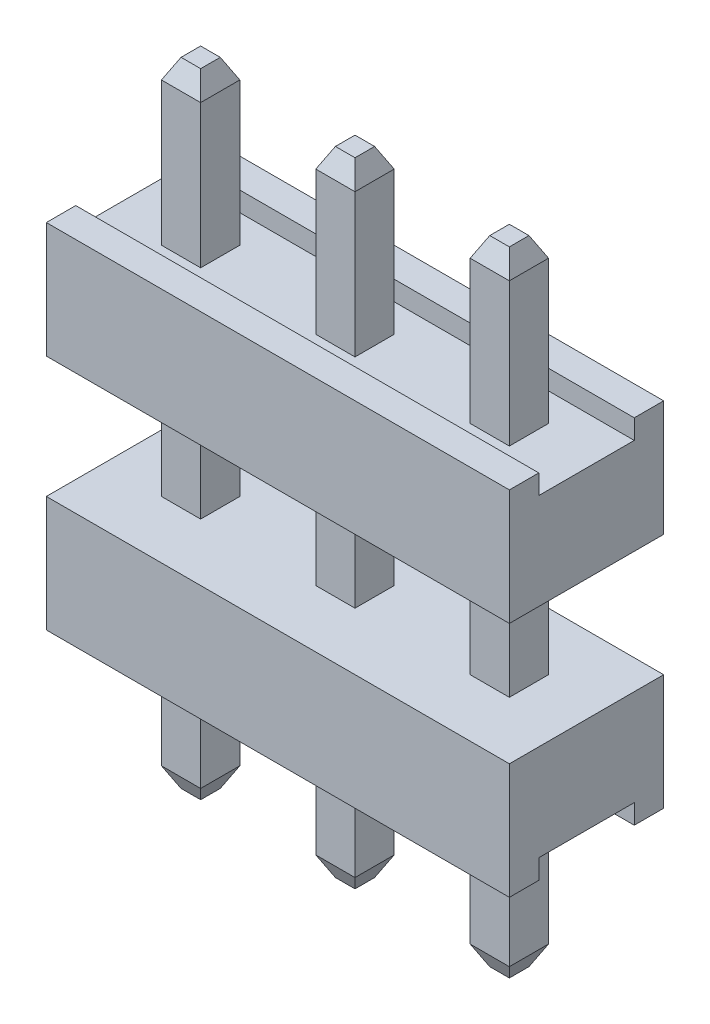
ISO-10303-21;
HEADER;
FILE_DESCRIPTION(('STEP AP214'),'2;1');
FILE_NAME('part.step','',(''),(''),'','','');
FILE_SCHEMA(('AUTOMOTIVE_DESIGN { 1 0 10303 214 1 1 1 1 }'));
ENDSEC;
DATA;
#1=APPLICATION_CONTEXT('core data for automotive mechanical design processes');
#2=APPLICATION_PROTOCOL_DEFINITION('international standard','automotive_design',2000,#1);
#3=PRODUCT_CONTEXT('',#1,'mechanical');
#4=PRODUCT('Part','Part','',(#3));
#5=PRODUCT_RELATED_PRODUCT_CATEGORY('part','',(#4));
#6=PRODUCT_DEFINITION_FORMATION('','',#4);
#7=PRODUCT_DEFINITION_CONTEXT('part definition',#1,'design');
#8=PRODUCT_DEFINITION('design','',#6,#7);
#9=PRODUCT_DEFINITION_SHAPE('','',#8);
#10=(LENGTH_UNIT() NAMED_UNIT(*) SI_UNIT(.MILLI.,.METRE.));
#11=(NAMED_UNIT(*) PLANE_ANGLE_UNIT() SI_UNIT($,.RADIAN.));
#12=(NAMED_UNIT(*) SI_UNIT($,.STERADIAN.) SOLID_ANGLE_UNIT());
#13=UNCERTAINTY_MEASURE_WITH_UNIT(LENGTH_MEASURE(1.E-05),#10,'distance_accuracy_value','');
#14=(GEOMETRIC_REPRESENTATION_CONTEXT(3) GLOBAL_UNCERTAINTY_ASSIGNED_CONTEXT((#13)) GLOBAL_UNIT_ASSIGNED_CONTEXT((#10,
#11,#12)) REPRESENTATION_CONTEXT('',''));
#15=CARTESIAN_POINT('',(0.,0.,0.));
#16=DIRECTION('',(0.,0.,1.));
#17=DIRECTION('',(1.,0.,0.));
#18=AXIS2_PLACEMENT_3D('',#15,#16,#17);
#19=CARTESIAN_POINT('',(-2.25399600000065,6.17220000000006,-0.254000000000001));
#20=DIRECTION('',(0.,0.447213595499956,-0.894427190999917));
#21=DIRECTION('',(0.,0.894427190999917,0.447213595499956));
#22=AXIS2_PLACEMENT_3D('',#19,#20,#21);
#23=PLANE('',#22);
#24=DIRECTION('',(0.40824829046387,-0.81649658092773,-0.408248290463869));
#25=VECTOR('',#24,1.);
#26=CARTESIAN_POINT('',(0.12699999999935,6.4261999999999,-0.127000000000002));
#27=LINE('',#26,#25);
#28=CARTESIAN_POINT('',(0.12699999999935,6.4261999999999,-0.127000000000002));
#29=VERTEX_POINT('',#28);
#30=CARTESIAN_POINT('',(0.253999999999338,6.1721999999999,-0.254000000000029));
#31=VERTEX_POINT('',#30);
#32=EDGE_CURVE('P0_E270',#29,#31,#27,.T.);
#33=ORIENTED_EDGE('',*,*,#32,.T.);
#34=DIRECTION('',(-1.,0.,0.));
#35=VECTOR('',#34,1.);
#36=CARTESIAN_POINT('',(-2.25399600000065,6.17220000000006,-0.254000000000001));
#37=LINE('',#36,#35);
#38=CARTESIAN_POINT('',(-0.25400000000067,6.1721999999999,-0.254000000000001));
#39=VERTEX_POINT('',#38);
#40=EDGE_CURVE('P0_E19',#39,#31,#37,.F.);
#41=ORIENTED_EDGE('',*,*,#40,.F.);
#42=DIRECTION('',(0.408248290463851,0.816496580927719,0.408248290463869));
#43=VECTOR('',#42,1.);
#44=CARTESIAN_POINT('',(-0.25400000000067,6.1721999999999,-0.254000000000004));
#45=LINE('',#44,#43);
#46=CARTESIAN_POINT('',(-0.127000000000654,6.4261999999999,-0.127000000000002));
#47=VERTEX_POINT('',#46);
#48=EDGE_CURVE('P0_E275',#39,#47,#45,.T.);
#49=ORIENTED_EDGE('',*,*,#48,.T.);
#50=DIRECTION('',(1.,0.,0.));
#51=VECTOR('',#50,1.);
#52=CARTESIAN_POINT('',(-2.25399600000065,6.4262,-0.126999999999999));
#53=LINE('',#52,#51);
#54=EDGE_CURVE('P0_E278',#29,#47,#53,.F.);
#55=ORIENTED_EDGE('',*,*,#54,.F.);
#56=EDGE_LOOP('',(#33,#41,#49,#55));
#57=FACE_BOUND('',#56,.T.);
#58=ADVANCED_FACE('P0_F16',(#57),#23,.T.);
#59=CARTESIAN_POINT('',(-1.87299600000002,-1.77800000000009,7.61999999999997));
#60=DIRECTION('',(-0.894427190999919,0.447213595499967,0.));
#61=DIRECTION('',(-0.447213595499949,-0.894427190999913,0.));
#62=AXIS2_PLACEMENT_3D('',#59,#60,#61);
#63=PLANE('',#62);
#64=DIRECTION('',(0.,0.,-1.));
#65=VECTOR('',#64,1.);
#66=CARTESIAN_POINT('',(-1.87299600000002,-1.77800000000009,0.126999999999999));
#67=LINE('',#66,#65);
#68=CARTESIAN_POINT('',(-1.87299600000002,-1.77800000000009,-0.127000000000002));
#69=VERTEX_POINT('',#68);
#70=CARTESIAN_POINT('',(-1.87299600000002,-1.77800000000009,0.126999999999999));
#71=VERTEX_POINT('',#70);
#72=EDGE_CURVE('P0_E296',#69,#71,#67,.F.);
#73=ORIENTED_EDGE('',*,*,#72,.F.);
#74=DIRECTION('',(-0.408248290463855,-0.816496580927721,0.408248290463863));
#75=VECTOR('',#74,1.);
#76=CARTESIAN_POINT('',(-1.745996,-1.52400000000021,-0.254000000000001));
#77=LINE('',#76,#75);
#78=CARTESIAN_POINT('',(-1.745996,-1.52400000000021,-0.254000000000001));
#79=VERTEX_POINT('',#78);
#80=EDGE_CURVE('P0_E354',#79,#69,#77,.T.);
#81=ORIENTED_EDGE('',*,*,#80,.F.);
#82=DIRECTION('',(0.,0.,1.));
#83=VECTOR('',#82,1.);
#84=CARTESIAN_POINT('',(-1.745996,-1.52400000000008,7.62));
#85=LINE('',#84,#83);
#86=CARTESIAN_POINT('',(-1.745996,-1.52400000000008,0.254000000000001));
#87=VERTEX_POINT('',#86);
#88=EDGE_CURVE('P0_E357',#79,#87,#85,.T.);
#89=ORIENTED_EDGE('',*,*,#88,.T.);
#90=DIRECTION('',(0.408248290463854,0.816496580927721,0.408248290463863));
#91=VECTOR('',#90,1.);
#92=CARTESIAN_POINT('',(-1.87299600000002,-1.77800000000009,0.127000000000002));
#93=LINE('',#92,#91);
#94=EDGE_CURVE('P0_E299',#71,#87,#93,.T.);
#95=ORIENTED_EDGE('',*,*,#94,.F.);
#96=EDGE_LOOP('',(#73,#81,#89,#95));
#97=FACE_BOUND('',#96,.T.);
#98=ADVANCED_FACE('P0_F906',(#97),#63,.F.);
#99=CARTESIAN_POINT('',(-1.74599600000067,6.1722,7.61999999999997));
#100=DIRECTION('',(-0.894427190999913,-0.447213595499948,0.));
#101=DIRECTION('',(0.447213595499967,-0.894427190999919,0.));
#102=AXIS2_PLACEMENT_3D('',#99,#100,#101);
#103=PLANE('',#102);
#104=DIRECTION('',(0.,0.,1.));
#105=VECTOR('',#104,1.);
#106=CARTESIAN_POINT('',(-1.87299600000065,6.4261999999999,-0.127000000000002));
#107=LINE('',#106,#105);
#108=CARTESIAN_POINT('',(-1.87299600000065,6.4261999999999,0.126999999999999));
#109=VERTEX_POINT('',#108);
#110=CARTESIAN_POINT('',(-1.87299600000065,6.4261999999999,-0.126999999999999));
#111=VERTEX_POINT('',#110);
#112=EDGE_CURVE('P0_E349',#109,#111,#107,.F.);
#113=ORIENTED_EDGE('',*,*,#112,.F.);
#114=DIRECTION('',(-0.40824829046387,0.816496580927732,-0.408248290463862));
#115=VECTOR('',#114,1.);
#116=CARTESIAN_POINT('',(-1.74599600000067,6.1721999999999,0.253999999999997));
#117=LINE('',#116,#115);
#118=CARTESIAN_POINT('',(-1.74599600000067,6.1721999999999,0.253999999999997));
#119=VERTEX_POINT('',#118);
#120=EDGE_CURVE('P0_E336',#119,#109,#117,.T.);
#121=ORIENTED_EDGE('',*,*,#120,.F.);
#122=DIRECTION('',(0.,0.,1.));
#123=VECTOR('',#122,1.);
#124=CARTESIAN_POINT('',(-1.74599600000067,6.1722,7.61999999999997));
#125=LINE('',#124,#123);
#126=CARTESIAN_POINT('',(-1.74599600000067,6.1722,-0.254000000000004));
#127=VERTEX_POINT('',#126);
#128=EDGE_CURVE('P0_E339',#119,#127,#125,.F.);
#129=ORIENTED_EDGE('',*,*,#128,.T.);
#130=DIRECTION('',(0.408248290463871,-0.816496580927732,-0.408248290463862));
#131=VECTOR('',#130,1.);
#132=CARTESIAN_POINT('',(-1.87299600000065,6.4261999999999,-0.127000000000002));
#133=LINE('',#132,#131);
#134=EDGE_CURVE('P0_E343',#111,#127,#133,.T.);
#135=ORIENTED_EDGE('',*,*,#134,.F.);
#136=EDGE_LOOP('',(#113,#121,#129,#135));
#137=FACE_BOUND('',#136,.T.);
#138=ADVANCED_FACE('P0_F771',(#137),#103,.F.);
#139=CARTESIAN_POINT('',(-2.25399600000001,0.9905999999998,-0.254000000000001));
#140=DIRECTION('',(0.,0.,-1.));
#141=DIRECTION('',(-1.,0.,0.));
#142=AXIS2_PLACEMENT_3D('',#139,#140,#141);
#143=PLANE('',#142);
#144=DIRECTION('',(0.,1.,0.));
#145=VECTOR('',#144,1.);
#146=CARTESIAN_POINT('',(0.254000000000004,0.990599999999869,-0.254000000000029));
#147=LINE('',#146,#145);
#148=CARTESIAN_POINT('',(0.254000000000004,0.990599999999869,-0.254000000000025));
#149=VERTEX_POINT('',#148);
#150=EDGE_CURVE('P0_E310',#31,#149,#147,.F.);
#151=ORIENTED_EDGE('',*,*,#150,.T.);
#152=DIRECTION('',(-1.,0.,0.));
#153=VECTOR('',#152,1.);
#154=CARTESIAN_POINT('',(-2.25399600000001,0.9905999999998,-0.254000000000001));
#155=LINE('',#154,#153);
#156=CARTESIAN_POINT('',(-0.254000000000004,0.990599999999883,-0.254000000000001));
#157=VERTEX_POINT('',#156);
#158=EDGE_CURVE('P0_E283',#149,#157,#155,.T.);
#159=ORIENTED_EDGE('',*,*,#158,.T.);
#160=DIRECTION('',(0.,1.,0.));
#161=VECTOR('',#160,1.);
#162=CARTESIAN_POINT('',(-0.25400000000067,6.1721999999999,-0.253999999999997));
#163=LINE('',#162,#161);
#164=EDGE_CURVE('P0_E312',#157,#39,#163,.T.);
#165=ORIENTED_EDGE('',*,*,#164,.T.);
#166=ORIENTED_EDGE('',*,*,#40,.T.);
#167=EDGE_LOOP('',(#151,#159,#165,#166));
#168=FACE_BOUND('',#167,.T.);
#169=ADVANCED_FACE('P0_F309',(#168),#143,.T.);
#170=CARTESIAN_POINT('',(-0.127000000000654,6.4262,7.62));
#171=DIRECTION('',(0.894427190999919,-0.447213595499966,0.));
#172=DIRECTION('',(0.447213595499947,0.894427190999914,0.));
#173=AXIS2_PLACEMENT_3D('',#170,#171,#172);
#174=PLANE('',#173);
#175=DIRECTION('',(0.,0.,-1.));
#176=VECTOR('',#175,1.);
#177=CARTESIAN_POINT('',(-0.25400000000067,6.1722,7.61999999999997));
#178=LINE('',#177,#176);
#179=CARTESIAN_POINT('',(-0.25400000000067,6.1721999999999,0.253999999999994));
#180=VERTEX_POINT('',#179);
#181=EDGE_CURVE('P0_E331',#39,#180,#178,.F.);
#182=ORIENTED_EDGE('',*,*,#181,.T.);
#183=DIRECTION('',(-0.408248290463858,-0.816496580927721,0.408248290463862));
#184=VECTOR('',#183,1.);
#185=CARTESIAN_POINT('',(-0.127000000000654,6.4261999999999,0.126999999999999));
#186=LINE('',#185,#184);
#187=CARTESIAN_POINT('',(-0.127000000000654,6.4261999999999,0.126999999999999));
#188=VERTEX_POINT('',#187);
#189=EDGE_CURVE('P0_E289',#188,#180,#186,.T.);
#190=ORIENTED_EDGE('',*,*,#189,.F.);
#191=DIRECTION('',(0.,0.,1.));
#192=VECTOR('',#191,1.);
#193=CARTESIAN_POINT('',(-0.127000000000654,6.4261999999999,-0.127000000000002));
#194=LINE('',#193,#192);
#195=EDGE_CURVE('P0_E286',#47,#188,#194,.T.);
#196=ORIENTED_EDGE('',*,*,#195,.F.);
#197=ORIENTED_EDGE('',*,*,#48,.F.);
#198=EDGE_LOOP('',(#182,#190,#196,#197));
#199=FACE_BOUND('',#198,.T.);
#200=ADVANCED_FACE('P0_F287',(#199),#174,.F.);
#201=CARTESIAN_POINT('',(0.253999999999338,6.1722,7.61999999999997));
#202=DIRECTION('',(-0.894427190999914,-0.447213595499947,0.));
#203=DIRECTION('',(0.447213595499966,-0.894427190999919,0.));
#204=AXIS2_PLACEMENT_3D('',#201,#202,#203);
#205=PLANE('',#204);
#206=DIRECTION('',(0.,0.,1.));
#207=VECTOR('',#206,1.);
#208=CARTESIAN_POINT('',(0.12699999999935,6.4261999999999,-0.127000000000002));
#209=LINE('',#208,#207);
#210=CARTESIAN_POINT('',(0.12699999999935,6.4261999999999,0.126999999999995));
#211=VERTEX_POINT('',#210);
#212=EDGE_CURVE('P0_E293',#211,#29,#209,.F.);
#213=ORIENTED_EDGE('',*,*,#212,.F.);
#214=DIRECTION('',(-0.40824829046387,0.816496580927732,-0.408248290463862));
#215=VECTOR('',#214,1.);
#216=CARTESIAN_POINT('',(0.253999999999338,6.1721999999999,0.253999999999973));
#217=LINE('',#216,#215);
#218=CARTESIAN_POINT('',(0.253999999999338,6.17219999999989,0.253999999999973));
#219=VERTEX_POINT('',#218);
#220=EDGE_CURVE('P0_E322',#219,#211,#217,.T.);
#221=ORIENTED_EDGE('',*,*,#220,.F.);
#222=DIRECTION('',(0.,0.,1.));
#223=VECTOR('',#222,1.);
#224=CARTESIAN_POINT('',(0.253999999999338,6.1722,7.61999999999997));
#225=LINE('',#224,#223);
#226=EDGE_CURVE('P0_E318',#219,#31,#225,.F.);
#227=ORIENTED_EDGE('',*,*,#226,.T.);
#228=ORIENTED_EDGE('',*,*,#32,.F.);
#229=EDGE_LOOP('',(#213,#221,#227,#228));
#230=FACE_BOUND('',#229,.T.);
#231=ADVANCED_FACE('P0_F415',(#230),#205,.F.);
#232=CARTESIAN_POINT('',(-2.25399600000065,6.4262,-0.127000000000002));
#233=DIRECTION('',(0.,1.,0.));
#234=DIRECTION('',(0.,0.,1.));
#235=AXIS2_PLACEMENT_3D('',#232,#233,#234);
#236=PLANE('',#235);
#237=ORIENTED_EDGE('',*,*,#212,.T.);
#238=ORIENTED_EDGE('',*,*,#54,.T.);
#239=ORIENTED_EDGE('',*,*,#195,.T.);
#240=DIRECTION('',(1.,0.,0.));
#241=VECTOR('',#240,1.);
#242=CARTESIAN_POINT('',(-2.25399600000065,6.4262,0.126999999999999));
#243=LINE('',#242,#241);
#244=EDGE_CURVE('P0_E408',#211,#188,#243,.F.);
#245=ORIENTED_EDGE('',*,*,#244,.F.);
#246=EDGE_LOOP('',(#237,#238,#239,#245));
#247=FACE_BOUND('',#246,.T.);
#248=ADVANCED_FACE('P0_F295',(#247),#236,.T.);
#249=CARTESIAN_POINT('',(0.126999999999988,-1.778,7.61999999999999));
#250=DIRECTION('',(-0.894427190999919,0.447213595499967,0.));
#251=DIRECTION('',(-0.447213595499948,-0.894427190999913,0.));
#252=AXIS2_PLACEMENT_3D('',#249,#250,#251);
#253=PLANE('',#252);
#254=DIRECTION('',(0.,0.,-1.));
#255=VECTOR('',#254,1.);
#256=CARTESIAN_POINT('',(0.126999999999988,-1.778,0.126999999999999));
#257=LINE('',#256,#255);
#258=CARTESIAN_POINT('',(0.126999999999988,-1.778,-0.126999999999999));
#259=VERTEX_POINT('',#258);
#260=CARTESIAN_POINT('',(0.126999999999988,-1.778,0.127000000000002));
#261=VERTEX_POINT('',#260);
#262=EDGE_CURVE('P0_E405',#259,#261,#257,.F.);
#263=ORIENTED_EDGE('',*,*,#262,.F.);
#264=DIRECTION('',(-0.408248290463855,-0.816496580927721,0.408248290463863));
#265=VECTOR('',#264,1.);
#266=CARTESIAN_POINT('',(0.254000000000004,-1.52400000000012,-0.254000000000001));
#267=LINE('',#266,#265);
#268=CARTESIAN_POINT('',(0.254000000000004,-1.52400000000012,-0.254000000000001));
#269=VERTEX_POINT('',#268);
#270=EDGE_CURVE('P0_E402',#269,#259,#267,.T.);
#271=ORIENTED_EDGE('',*,*,#270,.F.);
#272=DIRECTION('',(0.,0.,1.));
#273=VECTOR('',#272,1.);
#274=CARTESIAN_POINT('',(0.254000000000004,-1.524,7.61999999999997));
#275=LINE('',#274,#273);
#276=CARTESIAN_POINT('',(0.254000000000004,-1.524,0.254000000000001));
#277=VERTEX_POINT('',#276);
#278=EDGE_CURVE('P0_E395',#269,#277,#275,.T.);
#279=ORIENTED_EDGE('',*,*,#278,.T.);
#280=DIRECTION('',(0.408248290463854,0.816496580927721,0.408248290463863));
#281=VECTOR('',#280,1.);
#282=CARTESIAN_POINT('',(0.126999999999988,-1.778,0.126999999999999));
#283=LINE('',#282,#281);
#284=EDGE_CURVE('P0_E392',#261,#277,#283,.T.);
#285=ORIENTED_EDGE('',*,*,#284,.F.);
#286=EDGE_LOOP('',(#263,#271,#279,#285));
#287=FACE_BOUND('',#286,.T.);
#288=ADVANCED_FACE('P0_F423',(#287),#253,.F.);
#289=CARTESIAN_POINT('',(-2.25399600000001,-1.77800000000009,0.126999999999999));
#290=DIRECTION('',(0.,-1.,0.));
#291=DIRECTION('',(0.,0.,-1.));
#292=AXIS2_PLACEMENT_3D('',#289,#290,#291);
#293=PLANE('',#292);
#294=DIRECTION('',(0.,0.,1.));
#295=VECTOR('',#294,1.);
#296=CARTESIAN_POINT('',(-2.12699599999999,-1.77800000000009,7.61999999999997));
#297=LINE('',#296,#295);
#298=CARTESIAN_POINT('',(-2.12699599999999,-1.77800000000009,0.127000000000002));
#299=VERTEX_POINT('',#298);
#300=CARTESIAN_POINT('',(-2.12699599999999,-1.77800000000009,-0.127000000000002));
#301=VERTEX_POINT('',#300);
#302=EDGE_CURVE('P0_E380',#299,#301,#297,.F.);
#303=ORIENTED_EDGE('',*,*,#302,.T.);
#304=DIRECTION('',(1.,0.,0.));
#305=VECTOR('',#304,1.);
#306=CARTESIAN_POINT('',(-2.25399600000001,-1.77800000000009,-0.126999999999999));
#307=LINE('',#306,#305);
#308=EDGE_CURVE('P0_E351',#69,#301,#307,.F.);
#309=ORIENTED_EDGE('',*,*,#308,.F.);
#310=ORIENTED_EDGE('',*,*,#72,.T.);
#311=DIRECTION('',(1.,0.,0.));
#312=VECTOR('',#311,1.);
#313=CARTESIAN_POINT('',(-2.25399600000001,-1.77800000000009,0.127000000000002));
#314=LINE('',#313,#312);
#315=EDGE_CURVE('P0_E361',#299,#71,#314,.T.);
#316=ORIENTED_EDGE('',*,*,#315,.F.);
#317=EDGE_LOOP('',(#303,#309,#310,#316));
#318=FACE_BOUND('',#317,.T.);
#319=ADVANCED_FACE('P0_F609',(#318),#293,.T.);
#320=CARTESIAN_POINT('',(-2.25399600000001,-1.52400000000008,0.254000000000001));
#321=DIRECTION('',(0.,-0.447213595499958,0.894427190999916));
#322=DIRECTION('',(0.,-0.894427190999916,-0.447213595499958));
#323=AXIS2_PLACEMENT_3D('',#320,#321,#322);
#324=PLANE('',#323);
#325=DIRECTION('',(0.408248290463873,-0.816496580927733,-0.40824829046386));
#326=VECTOR('',#325,1.);
#327=CARTESIAN_POINT('',(-2.25399600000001,-1.52400000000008,0.254000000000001));
#328=LINE('',#327,#326);
#329=CARTESIAN_POINT('',(-2.25399600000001,-1.52400000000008,0.254000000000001));
#330=VERTEX_POINT('',#329);
#331=EDGE_CURVE('P0_E682',#330,#299,#328,.T.);
#332=ORIENTED_EDGE('',*,*,#331,.T.);
#333=ORIENTED_EDGE('',*,*,#315,.T.);
#334=ORIENTED_EDGE('',*,*,#94,.T.);
#335=DIRECTION('',(1.,0.,0.));
#336=VECTOR('',#335,1.);
#337=CARTESIAN_POINT('',(-2.25399600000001,-1.52400000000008,0.254000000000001));
#338=LINE('',#337,#336);
#339=EDGE_CURVE('P0_E368',#330,#87,#338,.T.);
#340=ORIENTED_EDGE('',*,*,#339,.F.);
#341=EDGE_LOOP('',(#332,#333,#334,#340));
#342=FACE_BOUND('',#341,.T.);
#343=ADVANCED_FACE('P0_F367',(#342),#324,.T.);
#344=CARTESIAN_POINT('',(-1.745996,-1.52400000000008,7.62));
#345=DIRECTION('',(-1.,0.,0.));
#346=DIRECTION('',(0.,0.,1.));
#347=AXIS2_PLACEMENT_3D('',#344,#345,#346);
#348=PLANE('',#347);
#349=ORIENTED_EDGE('',*,*,#88,.F.);
#350=DIRECTION('',(0.,1.,0.));
#351=VECTOR('',#350,1.);
#352=CARTESIAN_POINT('',(-1.745996,-1.52400000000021,-0.254000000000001));
#353=LINE('',#352,#351);
#354=CARTESIAN_POINT('',(-1.745996,0.761999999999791,-0.254000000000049));
#355=VERTEX_POINT('',#354);
#356=EDGE_CURVE('P0_E679',#355,#79,#353,.F.);
#357=ORIENTED_EDGE('',*,*,#356,.F.);
#358=DIRECTION('',(0.,0.,1.));
#359=VECTOR('',#358,1.);
#360=CARTESIAN_POINT('',(-1.745996,0.761999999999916,7.61999999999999));
#361=LINE('',#360,#359);
#362=CARTESIAN_POINT('',(-1.745996,0.761999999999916,0.253999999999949));
#363=VERTEX_POINT('',#362);
#364=EDGE_CURVE('P0_E359',#363,#355,#361,.F.);
#365=ORIENTED_EDGE('',*,*,#364,.F.);
#366=DIRECTION('',(0.,1.,0.));
#367=VECTOR('',#366,1.);
#368=CARTESIAN_POINT('',(-1.745996,0.761999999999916,0.253999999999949));
#369=LINE('',#368,#367);
#370=EDGE_CURVE('P0_E376',#87,#363,#369,.T.);
#371=ORIENTED_EDGE('',*,*,#370,.F.);
#372=EDGE_LOOP('',(#349,#357,#365,#371));
#373=FACE_BOUND('',#372,.T.);
#374=ADVANCED_FACE('P0_F602',(#373),#348,.F.);
#375=CARTESIAN_POINT('',(-2.25399600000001,-1.77800000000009,-0.126999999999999));
#376=DIRECTION('',(0.,-0.447213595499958,-0.894427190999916));
#377=DIRECTION('',(0.,0.894427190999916,-0.447213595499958));
#378=AXIS2_PLACEMENT_3D('',#375,#376,#377);
#379=PLANE('',#378);
#380=DIRECTION('',(-0.408248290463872,0.816496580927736,-0.40824829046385));
#381=VECTOR('',#380,1.);
#382=CARTESIAN_POINT('',(-2.12699599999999,-1.77800000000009,-0.127000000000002));
#383=LINE('',#382,#381);
#384=CARTESIAN_POINT('',(-2.25399600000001,-1.52400000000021,-0.253999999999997));
#385=VERTEX_POINT('',#384);
#386=EDGE_CURVE('P0_E383',#301,#385,#383,.T.);
#387=ORIENTED_EDGE('',*,*,#386,.T.);
#388=DIRECTION('',(-1.,0.,0.));
#389=VECTOR('',#388,1.);
#390=CARTESIAN_POINT('',(-2.25399600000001,-1.52400000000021,-0.254000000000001));
#391=LINE('',#390,#389);
#392=EDGE_CURVE('P0_E676',#79,#385,#391,.T.);
#393=ORIENTED_EDGE('',*,*,#392,.F.);
#394=ORIENTED_EDGE('',*,*,#80,.T.);
#395=ORIENTED_EDGE('',*,*,#308,.T.);
#396=EDGE_LOOP('',(#387,#393,#394,#395));
#397=FACE_BOUND('',#396,.T.);
#398=ADVANCED_FACE('P0_F598',(#397),#379,.T.);
#399=CARTESIAN_POINT('',(-2.25399600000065,6.4262,-0.127000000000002));
#400=DIRECTION('',(0.,1.,0.));
#401=DIRECTION('',(0.,0.,1.));
#402=AXIS2_PLACEMENT_3D('',#399,#400,#401);
#403=PLANE('',#402);
#404=ORIENTED_EDGE('',*,*,#112,.T.);
#405=DIRECTION('',(1.,0.,0.));
#406=VECTOR('',#405,1.);
#407=CARTESIAN_POINT('',(-2.25399600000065,6.4262,-0.127000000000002));
#408=LINE('',#407,#406);
#409=CARTESIAN_POINT('',(-2.12699600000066,6.4262,-0.126999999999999));
#410=VERTEX_POINT('',#409);
#411=EDGE_CURVE('P0_E346',#410,#111,#408,.T.);
#412=ORIENTED_EDGE('',*,*,#411,.F.);
#413=DIRECTION('',(0.,0.,1.));
#414=VECTOR('',#413,1.);
#415=CARTESIAN_POINT('',(-2.12699600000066,6.4262,7.62));
#416=LINE('',#415,#414);
#417=CARTESIAN_POINT('',(-2.12699600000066,6.4262,0.126999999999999));
#418=VERTEX_POINT('',#417);
#419=EDGE_CURVE('P0_E663',#410,#418,#416,.T.);
#420=ORIENTED_EDGE('',*,*,#419,.T.);
#421=DIRECTION('',(1.,0.,0.));
#422=VECTOR('',#421,1.);
#423=CARTESIAN_POINT('',(-2.25399600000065,6.4262,0.126999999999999));
#424=LINE('',#423,#422);
#425=EDGE_CURVE('P0_E333',#109,#418,#424,.F.);
#426=ORIENTED_EDGE('',*,*,#425,.F.);
#427=EDGE_LOOP('',(#404,#412,#420,#426));
#428=FACE_BOUND('',#427,.T.);
#429=ADVANCED_FACE('P0_F594',(#428),#403,.T.);
#430=CARTESIAN_POINT('',(-2.25399600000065,6.17220000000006,-0.254000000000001));
#431=DIRECTION('',(0.,0.447213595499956,-0.894427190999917));
#432=DIRECTION('',(0.,0.894427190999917,0.447213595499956));
#433=AXIS2_PLACEMENT_3D('',#430,#431,#432);
#434=PLANE('',#433);
#435=ORIENTED_EDGE('',*,*,#134,.T.);
#436=DIRECTION('',(-1.,0.,0.));
#437=VECTOR('',#436,1.);
#438=CARTESIAN_POINT('',(-2.25399600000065,6.17220000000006,-0.254000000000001));
#439=LINE('',#438,#437);
#440=CARTESIAN_POINT('',(-2.25399600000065,6.17220000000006,-0.254000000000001));
#441=VERTEX_POINT('',#440);
#442=EDGE_CURVE('P0_E665',#441,#127,#439,.F.);
#443=ORIENTED_EDGE('',*,*,#442,.F.);
#444=DIRECTION('',(0.408248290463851,0.816496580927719,0.408248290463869));
#445=VECTOR('',#444,1.);
#446=CARTESIAN_POINT('',(-2.25399600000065,6.17220000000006,-0.254000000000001));
#447=LINE('',#446,#445);
#448=EDGE_CURVE('P0_E658',#441,#410,#447,.T.);
#449=ORIENTED_EDGE('',*,*,#448,.T.);
#450=ORIENTED_EDGE('',*,*,#411,.T.);
#451=EDGE_LOOP('',(#435,#443,#449,#450));
#452=FACE_BOUND('',#451,.T.);
#453=ADVANCED_FACE('P0_F590',(#452),#434,.T.);
#454=CARTESIAN_POINT('',(-1.745996,0.990599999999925,7.61999999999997));
#455=DIRECTION('',(-1.,0.,0.));
#456=DIRECTION('',(0.,0.,1.));
#457=AXIS2_PLACEMENT_3D('',#454,#455,#456);
#458=PLANE('',#457);
#459=ORIENTED_EDGE('',*,*,#128,.F.);
#460=DIRECTION('',(0.,1.,0.));
#461=VECTOR('',#460,1.);
#462=CARTESIAN_POINT('',(-1.74599600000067,6.1721999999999,0.253999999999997));
#463=LINE('',#462,#461);
#464=CARTESIAN_POINT('',(-1.745996,0.990599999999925,0.253999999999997));
#465=VERTEX_POINT('',#464);
#466=EDGE_CURVE('P0_E655',#465,#119,#463,.T.);
#467=ORIENTED_EDGE('',*,*,#466,.F.);
#468=DIRECTION('',(0.,0.,1.));
#469=VECTOR('',#468,1.);
#470=CARTESIAN_POINT('',(-1.745996,0.990599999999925,7.61999999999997));
#471=LINE('',#470,#469);
#472=CARTESIAN_POINT('',(-1.745996,0.9905999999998,-0.254000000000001));
#473=VERTEX_POINT('',#472);
#474=EDGE_CURVE('P0_E341',#473,#465,#471,.T.);
#475=ORIENTED_EDGE('',*,*,#474,.F.);
#476=DIRECTION('',(0.,1.,0.));
#477=VECTOR('',#476,1.);
#478=CARTESIAN_POINT('',(-1.745996,0.9905999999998,-0.254000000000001));
#479=LINE('',#478,#477);
#480=EDGE_CURVE('P0_E670',#127,#473,#479,.F.);
#481=ORIENTED_EDGE('',*,*,#480,.F.);
#482=EDGE_LOOP('',(#459,#467,#475,#481));
#483=FACE_BOUND('',#482,.T.);
#484=ADVANCED_FACE('P0_F586',(#483),#458,.F.);
#485=CARTESIAN_POINT('',(-2.25399600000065,6.4262,0.126999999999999));
#486=DIRECTION('',(0.,0.447213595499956,0.894427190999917));
#487=DIRECTION('',(0.,-0.894427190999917,0.447213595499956));
#488=AXIS2_PLACEMENT_3D('',#485,#486,#487);
#489=PLANE('',#488);
#490=ORIENTED_EDGE('',*,*,#120,.T.);
#491=ORIENTED_EDGE('',*,*,#425,.T.);
#492=DIRECTION('',(-0.408248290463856,-0.816496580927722,0.40824829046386));
#493=VECTOR('',#492,1.);
#494=CARTESIAN_POINT('',(-2.12699600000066,6.4262,0.127000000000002));
#495=LINE('',#494,#493);
#496=CARTESIAN_POINT('',(-2.25399600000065,6.1721999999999,0.253999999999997));
#497=VERTEX_POINT('',#496);
#498=EDGE_CURVE('P0_E661',#418,#497,#495,.T.);
#499=ORIENTED_EDGE('',*,*,#498,.T.);
#500=DIRECTION('',(1.,0.,0.));
#501=VECTOR('',#500,1.);
#502=CARTESIAN_POINT('',(-2.25399600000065,6.1721999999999,0.253999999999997));
#503=LINE('',#502,#501);
#504=EDGE_CURVE('P0_E652',#119,#497,#503,.F.);
#505=ORIENTED_EDGE('',*,*,#504,.F.);
#506=EDGE_LOOP('',(#490,#491,#499,#505));
#507=FACE_BOUND('',#506,.T.);
#508=ADVANCED_FACE('P0_F582',(#507),#489,.T.);
#509=CARTESIAN_POINT('',(-0.25400000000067,6.1722,7.61999999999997));
#510=DIRECTION('',(1.,0.,0.));
#511=DIRECTION('',(0.,0.,-1.));
#512=AXIS2_PLACEMENT_3D('',#509,#510,#511);
#513=PLANE('',#512);
#514=DIRECTION('',(0.,0.,-1.));
#515=VECTOR('',#514,1.);
#516=CARTESIAN_POINT('',(-0.254000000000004,0.990599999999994,7.61999999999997));
#517=LINE('',#516,#515);
#518=CARTESIAN_POINT('',(-0.254000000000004,0.990599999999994,0.253999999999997));
#519=VERTEX_POINT('',#518);
#520=EDGE_CURVE('P0_E329',#519,#157,#517,.T.);
#521=ORIENTED_EDGE('',*,*,#520,.F.);
#522=DIRECTION('',(0.,1.,0.));
#523=VECTOR('',#522,1.);
#524=CARTESIAN_POINT('',(-0.25400000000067,6.1721999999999,0.253999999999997));
#525=LINE('',#524,#523);
#526=EDGE_CURVE('P0_E646',#180,#519,#525,.F.);
#527=ORIENTED_EDGE('',*,*,#526,.F.);
#528=ORIENTED_EDGE('',*,*,#181,.F.);
#529=ORIENTED_EDGE('',*,*,#164,.F.);
#530=EDGE_LOOP('',(#521,#527,#528,#529));
#531=FACE_BOUND('',#530,.T.);
#532=ADVANCED_FACE('P0_F579',(#531),#513,.F.);
#533=CARTESIAN_POINT('',(0.254000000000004,0.990599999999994,7.61999999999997));
#534=DIRECTION('',(-1.,0.,0.));
#535=DIRECTION('',(0.,0.,1.));
#536=AXIS2_PLACEMENT_3D('',#533,#534,#535);
#537=PLANE('',#536);
#538=ORIENTED_EDGE('',*,*,#226,.F.);
#539=DIRECTION('',(0.,1.,0.));
#540=VECTOR('',#539,1.);
#541=CARTESIAN_POINT('',(0.253999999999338,6.1721999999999,0.253999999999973));
#542=LINE('',#541,#540);
#543=CARTESIAN_POINT('',(0.254000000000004,0.990599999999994,0.253999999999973));
#544=VERTEX_POINT('',#543);
#545=EDGE_CURVE('P0_E644',#544,#219,#542,.T.);
#546=ORIENTED_EDGE('',*,*,#545,.F.);
#547=DIRECTION('',(0.,0.,1.));
#548=VECTOR('',#547,1.);
#549=CARTESIAN_POINT('',(0.254000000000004,0.990599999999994,7.61999999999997));
#550=LINE('',#549,#548);
#551=EDGE_CURVE('P0_E320',#149,#544,#550,.T.);
#552=ORIENTED_EDGE('',*,*,#551,.F.);
#553=ORIENTED_EDGE('',*,*,#150,.F.);
#554=EDGE_LOOP('',(#538,#546,#552,#553));
#555=FACE_BOUND('',#554,.T.);
#556=ADVANCED_FACE('P0_F316',(#555),#537,.F.);
#557=CARTESIAN_POINT('',(-2.25399600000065,6.4262,0.126999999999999));
#558=DIRECTION('',(0.,0.447213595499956,0.894427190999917));
#559=DIRECTION('',(0.,-0.894427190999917,0.447213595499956));
#560=AXIS2_PLACEMENT_3D('',#557,#558,#559);
#561=PLANE('',#560);
#562=ORIENTED_EDGE('',*,*,#220,.T.);
#563=ORIENTED_EDGE('',*,*,#244,.T.);
#564=ORIENTED_EDGE('',*,*,#189,.T.);
#565=DIRECTION('',(1.,0.,0.));
#566=VECTOR('',#565,1.);
#567=CARTESIAN_POINT('',(-2.25399600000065,6.1721999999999,0.253999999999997));
#568=LINE('',#567,#566);
#569=EDGE_CURVE('P0_E413',#219,#180,#568,.F.);
#570=ORIENTED_EDGE('',*,*,#569,.F.);
#571=EDGE_LOOP('',(#562,#563,#564,#570));
#572=FACE_BOUND('',#571,.T.);
#573=ADVANCED_FACE('P0_F411',(#572),#561,.T.);
#574=CARTESIAN_POINT('',(-2.25399600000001,-1.77800000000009,0.126999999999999));
#575=DIRECTION('',(0.,-1.,0.));
#576=DIRECTION('',(0.,0.,-1.));
#577=AXIS2_PLACEMENT_3D('',#574,#575,#576);
#578=PLANE('',#577);
#579=DIRECTION('',(0.,0.,1.));
#580=VECTOR('',#579,1.);
#581=CARTESIAN_POINT('',(-0.126999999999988,-1.778,7.61999999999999));
#582=LINE('',#581,#580);
#583=CARTESIAN_POINT('',(-0.127000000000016,-1.778,0.127000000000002));
#584=VERTEX_POINT('',#583);
#585=CARTESIAN_POINT('',(-0.126999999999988,-1.778,-0.126999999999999));
#586=VERTEX_POINT('',#585);
#587=EDGE_CURVE('P0_E620',#584,#586,#582,.F.);
#588=ORIENTED_EDGE('',*,*,#587,.T.);
#589=DIRECTION('',(1.,0.,0.));
#590=VECTOR('',#589,1.);
#591=CARTESIAN_POINT('',(-2.25399600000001,-1.77800000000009,-0.126999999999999));
#592=LINE('',#591,#590);
#593=EDGE_CURVE('P0_E399',#259,#586,#592,.F.);
#594=ORIENTED_EDGE('',*,*,#593,.F.);
#595=ORIENTED_EDGE('',*,*,#262,.T.);
#596=DIRECTION('',(1.,0.,0.));
#597=VECTOR('',#596,1.);
#598=CARTESIAN_POINT('',(-2.25399600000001,-1.77800000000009,0.127000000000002));
#599=LINE('',#598,#597);
#600=EDGE_CURVE('P0_E389',#584,#261,#599,.T.);
#601=ORIENTED_EDGE('',*,*,#600,.F.);
#602=EDGE_LOOP('',(#588,#594,#595,#601));
#603=FACE_BOUND('',#602,.T.);
#604=ADVANCED_FACE('P0_F570',(#603),#578,.T.);
#605=CARTESIAN_POINT('',(-2.25399600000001,-1.77800000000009,-0.126999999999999));
#606=DIRECTION('',(0.,-0.447213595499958,-0.894427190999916));
#607=DIRECTION('',(0.,0.894427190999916,-0.447213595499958));
#608=AXIS2_PLACEMENT_3D('',#605,#606,#607);
#609=PLANE('',#608);
#610=DIRECTION('',(-0.408248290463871,0.816496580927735,-0.408248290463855));
#611=VECTOR('',#610,1.);
#612=CARTESIAN_POINT('',(-0.127000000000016,-1.778,-0.127000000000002));
#613=LINE('',#612,#611);
#614=CARTESIAN_POINT('',(-0.254000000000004,-1.52400000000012,-0.253999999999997));
#615=VERTEX_POINT('',#614);
#616=EDGE_CURVE('P0_E626',#586,#615,#613,.T.);
#617=ORIENTED_EDGE('',*,*,#616,.T.);
#618=DIRECTION('',(-1.,0.,0.));
#619=VECTOR('',#618,1.);
#620=CARTESIAN_POINT('',(-2.25399600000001,-1.52400000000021,-0.254000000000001));
#621=LINE('',#620,#619);
#622=EDGE_CURVE('P0_E624',#269,#615,#621,.T.);
#623=ORIENTED_EDGE('',*,*,#622,.F.);
#624=ORIENTED_EDGE('',*,*,#270,.T.);
#625=ORIENTED_EDGE('',*,*,#593,.T.);
#626=EDGE_LOOP('',(#617,#623,#624,#625));
#627=FACE_BOUND('',#626,.T.);
#628=ADVANCED_FACE('P0_F566',(#627),#609,.T.);
#629=CARTESIAN_POINT('',(0.254000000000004,-1.524,7.61999999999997));
#630=DIRECTION('',(-1.,0.,0.));
#631=DIRECTION('',(0.,0.,1.));
#632=AXIS2_PLACEMENT_3D('',#629,#630,#631);
#633=PLANE('',#632);
#634=ORIENTED_EDGE('',*,*,#278,.F.);
#635=DIRECTION('',(0.,1.,0.));
#636=VECTOR('',#635,1.);
#637=CARTESIAN_POINT('',(0.254000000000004,-1.52400000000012,-0.254000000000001));
#638=LINE('',#637,#636);
#639=CARTESIAN_POINT('',(0.254000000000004,0.761999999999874,-0.254000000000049));
#640=VERTEX_POINT('',#639);
#641=EDGE_CURVE('P0_E631',#640,#269,#638,.F.);
#642=ORIENTED_EDGE('',*,*,#641,.F.);
#643=DIRECTION('',(0.,0.,1.));
#644=VECTOR('',#643,1.);
#645=CARTESIAN_POINT('',(0.254000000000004,0.761999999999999,7.61999999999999));
#646=LINE('',#645,#644);
#647=CARTESIAN_POINT('',(0.254000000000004,0.761999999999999,0.253999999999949));
#648=VERTEX_POINT('',#647);
#649=EDGE_CURVE('P0_E397',#648,#640,#646,.F.);
#650=ORIENTED_EDGE('',*,*,#649,.F.);
#651=DIRECTION('',(0.,1.,0.));
#652=VECTOR('',#651,1.);
#653=CARTESIAN_POINT('',(0.254000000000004,0.761999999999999,0.253999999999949));
#654=LINE('',#653,#652);
#655=EDGE_CURVE('P0_E714',#277,#648,#654,.T.);
#656=ORIENTED_EDGE('',*,*,#655,.F.);
#657=EDGE_LOOP('',(#634,#642,#650,#656));
#658=FACE_BOUND('',#657,.T.);
#659=ADVANCED_FACE('P0_F562',(#658),#633,.F.);
#660=CARTESIAN_POINT('',(-2.25399600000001,-1.52400000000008,0.254000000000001));
#661=DIRECTION('',(0.,-0.447213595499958,0.894427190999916));
#662=DIRECTION('',(0.,-0.894427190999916,-0.447213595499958));
#663=AXIS2_PLACEMENT_3D('',#660,#661,#662);
#664=PLANE('',#663);
#665=DIRECTION('',(0.408248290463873,-0.816496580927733,-0.408248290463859));
#666=VECTOR('',#665,1.);
#667=CARTESIAN_POINT('',(-0.254000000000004,-1.524,0.254000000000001));
#668=LINE('',#667,#666);
#669=CARTESIAN_POINT('',(-0.254000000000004,-1.524,0.254000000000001));
#670=VERTEX_POINT('',#669);
#671=EDGE_CURVE('P0_E635',#670,#584,#668,.T.);
#672=ORIENTED_EDGE('',*,*,#671,.T.);
#673=ORIENTED_EDGE('',*,*,#600,.T.);
#674=ORIENTED_EDGE('',*,*,#284,.T.);
#675=DIRECTION('',(1.,0.,0.));
#676=VECTOR('',#675,1.);
#677=CARTESIAN_POINT('',(-2.25399600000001,-1.52400000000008,0.254000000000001));
#678=LINE('',#677,#676);
#679=EDGE_CURVE('P0_E709',#670,#277,#678,.T.);
#680=ORIENTED_EDGE('',*,*,#679,.F.);
#681=EDGE_LOOP('',(#672,#673,#674,#680));
#682=FACE_BOUND('',#681,.T.);
#683=ADVANCED_FACE('P0_F559',(#682),#664,.T.);
#684=CARTESIAN_POINT('',(-2.25399600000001,0.761999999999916,0.25399999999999));
#685=DIRECTION('',(0.,0.,1.));
#686=DIRECTION('',(1.,0.,0.));
#687=AXIS2_PLACEMENT_3D('',#684,#685,#686);
#688=PLANE('',#687);
#689=DIRECTION('',(0.,1.,0.));
#690=VECTOR('',#689,1.);
#691=CARTESIAN_POINT('',(-2.25399600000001,0.,0.254000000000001));
#692=LINE('',#691,#690);
#693=CARTESIAN_POINT('',(-2.25399600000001,0.761999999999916,0.25399999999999));
#694=VERTEX_POINT('',#693);
#695=EDGE_CURVE('P0_E378',#694,#330,#692,.F.);
#696=ORIENTED_EDGE('',*,*,#695,.T.);
#697=ORIENTED_EDGE('',*,*,#339,.T.);
#698=ORIENTED_EDGE('',*,*,#370,.T.);
#699=DIRECTION('',(1.,0.,0.));
#700=VECTOR('',#699,1.);
#701=CARTESIAN_POINT('',(-2.25399600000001,0.761999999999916,0.25399999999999));
#702=LINE('',#701,#700);
#703=EDGE_CURVE('P0_E381',#363,#694,#702,.F.);
#704=ORIENTED_EDGE('',*,*,#703,.T.);
#705=EDGE_LOOP('',(#696,#697,#698,#704));
#706=FACE_BOUND('',#705,.T.);
#707=ADVANCED_FACE('P0_F373',(#706),#688,.T.);
#708=CARTESIAN_POINT('',(-2.25399600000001,-1.52400000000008,7.62));
#709=DIRECTION('',(0.894427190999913,0.447213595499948,0.));
#710=DIRECTION('',(-0.447213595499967,0.894427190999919,0.));
#711=AXIS2_PLACEMENT_3D('',#708,#709,#710);
#712=PLANE('',#711);
#713=DIRECTION('',(0.,0.,-1.));
#714=VECTOR('',#713,1.);
#715=CARTESIAN_POINT('',(-2.25399600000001,-1.52400000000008,0.));
#716=LINE('',#715,#714);
#717=EDGE_CURVE('P0_E689',#330,#385,#716,.T.);
#718=ORIENTED_EDGE('',*,*,#717,.T.);
#719=ORIENTED_EDGE('',*,*,#386,.F.);
#720=ORIENTED_EDGE('',*,*,#302,.F.);
#721=ORIENTED_EDGE('',*,*,#331,.F.);
#722=EDGE_LOOP('',(#718,#719,#720,#721));
#723=FACE_BOUND('',#722,.T.);
#724=ADVANCED_FACE('P0_F552',(#723),#712,.F.);
#725=CARTESIAN_POINT('',(-2.25399600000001,-1.52400000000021,-0.254000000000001));
#726=DIRECTION('',(0.,0.,-1.));
#727=DIRECTION('',(-1.,0.,0.));
#728=AXIS2_PLACEMENT_3D('',#725,#726,#727);
#729=PLANE('',#728);
#730=DIRECTION('',(0.,1.,0.));
#731=VECTOR('',#730,1.);
#732=CARTESIAN_POINT('',(-2.25399600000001,-2.08166817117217E-13,-0.253999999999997));
#733=LINE('',#732,#731);
#734=CARTESIAN_POINT('',(-2.25399600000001,0.761999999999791,-0.254000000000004));
#735=VERTEX_POINT('',#734);
#736=EDGE_CURVE('P0_E691',#385,#735,#733,.T.);
#737=ORIENTED_EDGE('',*,*,#736,.T.);
#738=DIRECTION('',(-1.,0.,0.));
#739=VECTOR('',#738,1.);
#740=CARTESIAN_POINT('',(-2.25399600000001,0.761999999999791,-0.254000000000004));
#741=LINE('',#740,#739);
#742=EDGE_CURVE('P0_E673',#735,#355,#741,.F.);
#743=ORIENTED_EDGE('',*,*,#742,.T.);
#744=ORIENTED_EDGE('',*,*,#356,.T.);
#745=ORIENTED_EDGE('',*,*,#392,.T.);
#746=EDGE_LOOP('',(#737,#743,#744,#745));
#747=FACE_BOUND('',#746,.T.);
#748=ADVANCED_FACE('P0_F548',(#747),#729,.T.);
#749=CARTESIAN_POINT('',(-2.25399600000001,0.9905999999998,-0.254000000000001));
#750=DIRECTION('',(0.,0.,-1.));
#751=DIRECTION('',(-1.,0.,0.));
#752=AXIS2_PLACEMENT_3D('',#749,#750,#751);
#753=PLANE('',#752);
#754=DIRECTION('',(0.,1.,0.));
#755=VECTOR('',#754,1.);
#756=CARTESIAN_POINT('',(-2.25399600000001,-2.08166817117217E-13,-0.254000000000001));
#757=LINE('',#756,#755);
#758=CARTESIAN_POINT('',(-2.25399600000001,0.9905999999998,-0.254000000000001));
#759=VERTEX_POINT('',#758);
#760=EDGE_CURVE('P0_E700',#759,#441,#757,.T.);
#761=ORIENTED_EDGE('',*,*,#760,.T.);
#762=ORIENTED_EDGE('',*,*,#442,.T.);
#763=ORIENTED_EDGE('',*,*,#480,.T.);
#764=DIRECTION('',(-1.,0.,0.));
#765=VECTOR('',#764,1.);
#766=CARTESIAN_POINT('',(-2.25399600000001,0.9905999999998,-0.254000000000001));
#767=LINE('',#766,#765);
#768=EDGE_CURVE('P0_E668',#473,#759,#767,.T.);
#769=ORIENTED_EDGE('',*,*,#768,.T.);
#770=EDGE_LOOP('',(#761,#762,#763,#769));
#771=FACE_BOUND('',#770,.T.);
#772=ADVANCED_FACE('P0_F544',(#771),#753,.T.);
#773=CARTESIAN_POINT('',(-2.12699600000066,6.4262,7.62));
#774=DIRECTION('',(0.894427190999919,-0.447213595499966,0.));
#775=DIRECTION('',(0.447213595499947,0.894427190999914,0.));
#776=AXIS2_PLACEMENT_3D('',#773,#774,#775);
#777=PLANE('',#776);
#778=DIRECTION('',(0.,0.,-1.));
#779=VECTOR('',#778,1.);
#780=CARTESIAN_POINT('',(-2.25399600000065,6.1722,0.));
#781=LINE('',#780,#779);
#782=EDGE_CURVE('P0_E756',#441,#497,#781,.F.);
#783=ORIENTED_EDGE('',*,*,#782,.T.);
#784=ORIENTED_EDGE('',*,*,#498,.F.);
#785=ORIENTED_EDGE('',*,*,#419,.F.);
#786=ORIENTED_EDGE('',*,*,#448,.F.);
#787=EDGE_LOOP('',(#783,#784,#785,#786));
#788=FACE_BOUND('',#787,.T.);
#789=ADVANCED_FACE('P0_F540',(#788),#777,.F.);
#790=CARTESIAN_POINT('',(-2.25399600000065,6.1721999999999,0.253999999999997));
#791=DIRECTION('',(0.,0.,1.));
#792=DIRECTION('',(1.,0.,0.));
#793=AXIS2_PLACEMENT_3D('',#790,#791,#792);
#794=PLANE('',#793);
#795=DIRECTION('',(0.,1.,0.));
#796=VECTOR('',#795,1.);
#797=CARTESIAN_POINT('',(-2.25399600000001,0.,0.254000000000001));
#798=LINE('',#797,#796);
#799=CARTESIAN_POINT('',(-2.25399600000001,0.990599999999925,0.253999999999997));
#800=VERTEX_POINT('',#799);
#801=EDGE_CURVE('P0_E753',#497,#800,#798,.F.);
#802=ORIENTED_EDGE('',*,*,#801,.T.);
#803=DIRECTION('',(1.,0.,0.));
#804=VECTOR('',#803,1.);
#805=CARTESIAN_POINT('',(-2.25399600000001,0.990599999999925,0.253999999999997));
#806=LINE('',#805,#804);
#807=EDGE_CURVE('P0_E649',#800,#465,#806,.T.);
#808=ORIENTED_EDGE('',*,*,#807,.T.);
#809=ORIENTED_EDGE('',*,*,#466,.T.);
#810=ORIENTED_EDGE('',*,*,#504,.T.);
#811=EDGE_LOOP('',(#802,#808,#809,#810));
#812=FACE_BOUND('',#811,.T.);
#813=ADVANCED_FACE('P0_F536',(#812),#794,.T.);
#814=CARTESIAN_POINT('',(-2.25399600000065,6.1721999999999,0.253999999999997));
#815=DIRECTION('',(0.,0.,1.));
#816=DIRECTION('',(1.,0.,0.));
#817=AXIS2_PLACEMENT_3D('',#814,#815,#816);
#818=PLANE('',#817);
#819=ORIENTED_EDGE('',*,*,#545,.T.);
#820=ORIENTED_EDGE('',*,*,#569,.T.);
#821=ORIENTED_EDGE('',*,*,#526,.T.);
#822=DIRECTION('',(1.,0.,0.));
#823=VECTOR('',#822,1.);
#824=CARTESIAN_POINT('',(-2.25399600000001,0.990599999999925,0.253999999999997));
#825=LINE('',#824,#823);
#826=EDGE_CURVE('P0_E724',#544,#519,#825,.F.);
#827=ORIENTED_EDGE('',*,*,#826,.F.);
#828=EDGE_LOOP('',(#819,#820,#821,#827));
#829=FACE_BOUND('',#828,.T.);
#830=ADVANCED_FACE('P0_F532',(#829),#818,.T.);
#831=CARTESIAN_POINT('',(-0.254000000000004,-1.524,7.62));
#832=DIRECTION('',(0.894427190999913,0.447213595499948,0.));
#833=DIRECTION('',(-0.447213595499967,0.894427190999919,0.));
#834=AXIS2_PLACEMENT_3D('',#831,#832,#833);
#835=PLANE('',#834);
#836=DIRECTION('',(0.,0.,-1.));
#837=VECTOR('',#836,1.);
#838=CARTESIAN_POINT('',(-0.254000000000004,-1.524,7.62));
#839=LINE('',#838,#837);
#840=EDGE_CURVE('P0_E722',#670,#615,#839,.T.);
#841=ORIENTED_EDGE('',*,*,#840,.T.);
#842=ORIENTED_EDGE('',*,*,#616,.F.);
#843=ORIENTED_EDGE('',*,*,#587,.F.);
#844=ORIENTED_EDGE('',*,*,#671,.F.);
#845=EDGE_LOOP('',(#841,#842,#843,#844));
#846=FACE_BOUND('',#845,.T.);
#847=ADVANCED_FACE('P0_F528',(#846),#835,.F.);
#848=CARTESIAN_POINT('',(-2.25399600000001,-1.52400000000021,-0.254000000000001));
#849=DIRECTION('',(0.,0.,-1.));
#850=DIRECTION('',(-1.,0.,0.));
#851=AXIS2_PLACEMENT_3D('',#848,#849,#850);
#852=PLANE('',#851);
#853=DIRECTION('',(0.,1.,0.));
#854=VECTOR('',#853,1.);
#855=CARTESIAN_POINT('',(-0.254000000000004,0.761999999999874,-0.254000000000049));
#856=LINE('',#855,#854);
#857=CARTESIAN_POINT('',(-0.254000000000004,0.761999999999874,-0.254000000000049));
#858=VERTEX_POINT('',#857);
#859=EDGE_CURVE('P0_E723',#615,#858,#856,.T.);
#860=ORIENTED_EDGE('',*,*,#859,.T.);
#861=DIRECTION('',(-1.,0.,0.));
#862=VECTOR('',#861,1.);
#863=CARTESIAN_POINT('',(-2.25399600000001,0.761999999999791,-0.254000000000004));
#864=LINE('',#863,#862);
#865=EDGE_CURVE('P0_E630',#858,#640,#864,.F.);
#866=ORIENTED_EDGE('',*,*,#865,.T.);
#867=ORIENTED_EDGE('',*,*,#641,.T.);
#868=ORIENTED_EDGE('',*,*,#622,.T.);
#869=EDGE_LOOP('',(#860,#866,#867,#868));
#870=FACE_BOUND('',#869,.T.);
#871=ADVANCED_FACE('P0_F524',(#870),#852,.T.);
#872=CARTESIAN_POINT('',(-2.25399600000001,0.761999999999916,0.25399999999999));
#873=DIRECTION('',(0.,0.,1.));
#874=DIRECTION('',(1.,0.,0.));
#875=AXIS2_PLACEMENT_3D('',#872,#873,#874);
#876=PLANE('',#875);
#877=DIRECTION('',(0.,1.,0.));
#878=VECTOR('',#877,1.);
#879=CARTESIAN_POINT('',(-0.254000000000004,0.761999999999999,0.253999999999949));
#880=LINE('',#879,#878);
#881=CARTESIAN_POINT('',(-0.254000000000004,0.761999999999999,0.253999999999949));
#882=VERTEX_POINT('',#881);
#883=EDGE_CURVE('P0_E726',#882,#670,#880,.F.);
#884=ORIENTED_EDGE('',*,*,#883,.T.);
#885=ORIENTED_EDGE('',*,*,#679,.T.);
#886=ORIENTED_EDGE('',*,*,#655,.T.);
#887=DIRECTION('',(1.,0.,0.));
#888=VECTOR('',#887,1.);
#889=CARTESIAN_POINT('',(-2.25399600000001,0.761999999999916,0.25399999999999));
#890=LINE('',#889,#888);
#891=EDGE_CURVE('P0_E712',#648,#882,#890,.F.);
#892=ORIENTED_EDGE('',*,*,#891,.T.);
#893=EDGE_LOOP('',(#884,#885,#886,#892));
#894=FACE_BOUND('',#893,.T.);
#895=ADVANCED_FACE('P0_F520',(#894),#876,.T.);
#896=CARTESIAN_POINT('',(-2.25399600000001,0.,0.));
#897=DIRECTION('',(1.,0.,0.));
#898=DIRECTION('',(0.,0.,-1.));
#899=AXIS2_PLACEMENT_3D('',#896,#897,#898);
#900=PLANE('',#899);
#901=ORIENTED_EDGE('',*,*,#801,.F.);
#902=ORIENTED_EDGE('',*,*,#782,.F.);
#903=ORIENTED_EDGE('',*,*,#760,.F.);
#904=DIRECTION('',(0.,0.,1.));
#905=VECTOR('',#904,1.);
#906=CARTESIAN_POINT('',(-2.25399600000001,0.990599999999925,0.253999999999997));
#907=LINE('',#906,#905);
#908=CARTESIAN_POINT('',(-2.25399600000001,0.9905999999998,-0.460502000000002));
#909=VERTEX_POINT('',#908);
#910=EDGE_CURVE('P0_E747',#909,#759,#907,.T.);
#911=ORIENTED_EDGE('',*,*,#910,.F.);
#912=DIRECTION('',(0.,1.,0.));
#913=VECTOR('',#912,1.);
#914=CARTESIAN_POINT('',(-2.25399600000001,0.761999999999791,-0.460502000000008));
#915=LINE('',#914,#913);
#916=CARTESIAN_POINT('',(-2.25399600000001,0.761999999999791,-0.460502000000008));
#917=VERTEX_POINT('',#916);
#918=EDGE_CURVE('P0_E779',#917,#909,#915,.T.);
#919=ORIENTED_EDGE('',*,*,#918,.F.);
#920=DIRECTION('',(0.,0.,-1.));
#921=VECTOR('',#920,1.);
#922=CARTESIAN_POINT('',(-2.25399600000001,0.761999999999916,0.));
#923=LINE('',#922,#921);
#924=EDGE_CURVE('P0_E698',#735,#917,#923,.T.);
#925=ORIENTED_EDGE('',*,*,#924,.F.);
#926=ORIENTED_EDGE('',*,*,#736,.F.);
#927=ORIENTED_EDGE('',*,*,#717,.F.);
#928=ORIENTED_EDGE('',*,*,#695,.F.);
#929=DIRECTION('',(0.,0.,-1.));
#930=VECTOR('',#929,1.);
#931=CARTESIAN_POINT('',(-2.25399600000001,0.761999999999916,0.));
#932=LINE('',#931,#930);
#933=CARTESIAN_POINT('',(-2.25399600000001,0.761999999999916,0.460501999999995));
#934=VERTEX_POINT('',#933);
#935=EDGE_CURVE('P0_E705',#934,#694,#932,.T.);
#936=ORIENTED_EDGE('',*,*,#935,.F.);
#937=DIRECTION('',(0.,1.,0.));
#938=VECTOR('',#937,1.);
#939=CARTESIAN_POINT('',(-2.25399600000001,0.,0.460502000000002));
#940=LINE('',#939,#938);
#941=CARTESIAN_POINT('',(-2.25399600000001,0.990599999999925,0.460501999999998));
#942=VERTEX_POINT('',#941);
#943=EDGE_CURVE('P0_E707',#942,#934,#940,.F.);
#944=ORIENTED_EDGE('',*,*,#943,.F.);
#945=DIRECTION('',(0.,0.,1.));
#946=VECTOR('',#945,1.);
#947=CARTESIAN_POINT('',(-2.25399600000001,0.990599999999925,0.253999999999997));
#948=LINE('',#947,#946);
#949=EDGE_CURVE('P0_E744',#800,#942,#948,.T.);
#950=ORIENTED_EDGE('',*,*,#949,.F.);
#951=EDGE_LOOP('',(#901,#902,#903,#911,#919,#925,#926,#927,#928,#936,#944,#950));
#952=FACE_BOUND('',#951,.T.);
#953=ADVANCED_FACE('P0_F516',(#952),#900,.F.);
#954=CARTESIAN_POINT('',(-2.25399600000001,0.990599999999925,0.253999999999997));
#955=DIRECTION('',(0.,1.,0.));
#956=DIRECTION('',(0.,0.,1.));
#957=AXIS2_PLACEMENT_3D('',#954,#955,#956);
#958=PLANE('',#957);
#959=ORIENTED_EDGE('',*,*,#551,.T.);
#960=ORIENTED_EDGE('',*,*,#826,.T.);
#961=ORIENTED_EDGE('',*,*,#520,.T.);
#962=ORIENTED_EDGE('',*,*,#158,.F.);
#963=EDGE_LOOP('',(#959,#960,#961,#962));
#964=FACE_BOUND('',#963,.T.);
#965=DIRECTION('',(0.,0.,1.));
#966=VECTOR('',#965,1.);
#967=CARTESIAN_POINT('',(1.745996,0.990599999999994,0.253999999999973));
#968=LINE('',#967,#966);
#969=CARTESIAN_POINT('',(1.745996,0.990599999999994,0.253999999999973));
#970=VERTEX_POINT('',#969);
#971=CARTESIAN_POINT('',(1.745996,0.990599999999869,-0.254000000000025));
#972=VERTEX_POINT('',#971);
#973=EDGE_CURVE('P0_E735',#970,#972,#968,.F.);
#974=ORIENTED_EDGE('',*,*,#973,.T.);
#975=DIRECTION('',(1.,0.,0.));
#976=VECTOR('',#975,1.);
#977=CARTESIAN_POINT('',(-2.25399600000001,0.9905999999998,-0.253999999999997));
#978=LINE('',#977,#976);
#979=CARTESIAN_POINT('',(2.25399600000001,0.990599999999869,-0.254000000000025));
#980=VERTEX_POINT('',#979);
#981=EDGE_CURVE('P0_E729',#972,#980,#978,.T.);
#982=ORIENTED_EDGE('',*,*,#981,.T.);
#983=DIRECTION('',(0.,0.,1.));
#984=VECTOR('',#983,1.);
#985=CARTESIAN_POINT('',(2.25399600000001,0.990599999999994,0.253999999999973));
#986=LINE('',#985,#984);
#987=CARTESIAN_POINT('',(2.25399600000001,0.990599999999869,-0.460502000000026));
#988=VERTEX_POINT('',#987);
#989=EDGE_CURVE('P0_E750',#980,#988,#986,.F.);
#990=ORIENTED_EDGE('',*,*,#989,.T.);
#991=DIRECTION('',(-1.,0.,0.));
#992=VECTOR('',#991,1.);
#993=CARTESIAN_POINT('',(-2.25399600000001,0.9905999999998,-0.460502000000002));
#994=LINE('',#993,#992);
#995=EDGE_CURVE('P0_E777',#909,#988,#994,.F.);
#996=ORIENTED_EDGE('',*,*,#995,.F.);
#997=ORIENTED_EDGE('',*,*,#910,.T.);
#998=ORIENTED_EDGE('',*,*,#768,.F.);
#999=ORIENTED_EDGE('',*,*,#474,.T.);
#1000=ORIENTED_EDGE('',*,*,#807,.F.);
#1001=ORIENTED_EDGE('',*,*,#949,.T.);
#1002=DIRECTION('',(1.,0.,0.));
#1003=VECTOR('',#1002,1.);
#1004=CARTESIAN_POINT('',(-2.25399600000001,0.990599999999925,0.460501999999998));
#1005=LINE('',#1004,#1003);
#1006=CARTESIAN_POINT('',(2.25399600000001,0.990599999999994,0.460501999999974));
#1007=VERTEX_POINT('',#1006);
#1008=EDGE_CURVE('P0_E792',#1007,#942,#1005,.F.);
#1009=ORIENTED_EDGE('',*,*,#1008,.F.);
#1010=DIRECTION('',(0.,0.,1.));
#1011=VECTOR('',#1010,1.);
#1012=CARTESIAN_POINT('',(2.25399600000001,0.990599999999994,0.253999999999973));
#1013=LINE('',#1012,#1011);
#1014=CARTESIAN_POINT('',(2.25399600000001,0.990599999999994,0.253999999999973));
#1015=VERTEX_POINT('',#1014);
#1016=EDGE_CURVE('P0_E741',#1007,#1015,#1013,.F.);
#1017=ORIENTED_EDGE('',*,*,#1016,.T.);
#1018=DIRECTION('',(1.,0.,0.));
#1019=VECTOR('',#1018,1.);
#1020=CARTESIAN_POINT('',(-2.25399600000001,0.990599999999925,0.253999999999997));
#1021=LINE('',#1020,#1019);
#1022=EDGE_CURVE('P0_E738',#1015,#970,#1021,.F.);
#1023=ORIENTED_EDGE('',*,*,#1022,.T.);
#1024=EDGE_LOOP('',(#974,#982,#990,#996,#997,#998,#999,#1000,#1001,#1009,#1017,#1023));
#1025=FACE_BOUND('',#1024,.T.);
#1026=ADVANCED_FACE('P0_F512',(#964,#1025),#958,.T.);
#1027=CARTESIAN_POINT('',(-0.254000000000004,0.761999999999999,7.61999999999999));
#1028=DIRECTION('',(1.,0.,0.));
#1029=DIRECTION('',(0.,0.,-1.));
#1030=AXIS2_PLACEMENT_3D('',#1027,#1028,#1029);
#1031=PLANE('',#1030);
#1032=DIRECTION('',(0.,0.,-1.));
#1033=VECTOR('',#1032,1.);
#1034=CARTESIAN_POINT('',(-0.254000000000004,0.761999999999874,-0.254000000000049));
#1035=LINE('',#1034,#1033);
#1036=EDGE_CURVE('P0_E787',#858,#882,#1035,.F.);
#1037=ORIENTED_EDGE('',*,*,#1036,.F.);
#1038=ORIENTED_EDGE('',*,*,#859,.F.);
#1039=ORIENTED_EDGE('',*,*,#840,.F.);
#1040=ORIENTED_EDGE('',*,*,#883,.F.);
#1041=EDGE_LOOP('',(#1037,#1038,#1039,#1040));
#1042=FACE_BOUND('',#1041,.T.);
#1043=ADVANCED_FACE('P0_F508',(#1042),#1031,.F.);
#1044=CARTESIAN_POINT('',(-2.25399600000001,0.761999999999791,-0.460502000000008));
#1045=DIRECTION('',(0.,0.,-1.));
#1046=DIRECTION('',(-1.,0.,0.));
#1047=AXIS2_PLACEMENT_3D('',#1044,#1045,#1046);
#1048=PLANE('',#1047);
#1049=ORIENTED_EDGE('',*,*,#918,.T.);
#1050=ORIENTED_EDGE('',*,*,#995,.T.);
#1051=DIRECTION('',(0.,1.,0.));
#1052=VECTOR('',#1051,1.);
#1053=CARTESIAN_POINT('',(2.25399600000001,0.761999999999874,-0.46050200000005));
#1054=LINE('',#1053,#1052);
#1055=CARTESIAN_POINT('',(2.25399600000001,0.761999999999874,-0.46050200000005));
#1056=VERTEX_POINT('',#1055);
#1057=EDGE_CURVE('P0_E781',#988,#1056,#1054,.F.);
#1058=ORIENTED_EDGE('',*,*,#1057,.T.);
#1059=DIRECTION('',(1.,0.,0.));
#1060=VECTOR('',#1059,1.);
#1061=CARTESIAN_POINT('',(-2.25399600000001,0.761999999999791,-0.460502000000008));
#1062=LINE('',#1061,#1060);
#1063=EDGE_CURVE('P0_E784',#917,#1056,#1062,.T.);
#1064=ORIENTED_EDGE('',*,*,#1063,.F.);
#1065=EDGE_LOOP('',(#1049,#1050,#1058,#1064));
#1066=FACE_BOUND('',#1065,.T.);
#1067=ADVANCED_FACE('P0_F504',(#1066),#1048,.T.);
#1068=CARTESIAN_POINT('',(-2.25399600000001,0.990599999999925,0.460501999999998));
#1069=DIRECTION('',(0.,0.,1.));
#1070=DIRECTION('',(1.,0.,0.));
#1071=AXIS2_PLACEMENT_3D('',#1068,#1069,#1070);
#1072=PLANE('',#1071);
#1073=ORIENTED_EDGE('',*,*,#943,.T.);
#1074=DIRECTION('',(1.,0.,0.));
#1075=VECTOR('',#1074,1.);
#1076=CARTESIAN_POINT('',(-2.25399600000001,0.761999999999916,0.460501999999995));
#1077=LINE('',#1076,#1075);
#1078=CARTESIAN_POINT('',(2.25399600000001,0.761999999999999,0.460501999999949));
#1079=VERTEX_POINT('',#1078);
#1080=EDGE_CURVE('P0_E807',#1079,#934,#1077,.F.);
#1081=ORIENTED_EDGE('',*,*,#1080,.F.);
#1082=DIRECTION('',(0.,1.,0.));
#1083=VECTOR('',#1082,1.);
#1084=CARTESIAN_POINT('',(2.25399600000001,0.990599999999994,0.460501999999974));
#1085=LINE('',#1084,#1083);
#1086=EDGE_CURVE('P0_E798',#1079,#1007,#1085,.T.);
#1087=ORIENTED_EDGE('',*,*,#1086,.T.);
#1088=ORIENTED_EDGE('',*,*,#1008,.T.);
#1089=EDGE_LOOP('',(#1073,#1081,#1087,#1088));
#1090=FACE_BOUND('',#1089,.T.);
#1091=ADVANCED_FACE('P0_F500',(#1090),#1072,.T.);
#1092=CARTESIAN_POINT('',(1.87299599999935,6.4262,7.62));
#1093=DIRECTION('',(0.89442719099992,-0.447213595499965,0.));
#1094=DIRECTION('',(0.447213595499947,0.894427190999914,0.));
#1095=AXIS2_PLACEMENT_3D('',#1092,#1093,#1094);
#1096=PLANE('',#1095);
#1097=DIRECTION('',(0.,0.,-1.));
#1098=VECTOR('',#1097,1.);
#1099=CARTESIAN_POINT('',(1.74599599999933,6.1722,7.61999999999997));
#1100=LINE('',#1099,#1098);
#1101=CARTESIAN_POINT('',(1.74599599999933,6.17220000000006,-0.254000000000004));
#1102=VERTEX_POINT('',#1101);
#1103=CARTESIAN_POINT('',(1.74599599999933,6.17219999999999,0.253999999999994));
#1104=VERTEX_POINT('',#1103);
#1105=EDGE_CURVE('P0_E864',#1102,#1104,#1100,.F.);
#1106=ORIENTED_EDGE('',*,*,#1105,.T.);
#1107=DIRECTION('',(-0.408248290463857,-0.816496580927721,0.408248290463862));
#1108=VECTOR('',#1107,1.);
#1109=CARTESIAN_POINT('',(1.87299599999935,6.42620000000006,0.126999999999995));
#1110=LINE('',#1109,#1108);
#1111=CARTESIAN_POINT('',(1.87299599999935,6.42620000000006,0.126999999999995));
#1112=VERTEX_POINT('',#1111);
#1113=EDGE_CURVE('P0_E862',#1112,#1104,#1110,.T.);
#1114=ORIENTED_EDGE('',*,*,#1113,.F.);
#1115=DIRECTION('',(0.,0.,1.));
#1116=VECTOR('',#1115,1.);
#1117=CARTESIAN_POINT('',(1.87299599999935,6.42620000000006,-0.127000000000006));
#1118=LINE('',#1117,#1116);
#1119=CARTESIAN_POINT('',(1.87299599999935,6.42620000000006,-0.127000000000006));
#1120=VERTEX_POINT('',#1119);
#1121=EDGE_CURVE('P0_E872',#1120,#1112,#1118,.T.);
#1122=ORIENTED_EDGE('',*,*,#1121,.F.);
#1123=DIRECTION('',(0.408248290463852,0.816496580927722,0.408248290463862));
#1124=VECTOR('',#1123,1.);
#1125=CARTESIAN_POINT('',(1.74599599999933,6.17220000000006,-0.254000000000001));
#1126=LINE('',#1125,#1124);
#1127=EDGE_CURVE('P0_E869',#1102,#1120,#1126,.T.);
#1128=ORIENTED_EDGE('',*,*,#1127,.F.);
#1129=EDGE_LOOP('',(#1106,#1114,#1122,#1128));
#1130=FACE_BOUND('',#1129,.T.);
#1131=ADVANCED_FACE('P0_F496',(#1130),#1096,.F.);
#1132=CARTESIAN_POINT('',(-2.25399600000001,0.761999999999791,-0.254000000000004));
#1133=DIRECTION('',(0.,-1.,0.));
#1134=DIRECTION('',(0.,0.,-1.));
#1135=AXIS2_PLACEMENT_3D('',#1132,#1133,#1134);
#1136=PLANE('',#1135);
#1137=ORIENTED_EDGE('',*,*,#742,.F.);
#1138=ORIENTED_EDGE('',*,*,#924,.T.);
#1139=ORIENTED_EDGE('',*,*,#1063,.T.);
#1140=DIRECTION('',(0.,0.,-1.));
#1141=VECTOR('',#1140,1.);
#1142=CARTESIAN_POINT('',(2.25399600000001,0.761999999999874,-0.254000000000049));
#1143=LINE('',#1142,#1141);
#1144=CARTESIAN_POINT('',(2.25399600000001,0.761999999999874,-0.254000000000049));
#1145=VERTEX_POINT('',#1144);
#1146=EDGE_CURVE('P0_E786',#1056,#1145,#1143,.F.);
#1147=ORIENTED_EDGE('',*,*,#1146,.T.);
#1148=DIRECTION('',(1.,0.,0.));
#1149=VECTOR('',#1148,1.);
#1150=CARTESIAN_POINT('',(-2.25399600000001,0.761999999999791,-0.254000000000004));
#1151=LINE('',#1150,#1149);
#1152=CARTESIAN_POINT('',(1.745996,0.761999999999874,-0.254000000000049));
#1153=VERTEX_POINT('',#1152);
#1154=EDGE_CURVE('P0_E789',#1145,#1153,#1151,.F.);
#1155=ORIENTED_EDGE('',*,*,#1154,.T.);
#1156=DIRECTION('',(0.,0.,-1.));
#1157=VECTOR('',#1156,1.);
#1158=CARTESIAN_POINT('',(1.745996,0.761999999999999,7.61999999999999));
#1159=LINE('',#1158,#1157);
#1160=CARTESIAN_POINT('',(1.745996,0.761999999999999,0.253999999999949));
#1161=VERTEX_POINT('',#1160);
#1162=EDGE_CURVE('P0_E846',#1153,#1161,#1159,.F.);
#1163=ORIENTED_EDGE('',*,*,#1162,.T.);
#1164=DIRECTION('',(1.,0.,0.));
#1165=VECTOR('',#1164,1.);
#1166=CARTESIAN_POINT('',(-2.25399600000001,0.761999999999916,0.25399999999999));
#1167=LINE('',#1166,#1165);
#1168=CARTESIAN_POINT('',(2.25399600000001,0.761999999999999,0.253999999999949));
#1169=VERTEX_POINT('',#1168);
#1170=EDGE_CURVE('P0_E877',#1161,#1169,#1167,.T.);
#1171=ORIENTED_EDGE('',*,*,#1170,.T.);
#1172=DIRECTION('',(0.,0.,-1.));
#1173=VECTOR('',#1172,1.);
#1174=CARTESIAN_POINT('',(2.25399600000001,0.761999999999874,-0.254000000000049));
#1175=LINE('',#1174,#1173);
#1176=EDGE_CURVE('P0_E810',#1169,#1079,#1175,.F.);
#1177=ORIENTED_EDGE('',*,*,#1176,.T.);
#1178=ORIENTED_EDGE('',*,*,#1080,.T.);
#1179=ORIENTED_EDGE('',*,*,#935,.T.);
#1180=ORIENTED_EDGE('',*,*,#703,.F.);
#1181=ORIENTED_EDGE('',*,*,#364,.T.);
#1182=EDGE_LOOP('',(#1137,#1138,#1139,#1147,#1155,#1163,#1171,#1177,#1178,#1179,#1180,#1181));
#1183=FACE_BOUND('',#1182,.T.);
#1184=ORIENTED_EDGE('',*,*,#865,.F.);
#1185=ORIENTED_EDGE('',*,*,#1036,.T.);
#1186=ORIENTED_EDGE('',*,*,#891,.F.);
#1187=ORIENTED_EDGE('',*,*,#649,.T.);
#1188=EDGE_LOOP('',(#1184,#1185,#1186,#1187));
#1189=FACE_BOUND('',#1188,.T.);
#1190=ADVANCED_FACE('P0_F492',(#1183,#1189),#1136,.T.);
#1191=CARTESIAN_POINT('',(1.745996,-1.524,7.61999999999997));
#1192=DIRECTION('',(0.894427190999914,0.447213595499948,0.));
#1193=DIRECTION('',(-0.447213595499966,0.894427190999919,0.));
#1194=AXIS2_PLACEMENT_3D('',#1191,#1192,#1193);
#1195=PLANE('',#1194);
#1196=DIRECTION('',(0.,0.,-1.));
#1197=VECTOR('',#1196,1.);
#1198=CARTESIAN_POINT('',(1.745996,-1.524,7.61999999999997));
#1199=LINE('',#1198,#1197);
#1200=CARTESIAN_POINT('',(1.745996,-1.524,0.254000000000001));
#1201=VERTEX_POINT('',#1200);
#1202=CARTESIAN_POINT('',(1.745996,-1.52400000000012,-0.253999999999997));
#1203=VERTEX_POINT('',#1202);
#1204=EDGE_CURVE('P0_E849',#1201,#1203,#1199,.T.);
#1205=ORIENTED_EDGE('',*,*,#1204,.T.);
#1206=DIRECTION('',(-0.40824829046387,0.816496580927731,-0.408248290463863));
#1207=VECTOR('',#1206,1.);
#1208=CARTESIAN_POINT('',(1.87299599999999,-1.778,-0.127000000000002));
#1209=LINE('',#1208,#1207);
#1210=CARTESIAN_POINT('',(1.87299599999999,-1.778,-0.127000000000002));
#1211=VERTEX_POINT('',#1210);
#1212=EDGE_CURVE('P0_E841',#1211,#1203,#1209,.T.);
#1213=ORIENTED_EDGE('',*,*,#1212,.F.);
#1214=DIRECTION('',(0.,0.,-1.));
#1215=VECTOR('',#1214,1.);
#1216=CARTESIAN_POINT('',(1.87299599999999,-1.778,0.126999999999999));
#1217=LINE('',#1216,#1215);
#1218=CARTESIAN_POINT('',(1.87299599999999,-1.778,0.126999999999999));
#1219=VERTEX_POINT('',#1218);
#1220=EDGE_CURVE('P0_E857',#1219,#1211,#1217,.T.);
#1221=ORIENTED_EDGE('',*,*,#1220,.F.);
#1222=DIRECTION('',(0.408248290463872,-0.816496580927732,-0.408248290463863));
#1223=VECTOR('',#1222,1.);
#1224=CARTESIAN_POINT('',(1.745996,-1.524,0.254000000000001));
#1225=LINE('',#1224,#1223);
#1226=EDGE_CURVE('P0_E854',#1201,#1219,#1225,.T.);
#1227=ORIENTED_EDGE('',*,*,#1226,.F.);
#1228=EDGE_LOOP('',(#1205,#1213,#1221,#1227));
#1229=FACE_BOUND('',#1228,.T.);
#1230=ADVANCED_FACE('P0_F488',(#1229),#1195,.F.);
#1231=CARTESIAN_POINT('',(-2.25399600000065,6.4262,-0.127000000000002));
#1232=DIRECTION('',(0.,1.,0.));
#1233=DIRECTION('',(0.,0.,1.));
#1234=AXIS2_PLACEMENT_3D('',#1231,#1232,#1233);
#1235=PLANE('',#1234);
#1236=DIRECTION('',(0.,0.,1.));
#1237=VECTOR('',#1236,1.);
#1238=CARTESIAN_POINT('',(2.12699599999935,6.4262,7.62));
#1239=LINE('',#1238,#1237);
#1240=CARTESIAN_POINT('',(2.12699599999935,6.42619999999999,0.126999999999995));
#1241=VERTEX_POINT('',#1240);
#1242=CARTESIAN_POINT('',(2.12699599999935,6.42619999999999,-0.127000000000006));
#1243=VERTEX_POINT('',#1242);
#1244=EDGE_CURVE('P0_E827',#1241,#1243,#1239,.F.);
#1245=ORIENTED_EDGE('',*,*,#1244,.T.);
#1246=DIRECTION('',(1.,0.,0.));
#1247=VECTOR('',#1246,1.);
#1248=CARTESIAN_POINT('',(-2.25399600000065,6.4262,-0.127000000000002));
#1249=LINE('',#1248,#1247);
#1250=EDGE_CURVE('P0_E866',#1120,#1243,#1249,.T.);
#1251=ORIENTED_EDGE('',*,*,#1250,.F.);
#1252=ORIENTED_EDGE('',*,*,#1121,.T.);
#1253=DIRECTION('',(1.,0.,0.));
#1254=VECTOR('',#1253,1.);
#1255=CARTESIAN_POINT('',(-2.25399600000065,6.4262,0.126999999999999));
#1256=LINE('',#1255,#1254);
#1257=EDGE_CURVE('P0_E859',#1241,#1112,#1256,.F.);
#1258=ORIENTED_EDGE('',*,*,#1257,.F.);
#1259=EDGE_LOOP('',(#1245,#1251,#1252,#1258));
#1260=FACE_BOUND('',#1259,.T.);
#1261=ADVANCED_FACE('P0_F484',(#1260),#1235,.T.);
#1262=CARTESIAN_POINT('',(-2.25399600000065,6.17220000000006,-0.254000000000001));
#1263=DIRECTION('',(0.,0.447213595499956,-0.894427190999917));
#1264=DIRECTION('',(0.,0.894427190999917,0.447213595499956));
#1265=AXIS2_PLACEMENT_3D('',#1262,#1263,#1264);
#1266=PLANE('',#1265);
#1267=DIRECTION('',(0.408248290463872,-0.816496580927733,-0.40824829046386));
#1268=VECTOR('',#1267,1.);
#1269=CARTESIAN_POINT('',(2.12699599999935,6.42619999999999,-0.127000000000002));
#1270=LINE('',#1269,#1268);
#1271=CARTESIAN_POINT('',(2.25399599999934,6.17220000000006,-0.254000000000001));
#1272=VERTEX_POINT('',#1271);
#1273=EDGE_CURVE('P0_E823',#1243,#1272,#1270,.T.);
#1274=ORIENTED_EDGE('',*,*,#1273,.T.);
#1275=DIRECTION('',(-1.,0.,0.));
#1276=VECTOR('',#1275,1.);
#1277=CARTESIAN_POINT('',(-2.25399600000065,6.17220000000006,-0.254000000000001));
#1278=LINE('',#1277,#1276);
#1279=EDGE_CURVE('P0_E835',#1102,#1272,#1278,.F.);
#1280=ORIENTED_EDGE('',*,*,#1279,.F.);
#1281=ORIENTED_EDGE('',*,*,#1127,.T.);
#1282=ORIENTED_EDGE('',*,*,#1250,.T.);
#1283=EDGE_LOOP('',(#1274,#1280,#1281,#1282));
#1284=FACE_BOUND('',#1283,.T.);
#1285=ADVANCED_FACE('P0_F480',(#1284),#1266,.T.);
#1286=CARTESIAN_POINT('',(1.74599599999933,6.1722,7.61999999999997));
#1287=DIRECTION('',(1.,0.,0.));
#1288=DIRECTION('',(0.,0.,-1.));
#1289=AXIS2_PLACEMENT_3D('',#1286,#1287,#1288);
#1290=PLANE('',#1289);
#1291=ORIENTED_EDGE('',*,*,#973,.F.);
#1292=DIRECTION('',(0.,1.,0.));
#1293=VECTOR('',#1292,1.);
#1294=CARTESIAN_POINT('',(1.74599599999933,6.17219999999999,0.253999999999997));
#1295=LINE('',#1294,#1293);
#1296=EDGE_CURVE('P0_E819',#1104,#970,#1295,.F.);
#1297=ORIENTED_EDGE('',*,*,#1296,.F.);
#1298=ORIENTED_EDGE('',*,*,#1105,.F.);
#1299=DIRECTION('',(0.,1.,0.));
#1300=VECTOR('',#1299,1.);
#1301=CARTESIAN_POINT('',(1.745996,0.990599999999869,-0.254000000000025));
#1302=LINE('',#1301,#1300);
#1303=EDGE_CURVE('P0_E838',#972,#1102,#1302,.T.);
#1304=ORIENTED_EDGE('',*,*,#1303,.F.);
#1305=EDGE_LOOP('',(#1291,#1297,#1298,#1304));
#1306=FACE_BOUND('',#1305,.T.);
#1307=ADVANCED_FACE('P0_F476',(#1306),#1290,.F.);
#1308=CARTESIAN_POINT('',(-2.25399600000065,6.4262,0.126999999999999));
#1309=DIRECTION('',(0.,0.447213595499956,0.894427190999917));
#1310=DIRECTION('',(0.,-0.894427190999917,0.447213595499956));
#1311=AXIS2_PLACEMENT_3D('',#1308,#1309,#1310);
#1312=PLANE('',#1311);
#1313=DIRECTION('',(-0.408248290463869,0.816496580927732,-0.408248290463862));
#1314=VECTOR('',#1313,1.);
#1315=CARTESIAN_POINT('',(2.25399599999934,6.1721999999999,0.253999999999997));
#1316=LINE('',#1315,#1314);
#1317=CARTESIAN_POINT('',(2.25399599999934,6.1721999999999,0.253999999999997));
#1318=VERTEX_POINT('',#1317);
#1319=EDGE_CURVE('P0_E832',#1318,#1241,#1316,.T.);
#1320=ORIENTED_EDGE('',*,*,#1319,.T.);
#1321=ORIENTED_EDGE('',*,*,#1257,.T.);
#1322=ORIENTED_EDGE('',*,*,#1113,.T.);
#1323=DIRECTION('',(1.,0.,0.));
#1324=VECTOR('',#1323,1.);
#1325=CARTESIAN_POINT('',(-2.25399600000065,6.1721999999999,0.253999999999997));
#1326=LINE('',#1325,#1324);
#1327=EDGE_CURVE('P0_E820',#1318,#1104,#1326,.F.);
#1328=ORIENTED_EDGE('',*,*,#1327,.F.);
#1329=EDGE_LOOP('',(#1320,#1321,#1322,#1328));
#1330=FACE_BOUND('',#1329,.T.);
#1331=ADVANCED_FACE('P0_F472',(#1330),#1312,.T.);
#1332=CARTESIAN_POINT('',(-2.25399600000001,-1.77800000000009,0.126999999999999));
#1333=DIRECTION('',(0.,-1.,0.));
#1334=DIRECTION('',(0.,0.,-1.));
#1335=AXIS2_PLACEMENT_3D('',#1332,#1333,#1334);
#1336=PLANE('',#1335);
#1337=ORIENTED_EDGE('',*,*,#1220,.T.);
#1338=DIRECTION('',(1.,0.,0.));
#1339=VECTOR('',#1338,1.);
#1340=CARTESIAN_POINT('',(-2.25399600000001,-1.77800000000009,-0.126999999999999));
#1341=LINE('',#1340,#1339);
#1342=CARTESIAN_POINT('',(2.12699599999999,-1.778,-0.126999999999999));
#1343=VERTEX_POINT('',#1342);
#1344=EDGE_CURVE('P0_E843',#1343,#1211,#1341,.F.);
#1345=ORIENTED_EDGE('',*,*,#1344,.F.);
#1346=DIRECTION('',(0.,0.,1.));
#1347=VECTOR('',#1346,1.);
#1348=CARTESIAN_POINT('',(2.12699599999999,-1.778,7.61999999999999));
#1349=LINE('',#1348,#1347);
#1350=CARTESIAN_POINT('',(2.12699599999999,-1.778,0.126999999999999));
#1351=VERTEX_POINT('',#1350);
#1352=EDGE_CURVE('P0_E891',#1343,#1351,#1349,.T.);
#1353=ORIENTED_EDGE('',*,*,#1352,.T.);
#1354=DIRECTION('',(1.,0.,0.));
#1355=VECTOR('',#1354,1.);
#1356=CARTESIAN_POINT('',(-2.25399600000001,-1.77800000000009,0.127000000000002));
#1357=LINE('',#1356,#1355);
#1358=EDGE_CURVE('P0_E851',#1219,#1351,#1357,.T.);
#1359=ORIENTED_EDGE('',*,*,#1358,.F.);
#1360=EDGE_LOOP('',(#1337,#1345,#1353,#1359));
#1361=FACE_BOUND('',#1360,.T.);
#1362=ADVANCED_FACE('P0_F468',(#1361),#1336,.T.);
#1363=CARTESIAN_POINT('',(-2.25399600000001,-1.52400000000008,0.254000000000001));
#1364=DIRECTION('',(0.,-0.447213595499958,0.894427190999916));
#1365=DIRECTION('',(0.,-0.894427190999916,-0.447213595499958));
#1366=AXIS2_PLACEMENT_3D('',#1363,#1364,#1365);
#1367=PLANE('',#1366);
#1368=ORIENTED_EDGE('',*,*,#1226,.T.);
#1369=ORIENTED_EDGE('',*,*,#1358,.T.);
#1370=DIRECTION('',(0.408248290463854,0.816496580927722,0.40824829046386));
#1371=VECTOR('',#1370,1.);
#1372=CARTESIAN_POINT('',(2.12699599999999,-1.778,0.127000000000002));
#1373=LINE('',#1372,#1371);
#1374=CARTESIAN_POINT('',(2.25399600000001,-1.524,0.254000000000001));
#1375=VERTEX_POINT('',#1374);
#1376=EDGE_CURVE('P0_E887',#1351,#1375,#1373,.T.);
#1377=ORIENTED_EDGE('',*,*,#1376,.T.);
#1378=DIRECTION('',(1.,0.,0.));
#1379=VECTOR('',#1378,1.);
#1380=CARTESIAN_POINT('',(-2.25399600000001,-1.52400000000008,0.254000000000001));
#1381=LINE('',#1380,#1379);
#1382=EDGE_CURVE('P0_E898',#1201,#1375,#1381,.T.);
#1383=ORIENTED_EDGE('',*,*,#1382,.F.);
#1384=EDGE_LOOP('',(#1368,#1369,#1377,#1383));
#1385=FACE_BOUND('',#1384,.T.);
#1386=ADVANCED_FACE('P0_F464',(#1385),#1367,.T.);
#1387=CARTESIAN_POINT('',(1.745996,0.761999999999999,7.61999999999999));
#1388=DIRECTION('',(1.,0.,0.));
#1389=DIRECTION('',(0.,0.,-1.));
#1390=AXIS2_PLACEMENT_3D('',#1387,#1388,#1389);
#1391=PLANE('',#1390);
#1392=ORIENTED_EDGE('',*,*,#1162,.F.);
#1393=DIRECTION('',(0.,1.,0.));
#1394=VECTOR('',#1393,1.);
#1395=CARTESIAN_POINT('',(1.745996,-1.52400000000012,-0.254000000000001));
#1396=LINE('',#1395,#1394);
#1397=EDGE_CURVE('P0_E885',#1203,#1153,#1396,.T.);
#1398=ORIENTED_EDGE('',*,*,#1397,.F.);
#1399=ORIENTED_EDGE('',*,*,#1204,.F.);
#1400=DIRECTION('',(0.,1.,0.));
#1401=VECTOR('',#1400,1.);
#1402=CARTESIAN_POINT('',(1.745996,0.761999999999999,0.253999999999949));
#1403=LINE('',#1402,#1401);
#1404=EDGE_CURVE('P0_E825',#1161,#1201,#1403,.F.);
#1405=ORIENTED_EDGE('',*,*,#1404,.F.);
#1406=EDGE_LOOP('',(#1392,#1398,#1399,#1405));
#1407=FACE_BOUND('',#1406,.T.);
#1408=ADVANCED_FACE('P0_F461',(#1407),#1391,.F.);
#1409=CARTESIAN_POINT('',(-2.25399600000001,-1.77800000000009,-0.126999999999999));
#1410=DIRECTION('',(0.,-0.447213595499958,-0.894427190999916));
#1411=DIRECTION('',(0.,0.894427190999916,-0.447213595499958));
#1412=AXIS2_PLACEMENT_3D('',#1409,#1410,#1411);
#1413=PLANE('',#1412);
#1414=ORIENTED_EDGE('',*,*,#1212,.T.);
#1415=DIRECTION('',(-1.,0.,0.));
#1416=VECTOR('',#1415,1.);
#1417=CARTESIAN_POINT('',(-2.25399600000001,-1.52400000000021,-0.254000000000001));
#1418=LINE('',#1417,#1416);
#1419=CARTESIAN_POINT('',(2.25399600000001,-1.52400000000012,-0.254000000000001));
#1420=VERTEX_POINT('',#1419);
#1421=EDGE_CURVE('P0_E34',#1420,#1203,#1418,.T.);
#1422=ORIENTED_EDGE('',*,*,#1421,.F.);
#1423=DIRECTION('',(-0.408248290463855,-0.816496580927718,0.408248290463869));
#1424=VECTOR('',#1423,1.);
#1425=CARTESIAN_POINT('',(2.25399600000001,-1.52400000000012,-0.254000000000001));
#1426=LINE('',#1425,#1424);
#1427=EDGE_CURVE('P0_E896',#1420,#1343,#1426,.T.);
#1428=ORIENTED_EDGE('',*,*,#1427,.T.);
#1429=ORIENTED_EDGE('',*,*,#1344,.T.);
#1430=EDGE_LOOP('',(#1414,#1422,#1428,#1429));
#1431=FACE_BOUND('',#1430,.T.);
#1432=ADVANCED_FACE('P0_F457',(#1431),#1413,.T.);
#1433=CARTESIAN_POINT('',(-2.25399600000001,0.9905999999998,-0.254000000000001));
#1434=DIRECTION('',(0.,0.,-1.));
#1435=DIRECTION('',(-1.,0.,0.));
#1436=AXIS2_PLACEMENT_3D('',#1433,#1434,#1435);
#1437=PLANE('',#1436);
#1438=DIRECTION('',(0.,1.,0.));
#1439=VECTOR('',#1438,1.);
#1440=CARTESIAN_POINT('',(2.25399600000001,-1.2490009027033E-13,-0.254000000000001));
#1441=LINE('',#1440,#1439);
#1442=EDGE_CURVE('P0_E889',#980,#1272,#1441,.T.);
#1443=ORIENTED_EDGE('',*,*,#1442,.F.);
#1444=ORIENTED_EDGE('',*,*,#981,.F.);
#1445=ORIENTED_EDGE('',*,*,#1303,.T.);
#1446=ORIENTED_EDGE('',*,*,#1279,.T.);
#1447=EDGE_LOOP('',(#1443,#1444,#1445,#1446));
#1448=FACE_BOUND('',#1447,.T.);
#1449=ADVANCED_FACE('P0_F453',(#1448),#1437,.T.);
#1450=CARTESIAN_POINT('',(2.25399599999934,6.1722,7.61999999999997));
#1451=DIRECTION('',(-0.894427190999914,-0.447213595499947,0.));
#1452=DIRECTION('',(0.447213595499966,-0.894427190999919,0.));
#1453=AXIS2_PLACEMENT_3D('',#1450,#1451,#1452);
#1454=PLANE('',#1453);
#1455=ORIENTED_EDGE('',*,*,#1244,.F.);
#1456=ORIENTED_EDGE('',*,*,#1319,.F.);
#1457=DIRECTION('',(0.,0.,-1.));
#1458=VECTOR('',#1457,1.);
#1459=CARTESIAN_POINT('',(2.25399599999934,6.17219999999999,0.));
#1460=LINE('',#1459,#1458);
#1461=EDGE_CURVE('P0_E1138',#1272,#1318,#1460,.F.);
#1462=ORIENTED_EDGE('',*,*,#1461,.F.);
#1463=ORIENTED_EDGE('',*,*,#1273,.F.);
#1464=EDGE_LOOP('',(#1455,#1456,#1462,#1463));
#1465=FACE_BOUND('',#1464,.T.);
#1466=ADVANCED_FACE('P0_F449',(#1465),#1454,.F.);
#1467=CARTESIAN_POINT('',(-2.25399600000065,6.1721999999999,0.253999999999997));
#1468=DIRECTION('',(0.,0.,1.));
#1469=DIRECTION('',(1.,0.,0.));
#1470=AXIS2_PLACEMENT_3D('',#1467,#1468,#1469);
#1471=PLANE('',#1470);
#1472=DIRECTION('',(0.,1.,0.));
#1473=VECTOR('',#1472,1.);
#1474=CARTESIAN_POINT('',(2.25399600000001,0.,0.254000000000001));
#1475=LINE('',#1474,#1473);
#1476=EDGE_CURVE('P0_E815',#1318,#1015,#1475,.F.);
#1477=ORIENTED_EDGE('',*,*,#1476,.F.);
#1478=ORIENTED_EDGE('',*,*,#1327,.T.);
#1479=ORIENTED_EDGE('',*,*,#1296,.T.);
#1480=ORIENTED_EDGE('',*,*,#1022,.F.);
#1481=EDGE_LOOP('',(#1477,#1478,#1479,#1480));
#1482=FACE_BOUND('',#1481,.T.);
#1483=ADVANCED_FACE('P0_F445',(#1482),#1471,.T.);
#1484=CARTESIAN_POINT('',(-2.25399600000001,0.761999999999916,0.25399999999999));
#1485=DIRECTION('',(0.,0.,1.));
#1486=DIRECTION('',(1.,0.,0.));
#1487=AXIS2_PLACEMENT_3D('',#1484,#1485,#1486);
#1488=PLANE('',#1487);
#1489=DIRECTION('',(0.,1.,0.));
#1490=VECTOR('',#1489,1.);
#1491=CARTESIAN_POINT('',(2.25399600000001,0.,0.254000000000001));
#1492=LINE('',#1491,#1490);
#1493=EDGE_CURVE('P0_E902',#1169,#1375,#1492,.F.);
#1494=ORIENTED_EDGE('',*,*,#1493,.F.);
#1495=ORIENTED_EDGE('',*,*,#1170,.F.);
#1496=ORIENTED_EDGE('',*,*,#1404,.T.);
#1497=ORIENTED_EDGE('',*,*,#1382,.T.);
#1498=EDGE_LOOP('',(#1494,#1495,#1496,#1497));
#1499=FACE_BOUND('',#1498,.T.);
#1500=ADVANCED_FACE('P0_F441',(#1499),#1488,.T.);
#1501=CARTESIAN_POINT('',(2.12699599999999,-1.778,7.61999999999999));
#1502=DIRECTION('',(-0.894427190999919,0.447213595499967,0.));
#1503=DIRECTION('',(-0.447213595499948,-0.894427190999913,0.));
#1504=AXIS2_PLACEMENT_3D('',#1501,#1502,#1503);
#1505=PLANE('',#1504);
#1506=ORIENTED_EDGE('',*,*,#1352,.F.);
#1507=ORIENTED_EDGE('',*,*,#1427,.F.);
#1508=DIRECTION('',(0.,0.,-1.));
#1509=VECTOR('',#1508,1.);
#1510=CARTESIAN_POINT('',(2.25399600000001,-1.524,0.));
#1511=LINE('',#1510,#1509);
#1512=EDGE_CURVE('P0_E25',#1375,#1420,#1511,.T.);
#1513=ORIENTED_EDGE('',*,*,#1512,.F.);
#1514=ORIENTED_EDGE('',*,*,#1376,.F.);
#1515=EDGE_LOOP('',(#1506,#1507,#1513,#1514));
#1516=FACE_BOUND('',#1515,.T.);
#1517=ADVANCED_FACE('P0_F434',(#1516),#1505,.F.);
#1518=CARTESIAN_POINT('',(-2.25399600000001,-1.52400000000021,-0.254000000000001));
#1519=DIRECTION('',(0.,0.,-1.));
#1520=DIRECTION('',(-1.,0.,0.));
#1521=AXIS2_PLACEMENT_3D('',#1518,#1519,#1520);
#1522=PLANE('',#1521);
#1523=DIRECTION('',(0.,1.,0.));
#1524=VECTOR('',#1523,1.);
#1525=CARTESIAN_POINT('',(2.25399600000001,-1.2490009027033E-13,-0.254000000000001));
#1526=LINE('',#1525,#1524);
#1527=EDGE_CURVE('P0_E11',#1420,#1145,#1526,.T.);
#1528=ORIENTED_EDGE('',*,*,#1527,.F.);
#1529=ORIENTED_EDGE('',*,*,#1421,.T.);
#1530=ORIENTED_EDGE('',*,*,#1397,.T.);
#1531=ORIENTED_EDGE('',*,*,#1154,.F.);
#1532=EDGE_LOOP('',(#1528,#1529,#1530,#1531));
#1533=FACE_BOUND('',#1532,.T.);
#1534=ADVANCED_FACE('P0_F428',(#1533),#1522,.T.);
#1535=CARTESIAN_POINT('',(2.25399600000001,0.,0.));
#1536=DIRECTION('',(1.,0.,0.));
#1537=DIRECTION('',(0.,0.,-1.));
#1538=AXIS2_PLACEMENT_3D('',#1535,#1536,#1537);
#1539=PLANE('',#1538);
#1540=ORIENTED_EDGE('',*,*,#1146,.F.);
#1541=ORIENTED_EDGE('',*,*,#1057,.F.);
#1542=ORIENTED_EDGE('',*,*,#989,.F.);
#1543=ORIENTED_EDGE('',*,*,#1442,.T.);
#1544=ORIENTED_EDGE('',*,*,#1461,.T.);
#1545=ORIENTED_EDGE('',*,*,#1476,.T.);
#1546=ORIENTED_EDGE('',*,*,#1016,.F.);
#1547=ORIENTED_EDGE('',*,*,#1086,.F.);
#1548=ORIENTED_EDGE('',*,*,#1176,.F.);
#1549=ORIENTED_EDGE('',*,*,#1493,.T.);
#1550=ORIENTED_EDGE('',*,*,#1512,.T.);
#1551=ORIENTED_EDGE('',*,*,#1527,.T.);
#1552=EDGE_LOOP('',(#1540,#1541,#1542,#1543,#1544,#1545,#1546,#1547,#1548,#1549,#1550,#1551));
#1553=FACE_BOUND('',#1552,.T.);
#1554=ADVANCED_FACE('P0_F426',(#1553),#1539,.T.);
#1555=CLOSED_SHELL('',(#58,#98,#138,#169,#200,#231,#248,#288,#319,#343,#374,#398,#429,#453,#484,
#508,#532,#556,#573,#604,#628,#659,#683,#707,#724,#748,#772,#789,#813,#830,#847,#871,#895,#953,
#1026,#1043,#1067,#1091,#1131,#1190,#1230,#1261,#1285,#1307,#1331,#1362,#1386,#1408,#1432,#1449,
#1466,#1483,#1500,#1517,#1534,#1554));
#1556=MANIFOLD_SOLID_BREP('P0_B1',#1555);
#1557=CARTESIAN_POINT('',(-2.99999400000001,0.253999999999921,0.618489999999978));
#1558=DIRECTION('',(0.,0.,1.));
#1559=DIRECTION('',(1.,0.,0.));
#1560=AXIS2_PLACEMENT_3D('',#1557,#1558,#1559);
#1561=PLANE('',#1560);
#1562=DIRECTION('',(1.,0.,0.));
#1563=VECTOR('',#1562,1.);
#1564=CARTESIAN_POINT('',(0.,0.,0.618489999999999));
#1565=LINE('',#1564,#1563);
#1566=CARTESIAN_POINT('',(2.99999400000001,0.,0.618489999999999));
#1567=VERTEX_POINT('',#1566);
#1568=CARTESIAN_POINT('',(-2.99999400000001,0.,0.618489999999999));
#1569=VERTEX_POINT('',#1568);
#1570=EDGE_CURVE('P1_E188',#1567,#1569,#1565,.F.);
#1571=ORIENTED_EDGE('',*,*,#1570,.T.);
#1572=DIRECTION('',(0.,1.,0.));
#1573=VECTOR('',#1572,1.);
#1574=CARTESIAN_POINT('',(-2.99999400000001,0.253999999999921,0.618489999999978));
#1575=LINE('',#1574,#1573);
#1576=CARTESIAN_POINT('',(-2.99999400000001,0.253999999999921,0.618489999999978));
#1577=VERTEX_POINT('',#1576);
#1578=EDGE_CURVE('P1_E19',#1577,#1569,#1575,.F.);
#1579=ORIENTED_EDGE('',*,*,#1578,.F.);
#1580=DIRECTION('',(1.,0.,0.));
#1581=VECTOR('',#1580,1.);
#1582=CARTESIAN_POINT('',(-2.99999400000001,0.253999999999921,0.618489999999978));
#1583=LINE('',#1582,#1581);
#1584=CARTESIAN_POINT('',(2.99999400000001,0.25399999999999,0.618489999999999));
#1585=VERTEX_POINT('',#1584);
#1586=EDGE_CURVE('P1_E175',#1577,#1585,#1583,.T.);
#1587=ORIENTED_EDGE('',*,*,#1586,.T.);
#1588=DIRECTION('',(0.,1.,0.));
#1589=VECTOR('',#1588,1.);
#1590=CARTESIAN_POINT('',(2.99999400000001,0.25399999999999,0.618489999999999));
#1591=LINE('',#1590,#1589);
#1592=EDGE_CURVE('P1_E163',#1567,#1585,#1591,.T.);
#1593=ORIENTED_EDGE('',*,*,#1592,.F.);
#1594=EDGE_LOOP('',(#1571,#1579,#1587,#1593));
#1595=FACE_BOUND('',#1594,.T.);
#1596=ADVANCED_FACE('P1_F16',(#1595),#1561,.F.);
#1597=CARTESIAN_POINT('',(-2.99999400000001,-2.08166817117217E-13,-0.618489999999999));
#1598=DIRECTION('',(0.,0.,-1.));
#1599=DIRECTION('',(-1.,0.,0.));
#1600=AXIS2_PLACEMENT_3D('',#1597,#1598,#1599);
#1601=PLANE('',#1600);
#1602=DIRECTION('',(1.,0.,0.));
#1603=VECTOR('',#1602,1.);
#1604=CARTESIAN_POINT('',(-2.99999400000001,0.253999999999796,-0.61849000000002));
#1605=LINE('',#1604,#1603);
#1606=CARTESIAN_POINT('',(2.99999400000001,0.253999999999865,-0.618489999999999));
#1607=VERTEX_POINT('',#1606);
#1608=CARTESIAN_POINT('',(-2.99999400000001,0.253999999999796,-0.61849000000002));
#1609=VERTEX_POINT('',#1608);
#1610=EDGE_CURVE('P1_E166',#1607,#1609,#1605,.F.);
#1611=ORIENTED_EDGE('',*,*,#1610,.T.);
#1612=DIRECTION('',(0.,1.,0.));
#1613=VECTOR('',#1612,1.);
#1614=CARTESIAN_POINT('',(-2.99999400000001,-2.08166817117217E-13,-0.618489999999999));
#1615=LINE('',#1614,#1613);
#1616=CARTESIAN_POINT('',(-2.99999400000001,-2.08166817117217E-13,-0.618489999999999));
#1617=VERTEX_POINT('',#1616);
#1618=EDGE_CURVE('P1_E155',#1617,#1609,#1615,.T.);
#1619=ORIENTED_EDGE('',*,*,#1618,.F.);
#1620=DIRECTION('',(1.,0.,0.));
#1621=VECTOR('',#1620,1.);
#1622=CARTESIAN_POINT('',(0.,-1.2490009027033E-13,-0.618489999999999));
#1623=LINE('',#1622,#1621);
#1624=CARTESIAN_POINT('',(2.99999400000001,-1.2490009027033E-13,-0.618489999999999));
#1625=VERTEX_POINT('',#1624);
#1626=EDGE_CURVE('P1_E190',#1617,#1625,#1623,.T.);
#1627=ORIENTED_EDGE('',*,*,#1626,.T.);
#1628=DIRECTION('',(0.,1.,0.));
#1629=VECTOR('',#1628,1.);
#1630=CARTESIAN_POINT('',(2.99999400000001,-1.2490009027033E-13,-0.618489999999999));
#1631=LINE('',#1630,#1629);
#1632=EDGE_CURVE('P1_E150',#1607,#1625,#1631,.F.);
#1633=ORIENTED_EDGE('',*,*,#1632,.F.);
#1634=EDGE_LOOP('',(#1611,#1619,#1627,#1633));
#1635=FACE_BOUND('',#1634,.T.);
#1636=ADVANCED_FACE('P1_F167',(#1635),#1601,.F.);
#1637=CARTESIAN_POINT('',(-2.99999400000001,0.253999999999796,-0.61849000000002));
#1638=DIRECTION('',(0.,1.,0.));
#1639=DIRECTION('',(0.,0.,1.));
#1640=AXIS2_PLACEMENT_3D('',#1637,#1638,#1639);
#1641=PLANE('',#1640);
#1642=ORIENTED_EDGE('',*,*,#1586,.F.);
#1643=DIRECTION('',(0.,0.,1.));
#1644=VECTOR('',#1643,1.);
#1645=CARTESIAN_POINT('',(-2.99999400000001,0.253999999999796,-0.61849000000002));
#1646=LINE('',#1645,#1644);
#1647=EDGE_CURVE('P1_E158',#1609,#1577,#1646,.T.);
#1648=ORIENTED_EDGE('',*,*,#1647,.F.);
#1649=ORIENTED_EDGE('',*,*,#1610,.F.);
#1650=DIRECTION('',(0.,0.,1.));
#1651=VECTOR('',#1650,1.);
#1652=CARTESIAN_POINT('',(2.99999400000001,0.253999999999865,-0.618489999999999));
#1653=LINE('',#1652,#1651);
#1654=EDGE_CURVE('P1_E177',#1585,#1607,#1653,.F.);
#1655=ORIENTED_EDGE('',*,*,#1654,.F.);
#1656=EDGE_LOOP('',(#1642,#1648,#1649,#1655));
#1657=FACE_BOUND('',#1656,.T.);
#1658=DIRECTION('',(-1.,0.,0.));
#1659=VECTOR('',#1658,1.);
#1660=CARTESIAN_POINT('',(-2.25399600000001,0.253999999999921,0.254000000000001));
#1661=LINE('',#1660,#1659);
#1662=CARTESIAN_POINT('',(-1.745996,0.253999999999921,0.254000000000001));
#1663=VERTEX_POINT('',#1662);
#1664=CARTESIAN_POINT('',(-2.25399600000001,0.253999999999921,0.254000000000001));
#1665=VERTEX_POINT('',#1664);
#1666=EDGE_CURVE('P1_E257',#1663,#1665,#1661,.T.);
#1667=ORIENTED_EDGE('',*,*,#1666,.F.);
#1668=DIRECTION('',(0.,0.,1.));
#1669=VECTOR('',#1668,1.);
#1670=CARTESIAN_POINT('',(-1.745996,0.253999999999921,0.254000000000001));
#1671=LINE('',#1670,#1669);
#1672=CARTESIAN_POINT('',(-1.745996,0.253999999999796,-0.254000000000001));
#1673=VERTEX_POINT('',#1672);
#1674=EDGE_CURVE('P1_E263',#1673,#1663,#1671,.T.);
#1675=ORIENTED_EDGE('',*,*,#1674,.F.);
#1676=DIRECTION('',(1.,0.,0.));
#1677=VECTOR('',#1676,1.);
#1678=CARTESIAN_POINT('',(-1.745996,0.253999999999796,-0.254000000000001));
#1679=LINE('',#1678,#1677);
#1680=CARTESIAN_POINT('',(-2.25399600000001,0.253999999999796,-0.254000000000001));
#1681=VERTEX_POINT('',#1680);
#1682=EDGE_CURVE('P1_E269',#1681,#1673,#1679,.T.);
#1683=ORIENTED_EDGE('',*,*,#1682,.F.);
#1684=DIRECTION('',(0.,0.,-1.));
#1685=VECTOR('',#1684,1.);
#1686=CARTESIAN_POINT('',(-2.25399600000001,0.253999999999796,-0.254000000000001));
#1687=LINE('',#1686,#1685);
#1688=EDGE_CURVE('P1_E272',#1665,#1681,#1687,.T.);
#1689=ORIENTED_EDGE('',*,*,#1688,.F.);
#1690=EDGE_LOOP('',(#1667,#1675,#1683,#1689));
#1691=FACE_BOUND('',#1690,.T.);
#1692=DIRECTION('',(-1.,0.,0.));
#1693=VECTOR('',#1692,1.);
#1694=CARTESIAN_POINT('',(-0.254000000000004,0.254000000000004,0.254000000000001));
#1695=LINE('',#1694,#1693);
#1696=CARTESIAN_POINT('',(0.254000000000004,0.254000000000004,0.254000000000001));
#1697=VERTEX_POINT('',#1696);
#1698=CARTESIAN_POINT('',(-0.254000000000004,0.254000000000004,0.254000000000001));
#1699=VERTEX_POINT('',#1698);
#1700=EDGE_CURVE('P1_E233',#1697,#1699,#1695,.T.);
#1701=ORIENTED_EDGE('',*,*,#1700,.F.);
#1702=DIRECTION('',(0.,0.,1.));
#1703=VECTOR('',#1702,1.);
#1704=CARTESIAN_POINT('',(0.254000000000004,0.254000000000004,0.254000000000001));
#1705=LINE('',#1704,#1703);
#1706=CARTESIAN_POINT('',(0.254000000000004,0.253999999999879,-0.254000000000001));
#1707=VERTEX_POINT('',#1706);
#1708=EDGE_CURVE('P1_E239',#1707,#1697,#1705,.T.);
#1709=ORIENTED_EDGE('',*,*,#1708,.F.);
#1710=DIRECTION('',(1.,0.,0.));
#1711=VECTOR('',#1710,1.);
#1712=CARTESIAN_POINT('',(0.254000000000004,0.253999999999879,-0.254000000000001));
#1713=LINE('',#1712,#1711);
#1714=CARTESIAN_POINT('',(-0.254000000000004,0.253999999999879,-0.254000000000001));
#1715=VERTEX_POINT('',#1714);
#1716=EDGE_CURVE('P1_E245',#1715,#1707,#1713,.T.);
#1717=ORIENTED_EDGE('',*,*,#1716,.F.);
#1718=DIRECTION('',(0.,0.,-1.));
#1719=VECTOR('',#1718,1.);
#1720=CARTESIAN_POINT('',(-0.254000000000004,0.253999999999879,-0.254000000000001));
#1721=LINE('',#1720,#1719);
#1722=EDGE_CURVE('P1_E248',#1699,#1715,#1721,.T.);
#1723=ORIENTED_EDGE('',*,*,#1722,.F.);
#1724=EDGE_LOOP('',(#1701,#1709,#1717,#1723));
#1725=FACE_BOUND('',#1724,.T.);
#1726=DIRECTION('',(-1.,0.,0.));
#1727=VECTOR('',#1726,1.);
#1728=CARTESIAN_POINT('',(1.745996,0.25399999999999,0.254000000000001));
#1729=LINE('',#1728,#1727);
#1730=CARTESIAN_POINT('',(2.25399600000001,0.25399999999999,0.254000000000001));
#1731=VERTEX_POINT('',#1730);
#1732=CARTESIAN_POINT('',(1.745996,0.25399999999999,0.254000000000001));
#1733=VERTEX_POINT('',#1732);
#1734=EDGE_CURVE('P1_E209',#1731,#1733,#1729,.T.);
#1735=ORIENTED_EDGE('',*,*,#1734,.F.);
#1736=DIRECTION('',(0.,0.,1.));
#1737=VECTOR('',#1736,1.);
#1738=CARTESIAN_POINT('',(2.25399600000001,0.25399999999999,0.254000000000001));
#1739=LINE('',#1738,#1737);
#1740=CARTESIAN_POINT('',(2.25399600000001,0.253999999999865,-0.254000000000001));
#1741=VERTEX_POINT('',#1740);
#1742=EDGE_CURVE('P1_E215',#1741,#1731,#1739,.T.);
#1743=ORIENTED_EDGE('',*,*,#1742,.F.);
#1744=DIRECTION('',(1.,0.,0.));
#1745=VECTOR('',#1744,1.);
#1746=CARTESIAN_POINT('',(2.25399600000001,0.253999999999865,-0.254000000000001));
#1747=LINE('',#1746,#1745);
#1748=CARTESIAN_POINT('',(1.745996,0.253999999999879,-0.254000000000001));
#1749=VERTEX_POINT('',#1748);
#1750=EDGE_CURVE('P1_E221',#1749,#1741,#1747,.T.);
#1751=ORIENTED_EDGE('',*,*,#1750,.F.);
#1752=DIRECTION('',(0.,0.,-1.));
#1753=VECTOR('',#1752,1.);
#1754=CARTESIAN_POINT('',(1.745996,0.253999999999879,-0.254000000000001));
#1755=LINE('',#1754,#1753);
#1756=EDGE_CURVE('P1_E224',#1733,#1749,#1755,.T.);
#1757=ORIENTED_EDGE('',*,*,#1756,.F.);
#1758=EDGE_LOOP('',(#1735,#1743,#1751,#1757));
#1759=FACE_BOUND('',#1758,.T.);
#1760=ADVANCED_FACE('P1_F172',(#1657,#1691,#1725,#1759),#1641,.F.);
#1761=CARTESIAN_POINT('',(0.,0.,0.));
#1762=DIRECTION('',(0.,1.,0.));
#1763=DIRECTION('',(0.,0.,1.));
#1764=AXIS2_PLACEMENT_3D('',#1761,#1762,#1763);
#1765=PLANE('',#1764);
#1766=ORIENTED_EDGE('',*,*,#1570,.F.);
#1767=DIRECTION('',(0.,0.,1.));
#1768=VECTOR('',#1767,1.);
#1769=CARTESIAN_POINT('',(2.99999400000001,0.,0.));
#1770=LINE('',#1769,#1768);
#1771=CARTESIAN_POINT('',(2.99999400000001,0.,0.999489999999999));
#1772=VERTEX_POINT('',#1771);
#1773=EDGE_CURVE('P1_E191',#1772,#1567,#1770,.F.);
#1774=ORIENTED_EDGE('',*,*,#1773,.F.);
#1775=DIRECTION('',(-1.,0.,0.));
#1776=VECTOR('',#1775,1.);
#1777=CARTESIAN_POINT('',(-2.99999400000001,0.,0.999489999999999));
#1778=LINE('',#1777,#1776);
#1779=CARTESIAN_POINT('',(-2.99999400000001,0.,0.999489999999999));
#1780=VERTEX_POINT('',#1779);
#1781=EDGE_CURVE('P1_E195',#1772,#1780,#1778,.T.);
#1782=ORIENTED_EDGE('',*,*,#1781,.T.);
#1783=DIRECTION('',(0.,0.,-1.));
#1784=VECTOR('',#1783,1.);
#1785=CARTESIAN_POINT('',(-2.99999400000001,-2.08166817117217E-13,-0.999489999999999));
#1786=LINE('',#1785,#1784);
#1787=EDGE_CURVE('P1_E184',#1780,#1569,#1786,.T.);
#1788=ORIENTED_EDGE('',*,*,#1787,.T.);
#1789=EDGE_LOOP('',(#1766,#1774,#1782,#1788));
#1790=FACE_BOUND('',#1789,.T.);
#1791=ADVANCED_FACE('P1_F193',(#1790),#1765,.F.);
#1792=CARTESIAN_POINT('',(0.,0.,0.));
#1793=DIRECTION('',(0.,1.,0.));
#1794=DIRECTION('',(0.,0.,1.));
#1795=AXIS2_PLACEMENT_3D('',#1792,#1793,#1794);
#1796=PLANE('',#1795);
#1797=ORIENTED_EDGE('',*,*,#1626,.F.);
#1798=DIRECTION('',(0.,0.,-1.));
#1799=VECTOR('',#1798,1.);
#1800=CARTESIAN_POINT('',(-2.99999400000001,-2.08166817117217E-13,-0.999489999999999));
#1801=LINE('',#1800,#1799);
#1802=CARTESIAN_POINT('',(-2.99999400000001,-2.08166817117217E-13,-0.999489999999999));
#1803=VERTEX_POINT('',#1802);
#1804=EDGE_CURVE('P1_E161',#1617,#1803,#1801,.T.);
#1805=ORIENTED_EDGE('',*,*,#1804,.T.);
#1806=DIRECTION('',(1.,0.,0.));
#1807=VECTOR('',#1806,1.);
#1808=CARTESIAN_POINT('',(2.99999400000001,-1.2490009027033E-13,-0.999489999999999));
#1809=LINE('',#1808,#1807);
#1810=CARTESIAN_POINT('',(2.99999400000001,-1.2490009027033E-13,-0.999489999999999));
#1811=VERTEX_POINT('',#1810);
#1812=EDGE_CURVE('P1_E283',#1803,#1811,#1809,.T.);
#1813=ORIENTED_EDGE('',*,*,#1812,.T.);
#1814=DIRECTION('',(0.,0.,1.));
#1815=VECTOR('',#1814,1.);
#1816=CARTESIAN_POINT('',(2.99999400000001,0.,0.999489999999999));
#1817=LINE('',#1816,#1815);
#1818=EDGE_CURVE('P1_E278',#1811,#1625,#1817,.T.);
#1819=ORIENTED_EDGE('',*,*,#1818,.T.);
#1820=EDGE_LOOP('',(#1797,#1805,#1813,#1819));
#1821=FACE_BOUND('',#1820,.T.);
#1822=ADVANCED_FACE('P1_F281',(#1821),#1796,.F.);
#1823=CARTESIAN_POINT('',(-2.25399600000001,1.49859999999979,-0.254000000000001));
#1824=DIRECTION('',(1.,0.,0.));
#1825=DIRECTION('',(0.,0.,-1.));
#1826=AXIS2_PLACEMENT_3D('',#1823,#1824,#1825);
#1827=PLANE('',#1826);
#1828=DIRECTION('',(0.,0.,1.));
#1829=VECTOR('',#1828,1.);
#1830=CARTESIAN_POINT('',(-2.25399600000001,1.49859999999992,0.));
#1831=LINE('',#1830,#1829);
#1832=CARTESIAN_POINT('',(-2.25399600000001,1.49859999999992,0.254000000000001));
#1833=VERTEX_POINT('',#1832);
#1834=CARTESIAN_POINT('',(-2.25399600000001,1.49859999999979,-0.254000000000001));
#1835=VERTEX_POINT('',#1834);
#1836=EDGE_CURVE('P1_E292',#1833,#1835,#1831,.F.);
#1837=ORIENTED_EDGE('',*,*,#1836,.F.);
#1838=DIRECTION('',(0.,1.,0.));
#1839=VECTOR('',#1838,1.);
#1840=CARTESIAN_POINT('',(-2.25399600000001,1.49859999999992,0.254000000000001));
#1841=LINE('',#1840,#1839);
#1842=EDGE_CURVE('P1_E254',#1665,#1833,#1841,.T.);
#1843=ORIENTED_EDGE('',*,*,#1842,.F.);
#1844=ORIENTED_EDGE('',*,*,#1688,.T.);
#1845=DIRECTION('',(0.,1.,0.));
#1846=VECTOR('',#1845,1.);
#1847=CARTESIAN_POINT('',(-2.25399600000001,1.49859999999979,-0.254000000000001));
#1848=LINE('',#1847,#1846);
#1849=EDGE_CURVE('P1_E266',#1835,#1681,#1848,.F.);
#1850=ORIENTED_EDGE('',*,*,#1849,.F.);
#1851=EDGE_LOOP('',(#1837,#1843,#1844,#1850));
#1852=FACE_BOUND('',#1851,.T.);
#1853=ADVANCED_FACE('P1_F402',(#1852),#1827,.T.);
#1854=CARTESIAN_POINT('',(-1.745996,1.49859999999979,-0.254000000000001));
#1855=DIRECTION('',(0.,0.,1.));
#1856=DIRECTION('',(1.,0.,0.));
#1857=AXIS2_PLACEMENT_3D('',#1854,#1855,#1856);
#1858=PLANE('',#1857);
#1859=DIRECTION('',(1.,0.,0.));
#1860=VECTOR('',#1859,1.);
#1861=CARTESIAN_POINT('',(0.,1.49859999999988,-0.254000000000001));
#1862=LINE('',#1861,#1860);
#1863=CARTESIAN_POINT('',(-1.745996,1.49859999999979,-0.254000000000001));
#1864=VERTEX_POINT('',#1863);
#1865=EDGE_CURVE('P1_E295',#1835,#1864,#1862,.T.);
#1866=ORIENTED_EDGE('',*,*,#1865,.F.);
#1867=ORIENTED_EDGE('',*,*,#1849,.T.);
#1868=ORIENTED_EDGE('',*,*,#1682,.T.);
#1869=DIRECTION('',(0.,1.,0.));
#1870=VECTOR('',#1869,1.);
#1871=CARTESIAN_POINT('',(-1.745996,1.49859999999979,-0.254000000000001));
#1872=LINE('',#1871,#1870);
#1873=EDGE_CURVE('P1_E260',#1864,#1673,#1872,.F.);
#1874=ORIENTED_EDGE('',*,*,#1873,.F.);
#1875=EDGE_LOOP('',(#1866,#1867,#1868,#1874));
#1876=FACE_BOUND('',#1875,.T.);
#1877=ADVANCED_FACE('P1_F398',(#1876),#1858,.T.);
#1878=CARTESIAN_POINT('',(-1.745996,1.49859999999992,0.254000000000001));
#1879=DIRECTION('',(-1.,0.,0.));
#1880=DIRECTION('',(0.,0.,1.));
#1881=AXIS2_PLACEMENT_3D('',#1878,#1879,#1880);
#1882=PLANE('',#1881);
#1883=DIRECTION('',(0.,0.,1.));
#1884=VECTOR('',#1883,1.);
#1885=CARTESIAN_POINT('',(-1.745996,1.49859999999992,0.));
#1886=LINE('',#1885,#1884);
#1887=CARTESIAN_POINT('',(-1.745996,1.49859999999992,0.254000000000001));
#1888=VERTEX_POINT('',#1887);
#1889=EDGE_CURVE('P1_E298',#1864,#1888,#1886,.T.);
#1890=ORIENTED_EDGE('',*,*,#1889,.F.);
#1891=ORIENTED_EDGE('',*,*,#1873,.T.);
#1892=ORIENTED_EDGE('',*,*,#1674,.T.);
#1893=DIRECTION('',(0.,1.,0.));
#1894=VECTOR('',#1893,1.);
#1895=CARTESIAN_POINT('',(-1.745996,1.49859999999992,0.254000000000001));
#1896=LINE('',#1895,#1894);
#1897=EDGE_CURVE('P1_E251',#1888,#1663,#1896,.F.);
#1898=ORIENTED_EDGE('',*,*,#1897,.F.);
#1899=EDGE_LOOP('',(#1890,#1891,#1892,#1898));
#1900=FACE_BOUND('',#1899,.T.);
#1901=ADVANCED_FACE('P1_F394',(#1900),#1882,.T.);
#1902=CARTESIAN_POINT('',(-2.25399600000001,1.49859999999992,0.254000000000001));
#1903=DIRECTION('',(0.,0.,-1.));
#1904=DIRECTION('',(-1.,0.,0.));
#1905=AXIS2_PLACEMENT_3D('',#1902,#1903,#1904);
#1906=PLANE('',#1905);
#1907=DIRECTION('',(1.,0.,0.));
#1908=VECTOR('',#1907,1.);
#1909=CARTESIAN_POINT('',(0.,1.4986,0.254000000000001));
#1910=LINE('',#1909,#1908);
#1911=EDGE_CURVE('P1_E301',#1888,#1833,#1910,.F.);
#1912=ORIENTED_EDGE('',*,*,#1911,.F.);
#1913=ORIENTED_EDGE('',*,*,#1897,.T.);
#1914=ORIENTED_EDGE('',*,*,#1666,.T.);
#1915=ORIENTED_EDGE('',*,*,#1842,.T.);
#1916=EDGE_LOOP('',(#1912,#1913,#1914,#1915));
#1917=FACE_BOUND('',#1916,.T.);
#1918=ADVANCED_FACE('P1_F390',(#1917),#1906,.T.);
#1919=CARTESIAN_POINT('',(-0.254000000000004,1.49859999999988,-0.254000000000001));
#1920=DIRECTION('',(1.,0.,0.));
#1921=DIRECTION('',(0.,0.,-1.));
#1922=AXIS2_PLACEMENT_3D('',#1919,#1920,#1921);
#1923=PLANE('',#1922);
#1924=DIRECTION('',(0.,0.,1.));
#1925=VECTOR('',#1924,1.);
#1926=CARTESIAN_POINT('',(-0.254000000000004,1.4986,0.));
#1927=LINE('',#1926,#1925);
#1928=CARTESIAN_POINT('',(-0.254000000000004,1.4986,0.254000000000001));
#1929=VERTEX_POINT('',#1928);
#1930=CARTESIAN_POINT('',(-0.254000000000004,1.49859999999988,-0.254000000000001));
#1931=VERTEX_POINT('',#1930);
#1932=EDGE_CURVE('P1_E304',#1929,#1931,#1927,.F.);
#1933=ORIENTED_EDGE('',*,*,#1932,.F.);
#1934=DIRECTION('',(0.,1.,0.));
#1935=VECTOR('',#1934,1.);
#1936=CARTESIAN_POINT('',(-0.254000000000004,1.4986,0.254000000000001));
#1937=LINE('',#1936,#1935);
#1938=EDGE_CURVE('P1_E230',#1699,#1929,#1937,.T.);
#1939=ORIENTED_EDGE('',*,*,#1938,.F.);
#1940=ORIENTED_EDGE('',*,*,#1722,.T.);
#1941=DIRECTION('',(0.,1.,0.));
#1942=VECTOR('',#1941,1.);
#1943=CARTESIAN_POINT('',(-0.254000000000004,1.49859999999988,-0.254000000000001));
#1944=LINE('',#1943,#1942);
#1945=EDGE_CURVE('P1_E242',#1931,#1715,#1944,.F.);
#1946=ORIENTED_EDGE('',*,*,#1945,.F.);
#1947=EDGE_LOOP('',(#1933,#1939,#1940,#1946));
#1948=FACE_BOUND('',#1947,.T.);
#1949=ADVANCED_FACE('P1_F386',(#1948),#1923,.T.);
#1950=CARTESIAN_POINT('',(0.254000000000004,1.49859999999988,-0.254000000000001));
#1951=DIRECTION('',(0.,0.,1.));
#1952=DIRECTION('',(1.,0.,0.));
#1953=AXIS2_PLACEMENT_3D('',#1950,#1951,#1952);
#1954=PLANE('',#1953);
#1955=DIRECTION('',(1.,0.,0.));
#1956=VECTOR('',#1955,1.);
#1957=CARTESIAN_POINT('',(0.,1.49859999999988,-0.254000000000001));
#1958=LINE('',#1957,#1956);
#1959=CARTESIAN_POINT('',(0.254000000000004,1.49859999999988,-0.254000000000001));
#1960=VERTEX_POINT('',#1959);
#1961=EDGE_CURVE('P1_E307',#1931,#1960,#1958,.T.);
#1962=ORIENTED_EDGE('',*,*,#1961,.F.);
#1963=ORIENTED_EDGE('',*,*,#1945,.T.);
#1964=ORIENTED_EDGE('',*,*,#1716,.T.);
#1965=DIRECTION('',(0.,1.,0.));
#1966=VECTOR('',#1965,1.);
#1967=CARTESIAN_POINT('',(0.254000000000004,1.49859999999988,-0.254000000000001));
#1968=LINE('',#1967,#1966);
#1969=EDGE_CURVE('P1_E236',#1960,#1707,#1968,.F.);
#1970=ORIENTED_EDGE('',*,*,#1969,.F.);
#1971=EDGE_LOOP('',(#1962,#1963,#1964,#1970));
#1972=FACE_BOUND('',#1971,.T.);
#1973=ADVANCED_FACE('P1_F382',(#1972),#1954,.T.);
#1974=CARTESIAN_POINT('',(0.254000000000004,1.4986,0.254000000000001));
#1975=DIRECTION('',(-1.,0.,0.));
#1976=DIRECTION('',(0.,0.,1.));
#1977=AXIS2_PLACEMENT_3D('',#1974,#1975,#1976);
#1978=PLANE('',#1977);
#1979=DIRECTION('',(0.,0.,1.));
#1980=VECTOR('',#1979,1.);
#1981=CARTESIAN_POINT('',(0.254000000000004,1.4986,0.));
#1982=LINE('',#1981,#1980);
#1983=CARTESIAN_POINT('',(0.254000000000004,1.4986,0.254000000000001));
#1984=VERTEX_POINT('',#1983);
#1985=EDGE_CURVE('P1_E310',#1960,#1984,#1982,.T.);
#1986=ORIENTED_EDGE('',*,*,#1985,.F.);
#1987=ORIENTED_EDGE('',*,*,#1969,.T.);
#1988=ORIENTED_EDGE('',*,*,#1708,.T.);
#1989=DIRECTION('',(0.,1.,0.));
#1990=VECTOR('',#1989,1.);
#1991=CARTESIAN_POINT('',(0.254000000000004,1.4986,0.254000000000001));
#1992=LINE('',#1991,#1990);
#1993=EDGE_CURVE('P1_E227',#1984,#1697,#1992,.F.);
#1994=ORIENTED_EDGE('',*,*,#1993,.F.);
#1995=EDGE_LOOP('',(#1986,#1987,#1988,#1994));
#1996=FACE_BOUND('',#1995,.T.);
#1997=ADVANCED_FACE('P1_F378',(#1996),#1978,.T.);
#1998=CARTESIAN_POINT('',(-0.254000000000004,1.4986,0.254000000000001));
#1999=DIRECTION('',(0.,0.,-1.));
#2000=DIRECTION('',(-1.,0.,0.));
#2001=AXIS2_PLACEMENT_3D('',#1998,#1999,#2000);
#2002=PLANE('',#2001);
#2003=DIRECTION('',(1.,0.,0.));
#2004=VECTOR('',#2003,1.);
#2005=CARTESIAN_POINT('',(0.,1.4986,0.254000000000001));
#2006=LINE('',#2005,#2004);
#2007=EDGE_CURVE('P1_E313',#1984,#1929,#2006,.F.);
#2008=ORIENTED_EDGE('',*,*,#2007,.F.);
#2009=ORIENTED_EDGE('',*,*,#1993,.T.);
#2010=ORIENTED_EDGE('',*,*,#1700,.T.);
#2011=ORIENTED_EDGE('',*,*,#1938,.T.);
#2012=EDGE_LOOP('',(#2008,#2009,#2010,#2011));
#2013=FACE_BOUND('',#2012,.T.);
#2014=ADVANCED_FACE('P1_F374',(#2013),#2002,.T.);
#2015=CARTESIAN_POINT('',(1.745996,1.49859999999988,-0.254000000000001));
#2016=DIRECTION('',(1.,0.,0.));
#2017=DIRECTION('',(0.,0.,-1.));
#2018=AXIS2_PLACEMENT_3D('',#2015,#2016,#2017);
#2019=PLANE('',#2018);
#2020=DIRECTION('',(0.,0.,1.));
#2021=VECTOR('',#2020,1.);
#2022=CARTESIAN_POINT('',(1.745996,1.4986,0.));
#2023=LINE('',#2022,#2021);
#2024=CARTESIAN_POINT('',(1.745996,1.4986,0.254000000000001));
#2025=VERTEX_POINT('',#2024);
#2026=CARTESIAN_POINT('',(1.745996,1.49859999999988,-0.254000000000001));
#2027=VERTEX_POINT('',#2026);
#2028=EDGE_CURVE('P1_E316',#2025,#2027,#2023,.F.);
#2029=ORIENTED_EDGE('',*,*,#2028,.F.);
#2030=DIRECTION('',(0.,1.,0.));
#2031=VECTOR('',#2030,1.);
#2032=CARTESIAN_POINT('',(1.745996,1.4986,0.254000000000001));
#2033=LINE('',#2032,#2031);
#2034=EDGE_CURVE('P1_E206',#1733,#2025,#2033,.T.);
#2035=ORIENTED_EDGE('',*,*,#2034,.F.);
#2036=ORIENTED_EDGE('',*,*,#1756,.T.);
#2037=DIRECTION('',(0.,1.,0.));
#2038=VECTOR('',#2037,1.);
#2039=CARTESIAN_POINT('',(1.745996,1.49859999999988,-0.254000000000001));
#2040=LINE('',#2039,#2038);
#2041=EDGE_CURVE('P1_E218',#2027,#1749,#2040,.F.);
#2042=ORIENTED_EDGE('',*,*,#2041,.F.);
#2043=EDGE_LOOP('',(#2029,#2035,#2036,#2042));
#2044=FACE_BOUND('',#2043,.T.);
#2045=ADVANCED_FACE('P1_F370',(#2044),#2019,.T.);
#2046=CARTESIAN_POINT('',(2.25399600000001,1.49859999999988,-0.254000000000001));
#2047=DIRECTION('',(0.,0.,1.));
#2048=DIRECTION('',(1.,0.,0.));
#2049=AXIS2_PLACEMENT_3D('',#2046,#2047,#2048);
#2050=PLANE('',#2049);
#2051=DIRECTION('',(1.,0.,0.));
#2052=VECTOR('',#2051,1.);
#2053=CARTESIAN_POINT('',(0.,1.49859999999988,-0.254000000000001));
#2054=LINE('',#2053,#2052);
#2055=CARTESIAN_POINT('',(2.25399600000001,1.49859999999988,-0.254000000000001));
#2056=VERTEX_POINT('',#2055);
#2057=EDGE_CURVE('P1_E319',#2027,#2056,#2054,.T.);
#2058=ORIENTED_EDGE('',*,*,#2057,.F.);
#2059=ORIENTED_EDGE('',*,*,#2041,.T.);
#2060=ORIENTED_EDGE('',*,*,#1750,.T.);
#2061=DIRECTION('',(0.,1.,0.));
#2062=VECTOR('',#2061,1.);
#2063=CARTESIAN_POINT('',(2.25399600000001,1.49859999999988,-0.254000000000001));
#2064=LINE('',#2063,#2062);
#2065=EDGE_CURVE('P1_E212',#2056,#1741,#2064,.F.);
#2066=ORIENTED_EDGE('',*,*,#2065,.F.);
#2067=EDGE_LOOP('',(#2058,#2059,#2060,#2066));
#2068=FACE_BOUND('',#2067,.T.);
#2069=ADVANCED_FACE('P1_F366',(#2068),#2050,.T.);
#2070=CARTESIAN_POINT('',(2.25399600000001,1.4986,0.254000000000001));
#2071=DIRECTION('',(-1.,0.,0.));
#2072=DIRECTION('',(0.,0.,1.));
#2073=AXIS2_PLACEMENT_3D('',#2070,#2071,#2072);
#2074=PLANE('',#2073);
#2075=DIRECTION('',(0.,0.,1.));
#2076=VECTOR('',#2075,1.);
#2077=CARTESIAN_POINT('',(2.25399600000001,1.4986,0.));
#2078=LINE('',#2077,#2076);
#2079=CARTESIAN_POINT('',(2.25399600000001,1.4986,0.254000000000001));
#2080=VERTEX_POINT('',#2079);
#2081=EDGE_CURVE('P1_E322',#2056,#2080,#2078,.T.);
#2082=ORIENTED_EDGE('',*,*,#2081,.F.);
#2083=ORIENTED_EDGE('',*,*,#2065,.T.);
#2084=ORIENTED_EDGE('',*,*,#1742,.T.);
#2085=DIRECTION('',(0.,1.,0.));
#2086=VECTOR('',#2085,1.);
#2087=CARTESIAN_POINT('',(2.25399600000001,1.4986,0.254000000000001));
#2088=LINE('',#2087,#2086);
#2089=EDGE_CURVE('P1_E200',#2080,#1731,#2088,.F.);
#2090=ORIENTED_EDGE('',*,*,#2089,.F.);
#2091=EDGE_LOOP('',(#2082,#2083,#2084,#2090));
#2092=FACE_BOUND('',#2091,.T.);
#2093=ADVANCED_FACE('P1_F362',(#2092),#2074,.T.);
#2094=CARTESIAN_POINT('',(1.745996,1.4986,0.254000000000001));
#2095=DIRECTION('',(0.,0.,-1.));
#2096=DIRECTION('',(-1.,0.,0.));
#2097=AXIS2_PLACEMENT_3D('',#2094,#2095,#2096);
#2098=PLANE('',#2097);
#2099=DIRECTION('',(1.,0.,0.));
#2100=VECTOR('',#2099,1.);
#2101=CARTESIAN_POINT('',(0.,1.4986,0.254000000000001));
#2102=LINE('',#2101,#2100);
#2103=EDGE_CURVE('P1_E325',#2080,#2025,#2102,.F.);
#2104=ORIENTED_EDGE('',*,*,#2103,.F.);
#2105=ORIENTED_EDGE('',*,*,#2089,.T.);
#2106=ORIENTED_EDGE('',*,*,#1734,.T.);
#2107=ORIENTED_EDGE('',*,*,#2034,.T.);
#2108=EDGE_LOOP('',(#2104,#2105,#2106,#2107));
#2109=FACE_BOUND('',#2108,.T.);
#2110=ADVANCED_FACE('P1_F359',(#2109),#2098,.T.);
#2111=CARTESIAN_POINT('',(-2.99999400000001,1.49859999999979,-0.999489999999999));
#2112=DIRECTION('',(1.,0.,0.));
#2113=DIRECTION('',(0.,0.,-1.));
#2114=AXIS2_PLACEMENT_3D('',#2111,#2112,#2113);
#2115=PLANE('',#2114);
#2116=ORIENTED_EDGE('',*,*,#1578,.T.);
#2117=ORIENTED_EDGE('',*,*,#1787,.F.);
#2118=DIRECTION('',(0.,1.,0.));
#2119=VECTOR('',#2118,1.);
#2120=CARTESIAN_POINT('',(-2.99999400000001,1.49859999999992,0.999489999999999));
#2121=LINE('',#2120,#2119);
#2122=CARTESIAN_POINT('',(-2.99999400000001,1.49859999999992,0.999489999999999));
#2123=VERTEX_POINT('',#2122);
#2124=EDGE_CURVE('P1_E197',#1780,#2123,#2121,.T.);
#2125=ORIENTED_EDGE('',*,*,#2124,.T.);
#2126=DIRECTION('',(0.,0.,1.));
#2127=VECTOR('',#2126,1.);
#2128=CARTESIAN_POINT('',(-2.99999400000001,1.49859999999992,0.));
#2129=LINE('',#2128,#2127);
#2130=CARTESIAN_POINT('',(-2.99999400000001,1.49859999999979,-0.999489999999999));
#2131=VERTEX_POINT('',#2130);
#2132=EDGE_CURVE('P1_E328',#2131,#2123,#2129,.T.);
#2133=ORIENTED_EDGE('',*,*,#2132,.F.);
#2134=DIRECTION('',(0.,1.,0.));
#2135=VECTOR('',#2134,1.);
#2136=CARTESIAN_POINT('',(-2.99999400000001,1.49859999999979,-0.999489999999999));
#2137=LINE('',#2136,#2135);
#2138=EDGE_CURVE('P1_E286',#2131,#1803,#2137,.F.);
#2139=ORIENTED_EDGE('',*,*,#2138,.T.);
#2140=ORIENTED_EDGE('',*,*,#1804,.F.);
#2141=ORIENTED_EDGE('',*,*,#1618,.T.);
#2142=ORIENTED_EDGE('',*,*,#1647,.T.);
#2143=EDGE_LOOP('',(#2116,#2117,#2125,#2133,#2139,#2140,#2141,#2142));
#2144=FACE_BOUND('',#2143,.T.);
#2145=ADVANCED_FACE('P1_F156',(#2144),#2115,.F.);
#2146=CARTESIAN_POINT('',(-2.99999400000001,1.49859999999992,0.999489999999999));
#2147=DIRECTION('',(0.,0.,-1.));
#2148=DIRECTION('',(-1.,0.,0.));
#2149=AXIS2_PLACEMENT_3D('',#2146,#2147,#2148);
#2150=PLANE('',#2149);
#2151=DIRECTION('',(0.,1.,0.));
#2152=VECTOR('',#2151,1.);
#2153=CARTESIAN_POINT('',(2.99999400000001,1.49859999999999,0.999489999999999));
#2154=LINE('',#2153,#2152);
#2155=CARTESIAN_POINT('',(2.99999400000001,1.49859999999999,0.999489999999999));
#2156=VERTEX_POINT('',#2155);
#2157=EDGE_CURVE('P1_E284',#1772,#2156,#2154,.T.);
#2158=ORIENTED_EDGE('',*,*,#2157,.T.);
#2159=DIRECTION('',(1.,0.,0.));
#2160=VECTOR('',#2159,1.);
#2161=CARTESIAN_POINT('',(0.,1.4986,0.999489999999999));
#2162=LINE('',#2161,#2160);
#2163=EDGE_CURVE('P1_E331',#2123,#2156,#2162,.T.);
#2164=ORIENTED_EDGE('',*,*,#2163,.F.);
#2165=ORIENTED_EDGE('',*,*,#2124,.F.);
#2166=ORIENTED_EDGE('',*,*,#1781,.F.);
#2167=EDGE_LOOP('',(#2158,#2164,#2165,#2166));
#2168=FACE_BOUND('',#2167,.T.);
#2169=ADVANCED_FACE('P1_F341',(#2168),#2150,.F.);
#2170=CARTESIAN_POINT('',(2.99999400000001,1.49859999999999,0.999489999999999));
#2171=DIRECTION('',(-1.,0.,0.));
#2172=DIRECTION('',(0.,0.,1.));
#2173=AXIS2_PLACEMENT_3D('',#2170,#2171,#2172);
#2174=PLANE('',#2173);
#2175=ORIENTED_EDGE('',*,*,#1592,.T.);
#2176=ORIENTED_EDGE('',*,*,#1654,.T.);
#2177=ORIENTED_EDGE('',*,*,#1632,.T.);
#2178=ORIENTED_EDGE('',*,*,#1818,.F.);
#2179=DIRECTION('',(0.,1.,0.));
#2180=VECTOR('',#2179,1.);
#2181=CARTESIAN_POINT('',(2.99999400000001,1.49859999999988,-0.999490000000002));
#2182=LINE('',#2181,#2180);
#2183=CARTESIAN_POINT('',(2.99999400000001,1.49859999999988,-0.999490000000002));
#2184=VERTEX_POINT('',#2183);
#2185=EDGE_CURVE('P1_E34',#1811,#2184,#2182,.T.);
#2186=ORIENTED_EDGE('',*,*,#2185,.T.);
#2187=DIRECTION('',(0.,0.,1.));
#2188=VECTOR('',#2187,1.);
#2189=CARTESIAN_POINT('',(2.99999400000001,1.49859999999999,0.));
#2190=LINE('',#2189,#2188);
#2191=EDGE_CURVE('P1_E25',#2156,#2184,#2190,.F.);
#2192=ORIENTED_EDGE('',*,*,#2191,.F.);
#2193=ORIENTED_EDGE('',*,*,#2157,.F.);
#2194=ORIENTED_EDGE('',*,*,#1773,.T.);
#2195=EDGE_LOOP('',(#2175,#2176,#2177,#2178,#2186,#2192,#2193,#2194));
#2196=FACE_BOUND('',#2195,.T.);
#2197=ADVANCED_FACE('P1_F276',(#2196),#2174,.F.);
#2198=CARTESIAN_POINT('',(2.99999400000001,1.49859999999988,-0.999490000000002));
#2199=DIRECTION('',(0.,0.,1.));
#2200=DIRECTION('',(1.,0.,0.));
#2201=AXIS2_PLACEMENT_3D('',#2198,#2199,#2200);
#2202=PLANE('',#2201);
#2203=ORIENTED_EDGE('',*,*,#2138,.F.);
#2204=DIRECTION('',(1.,0.,0.));
#2205=VECTOR('',#2204,1.);
#2206=CARTESIAN_POINT('',(0.,1.49859999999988,-0.999490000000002));
#2207=LINE('',#2206,#2205);
#2208=EDGE_CURVE('P1_E11',#2184,#2131,#2207,.F.);
#2209=ORIENTED_EDGE('',*,*,#2208,.F.);
#2210=ORIENTED_EDGE('',*,*,#2185,.F.);
#2211=ORIENTED_EDGE('',*,*,#1812,.F.);
#2212=EDGE_LOOP('',(#2203,#2209,#2210,#2211));
#2213=FACE_BOUND('',#2212,.T.);
#2214=ADVANCED_FACE('P1_F344',(#2213),#2202,.F.);
#2215=CARTESIAN_POINT('',(0.,1.4986,0.));
#2216=DIRECTION('',(0.,1.,0.));
#2217=DIRECTION('',(0.,0.,1.));
#2218=AXIS2_PLACEMENT_3D('',#2215,#2216,#2217);
#2219=PLANE('',#2218);
#2220=ORIENTED_EDGE('',*,*,#2191,.T.);
#2221=ORIENTED_EDGE('',*,*,#2208,.T.);
#2222=ORIENTED_EDGE('',*,*,#2132,.T.);
#2223=ORIENTED_EDGE('',*,*,#2163,.T.);
#2224=EDGE_LOOP('',(#2220,#2221,#2222,#2223));
#2225=FACE_BOUND('',#2224,.T.);
#2226=ORIENTED_EDGE('',*,*,#2081,.T.);
#2227=ORIENTED_EDGE('',*,*,#2103,.T.);
#2228=ORIENTED_EDGE('',*,*,#2028,.T.);
#2229=ORIENTED_EDGE('',*,*,#2057,.T.);
#2230=EDGE_LOOP('',(#2226,#2227,#2228,#2229));
#2231=FACE_BOUND('',#2230,.T.);
#2232=ORIENTED_EDGE('',*,*,#1985,.T.);
#2233=ORIENTED_EDGE('',*,*,#2007,.T.);
#2234=ORIENTED_EDGE('',*,*,#1932,.T.);
#2235=ORIENTED_EDGE('',*,*,#1961,.T.);
#2236=EDGE_LOOP('',(#2232,#2233,#2234,#2235));
#2237=FACE_BOUND('',#2236,.T.);
#2238=ORIENTED_EDGE('',*,*,#1889,.T.);
#2239=ORIENTED_EDGE('',*,*,#1911,.T.);
#2240=ORIENTED_EDGE('',*,*,#1836,.T.);
#2241=ORIENTED_EDGE('',*,*,#1865,.T.);
#2242=EDGE_LOOP('',(#2238,#2239,#2240,#2241));
#2243=FACE_BOUND('',#2242,.T.);
#2244=ADVANCED_FACE('P1_F336',(#2225,#2231,#2237,#2243),#2219,.T.);
#2245=CLOSED_SHELL('',(#1596,#1636,#1760,#1791,#1822,#1853,#1877,#1901,#1918,#1949,#1973,#1997,
#2014,#2045,#2069,#2093,#2110,#2145,#2169,#2197,#2214,#2244));
#2246=MANIFOLD_SOLID_BREP('P1_B1',#2245);
#2247=CARTESIAN_POINT('',(-2.99999400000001,4.31800000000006,-0.618490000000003));
#2248=DIRECTION('',(0.,0.,-1.));
#2249=DIRECTION('',(-1.,0.,0.));
#2250=AXIS2_PLACEMENT_3D('',#2247,#2248,#2249);
#2251=PLANE('',#2250);
#2252=DIRECTION('',(1.,0.,0.));
#2253=VECTOR('',#2252,1.);
#2254=CARTESIAN_POINT('',(-6.66133814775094E-13,4.5719999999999,-0.618490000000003));
#2255=LINE('',#2254,#2253);
#2256=CARTESIAN_POINT('',(-2.99999400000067,4.57200000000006,-0.618489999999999));
#2257=VERTEX_POINT('',#2256);
#2258=CARTESIAN_POINT('',(2.99999399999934,4.5719999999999,-0.618490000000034));
#2259=VERTEX_POINT('',#2258);
#2260=EDGE_CURVE('P2_E187',#2257,#2259,#2255,.T.);
#2261=ORIENTED_EDGE('',*,*,#2260,.F.);
#2262=DIRECTION('',(0.,1.,0.));
#2263=VECTOR('',#2262,1.);
#2264=CARTESIAN_POINT('',(-2.99999400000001,4.31800000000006,-0.618490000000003));
#2265=LINE('',#2264,#2263);
#2266=CARTESIAN_POINT('',(-2.99999400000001,4.31800000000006,-0.618490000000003));
#2267=VERTEX_POINT('',#2266);
#2268=EDGE_CURVE('P2_E19',#2267,#2257,#2265,.T.);
#2269=ORIENTED_EDGE('',*,*,#2268,.F.);
#2270=DIRECTION('',(1.,0.,0.));
#2271=VECTOR('',#2270,1.);
#2272=CARTESIAN_POINT('',(-2.99999400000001,4.31800000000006,-0.618490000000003));
#2273=LINE('',#2272,#2271);
#2274=CARTESIAN_POINT('',(2.99999400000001,4.3179999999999,-0.618490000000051));
#2275=VERTEX_POINT('',#2274);
#2276=EDGE_CURVE('P2_E172',#2267,#2275,#2273,.T.);
#2277=ORIENTED_EDGE('',*,*,#2276,.T.);
#2278=DIRECTION('',(0.,1.,0.));
#2279=VECTOR('',#2278,1.);
#2280=CARTESIAN_POINT('',(2.99999400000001,4.3179999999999,-0.618490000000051));
#2281=LINE('',#2280,#2279);
#2282=EDGE_CURVE('P2_E163',#2259,#2275,#2281,.F.);
#2283=ORIENTED_EDGE('',*,*,#2282,.F.);
#2284=EDGE_LOOP('',(#2261,#2269,#2277,#2283));
#2285=FACE_BOUND('',#2284,.T.);
#2286=ADVANCED_FACE('P2_F16',(#2285),#2251,.F.);
#2287=CARTESIAN_POINT('',(-2.99999400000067,4.57200000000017,0.618489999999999));
#2288=DIRECTION('',(0.,0.,1.));
#2289=DIRECTION('',(1.,0.,0.));
#2290=AXIS2_PLACEMENT_3D('',#2287,#2288,#2289);
#2291=PLANE('',#2290);
#2292=DIRECTION('',(1.,0.,0.));
#2293=VECTOR('',#2292,1.);
#2294=CARTESIAN_POINT('',(-2.99999400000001,4.31800000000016,0.618489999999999));
#2295=LINE('',#2294,#2293);
#2296=CARTESIAN_POINT('',(2.99999400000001,4.318,0.618489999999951));
#2297=VERTEX_POINT('',#2296);
#2298=CARTESIAN_POINT('',(-2.99999400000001,4.31800000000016,0.618489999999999));
#2299=VERTEX_POINT('',#2298);
#2300=EDGE_CURVE('P2_E169',#2297,#2299,#2295,.F.);
#2301=ORIENTED_EDGE('',*,*,#2300,.T.);
#2302=DIRECTION('',(0.,1.,0.));
#2303=VECTOR('',#2302,1.);
#2304=CARTESIAN_POINT('',(-2.99999400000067,4.57200000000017,0.618489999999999));
#2305=LINE('',#2304,#2303);
#2306=CARTESIAN_POINT('',(-2.99999400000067,4.57200000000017,0.618489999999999));
#2307=VERTEX_POINT('',#2306);
#2308=EDGE_CURVE('P2_E155',#2307,#2299,#2305,.F.);
#2309=ORIENTED_EDGE('',*,*,#2308,.F.);
#2310=DIRECTION('',(1.,0.,0.));
#2311=VECTOR('',#2310,1.);
#2312=CARTESIAN_POINT('',(-6.66133814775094E-13,4.572,0.618489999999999));
#2313=LINE('',#2312,#2311);
#2314=CARTESIAN_POINT('',(2.99999399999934,4.572,0.618489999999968));
#2315=VERTEX_POINT('',#2314);
#2316=EDGE_CURVE('P2_E191',#2315,#2307,#2313,.F.);
#2317=ORIENTED_EDGE('',*,*,#2316,.F.);
#2318=DIRECTION('',(0.,1.,0.));
#2319=VECTOR('',#2318,1.);
#2320=CARTESIAN_POINT('',(2.99999399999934,4.572,0.618489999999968));
#2321=LINE('',#2320,#2319);
#2322=EDGE_CURVE('P2_E149',#2297,#2315,#2321,.T.);
#2323=ORIENTED_EDGE('',*,*,#2322,.F.);
#2324=EDGE_LOOP('',(#2301,#2309,#2317,#2323));
#2325=FACE_BOUND('',#2324,.T.);
#2326=ADVANCED_FACE('P2_F174',(#2325),#2291,.F.);
#2327=CARTESIAN_POINT('',(-2.99999400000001,4.31800000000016,0.618489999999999));
#2328=DIRECTION('',(0.,-1.,0.));
#2329=DIRECTION('',(0.,0.,-1.));
#2330=AXIS2_PLACEMENT_3D('',#2327,#2328,#2329);
#2331=PLANE('',#2330);
#2332=DIRECTION('',(0.,0.,1.));
#2333=VECTOR('',#2332,1.);
#2334=CARTESIAN_POINT('',(-2.25399600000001,4.31800000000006,-0.254000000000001));
#2335=LINE('',#2334,#2333);
#2336=CARTESIAN_POINT('',(-2.25399600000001,4.3179999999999,0.253999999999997));
#2337=VERTEX_POINT('',#2336);
#2338=CARTESIAN_POINT('',(-2.25399600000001,4.31800000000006,-0.254000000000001));
#2339=VERTEX_POINT('',#2338);
#2340=EDGE_CURVE('P2_E250',#2337,#2339,#2335,.F.);
#2341=ORIENTED_EDGE('',*,*,#2340,.T.);
#2342=DIRECTION('',(-1.,0.,0.));
#2343=VECTOR('',#2342,1.);
#2344=CARTESIAN_POINT('',(-1.745996,4.318,-0.254000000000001));
#2345=LINE('',#2344,#2343);
#2346=CARTESIAN_POINT('',(-1.745996,4.318,-0.254000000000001));
#2347=VERTEX_POINT('',#2346);
#2348=EDGE_CURVE('P2_E255',#2339,#2347,#2345,.F.);
#2349=ORIENTED_EDGE('',*,*,#2348,.T.);
#2350=DIRECTION('',(0.,0.,-1.));
#2351=VECTOR('',#2350,1.);
#2352=CARTESIAN_POINT('',(-1.745996,4.3179999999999,0.253999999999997));
#2353=LINE('',#2352,#2351);
#2354=CARTESIAN_POINT('',(-1.745996,4.3179999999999,0.253999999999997));
#2355=VERTEX_POINT('',#2354);
#2356=EDGE_CURVE('P2_E260',#2347,#2355,#2353,.F.);
#2357=ORIENTED_EDGE('',*,*,#2356,.T.);
#2358=DIRECTION('',(1.,0.,0.));
#2359=VECTOR('',#2358,1.);
#2360=CARTESIAN_POINT('',(-2.25399600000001,4.3179999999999,0.253999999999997));
#2361=LINE('',#2360,#2359);
#2362=EDGE_CURVE('P2_E245',#2355,#2337,#2361,.F.);
#2363=ORIENTED_EDGE('',*,*,#2362,.T.);
#2364=EDGE_LOOP('',(#2341,#2349,#2357,#2363));
#2365=FACE_BOUND('',#2364,.T.);
#2366=DIRECTION('',(0.,0.,1.));
#2367=VECTOR('',#2366,1.);
#2368=CARTESIAN_POINT('',(-0.254000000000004,4.3179999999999,-0.254000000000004));
#2369=LINE('',#2368,#2367);
#2370=CARTESIAN_POINT('',(-0.254000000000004,4.3179999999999,0.25399999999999));
#2371=VERTEX_POINT('',#2370);
#2372=CARTESIAN_POINT('',(-0.254000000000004,4.3179999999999,-0.254000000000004));
#2373=VERTEX_POINT('',#2372);
#2374=EDGE_CURVE('P2_E229',#2371,#2373,#2369,.F.);
#2375=ORIENTED_EDGE('',*,*,#2374,.T.);
#2376=DIRECTION('',(-1.,0.,0.));
#2377=VECTOR('',#2376,1.);
#2378=CARTESIAN_POINT('',(0.254000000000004,4.3179999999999,-0.254000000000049));
#2379=LINE('',#2378,#2377);
#2380=CARTESIAN_POINT('',(0.254000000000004,4.3179999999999,-0.254000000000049));
#2381=VERTEX_POINT('',#2380);
#2382=EDGE_CURVE('P2_E234',#2373,#2381,#2379,.F.);
#2383=ORIENTED_EDGE('',*,*,#2382,.T.);
#2384=DIRECTION('',(0.,0.,-1.));
#2385=VECTOR('',#2384,1.);
#2386=CARTESIAN_POINT('',(0.254000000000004,4.3179999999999,0.253999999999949));
#2387=LINE('',#2386,#2385);
#2388=CARTESIAN_POINT('',(0.254000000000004,4.3179999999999,0.253999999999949));
#2389=VERTEX_POINT('',#2388);
#2390=EDGE_CURVE('P2_E239',#2381,#2389,#2387,.F.);
#2391=ORIENTED_EDGE('',*,*,#2390,.T.);
#2392=DIRECTION('',(1.,0.,0.));
#2393=VECTOR('',#2392,1.);
#2394=CARTESIAN_POINT('',(-0.254000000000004,4.3179999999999,0.25399999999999));
#2395=LINE('',#2394,#2393);
#2396=EDGE_CURVE('P2_E224',#2389,#2371,#2395,.F.);
#2397=ORIENTED_EDGE('',*,*,#2396,.T.);
#2398=EDGE_LOOP('',(#2375,#2383,#2391,#2397));
#2399=FACE_BOUND('',#2398,.T.);
#2400=DIRECTION('',(0.,0.,1.));
#2401=VECTOR('',#2400,1.);
#2402=CARTESIAN_POINT('',(1.745996,4.31800000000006,-0.254000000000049));
#2403=LINE('',#2402,#2401);
#2404=CARTESIAN_POINT('',(1.745996,4.31799999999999,0.253999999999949));
#2405=VERTEX_POINT('',#2404);
#2406=CARTESIAN_POINT('',(1.745996,4.31800000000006,-0.254000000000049));
#2407=VERTEX_POINT('',#2406);
#2408=EDGE_CURVE('P2_E208',#2405,#2407,#2403,.F.);
#2409=ORIENTED_EDGE('',*,*,#2408,.T.);
#2410=DIRECTION('',(-1.,0.,0.));
#2411=VECTOR('',#2410,1.);
#2412=CARTESIAN_POINT('',(2.25399600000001,4.31800000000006,-0.254000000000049));
#2413=LINE('',#2412,#2411);
#2414=CARTESIAN_POINT('',(2.25399600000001,4.31800000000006,-0.254000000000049));
#2415=VERTEX_POINT('',#2414);
#2416=EDGE_CURVE('P2_E213',#2407,#2415,#2413,.F.);
#2417=ORIENTED_EDGE('',*,*,#2416,.T.);
#2418=DIRECTION('',(0.,0.,-1.));
#2419=VECTOR('',#2418,1.);
#2420=CARTESIAN_POINT('',(2.25399600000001,4.3179999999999,0.253999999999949));
#2421=LINE('',#2420,#2419);
#2422=CARTESIAN_POINT('',(2.25399600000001,4.3179999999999,0.253999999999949));
#2423=VERTEX_POINT('',#2422);
#2424=EDGE_CURVE('P2_E218',#2415,#2423,#2421,.F.);
#2425=ORIENTED_EDGE('',*,*,#2424,.T.);
#2426=DIRECTION('',(1.,0.,0.));
#2427=VECTOR('',#2426,1.);
#2428=CARTESIAN_POINT('',(1.745996,4.31799999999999,0.253999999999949));
#2429=LINE('',#2428,#2427);
#2430=EDGE_CURVE('P2_E203',#2423,#2405,#2429,.F.);
#2431=ORIENTED_EDGE('',*,*,#2430,.T.);
#2432=EDGE_LOOP('',(#2409,#2417,#2425,#2431));
#2433=FACE_BOUND('',#2432,.T.);
#2434=ORIENTED_EDGE('',*,*,#2276,.F.);
#2435=DIRECTION('',(0.,0.,-1.));
#2436=VECTOR('',#2435,1.);
#2437=CARTESIAN_POINT('',(-2.99999400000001,4.31800000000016,0.618489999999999));
#2438=LINE('',#2437,#2436);
#2439=EDGE_CURVE('P2_E159',#2299,#2267,#2438,.T.);
#2440=ORIENTED_EDGE('',*,*,#2439,.F.);
#2441=ORIENTED_EDGE('',*,*,#2300,.F.);
#2442=DIRECTION('',(0.,0.,-1.));
#2443=VECTOR('',#2442,1.);
#2444=CARTESIAN_POINT('',(2.99999400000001,4.318,0.618489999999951));
#2445=LINE('',#2444,#2443);
#2446=EDGE_CURVE('P2_E194',#2275,#2297,#2445,.F.);
#2447=ORIENTED_EDGE('',*,*,#2446,.F.);
#2448=EDGE_LOOP('',(#2434,#2440,#2441,#2447));
#2449=FACE_BOUND('',#2448,.T.);
#2450=ADVANCED_FACE('P2_F167',(#2365,#2399,#2433,#2449),#2331,.F.);
#2451=CARTESIAN_POINT('',(-6.66133814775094E-13,4.5719999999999,0.));
#2452=DIRECTION('',(0.,1.,0.));
#2453=DIRECTION('',(0.,0.,1.));
#2454=AXIS2_PLACEMENT_3D('',#2451,#2452,#2453);
#2455=PLANE('',#2454);
#2456=DIRECTION('',(-1.,0.,0.));
#2457=VECTOR('',#2456,1.);
#2458=CARTESIAN_POINT('',(2.99999399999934,4.57199999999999,-0.999490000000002));
#2459=LINE('',#2458,#2457);
#2460=CARTESIAN_POINT('',(-2.99999400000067,4.57200000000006,-0.999490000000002));
#2461=VERTEX_POINT('',#2460);
#2462=CARTESIAN_POINT('',(2.99999399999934,4.57199999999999,-0.999490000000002));
#2463=VERTEX_POINT('',#2462);
#2464=EDGE_CURVE('P2_E189',#2461,#2463,#2459,.F.);
#2465=ORIENTED_EDGE('',*,*,#2464,.F.);
#2466=DIRECTION('',(0.,0.,1.));
#2467=VECTOR('',#2466,1.);
#2468=CARTESIAN_POINT('',(-2.99999400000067,4.57200000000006,0.));
#2469=LINE('',#2468,#2467);
#2470=EDGE_CURVE('P2_E180',#2461,#2257,#2469,.T.);
#2471=ORIENTED_EDGE('',*,*,#2470,.T.);
#2472=ORIENTED_EDGE('',*,*,#2260,.T.);
#2473=DIRECTION('',(0.,0.,1.));
#2474=VECTOR('',#2473,1.);
#2475=CARTESIAN_POINT('',(2.99999399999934,4.5719999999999,0.));
#2476=LINE('',#2475,#2474);
#2477=EDGE_CURVE('P2_E192',#2259,#2463,#2476,.F.);
#2478=ORIENTED_EDGE('',*,*,#2477,.T.);
#2479=EDGE_LOOP('',(#2465,#2471,#2472,#2478));
#2480=FACE_BOUND('',#2479,.T.);
#2481=ADVANCED_FACE('P2_F186',(#2480),#2455,.T.);
#2482=CARTESIAN_POINT('',(-6.66133814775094E-13,4.5719999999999,0.));
#2483=DIRECTION('',(0.,1.,0.));
#2484=DIRECTION('',(0.,0.,1.));
#2485=AXIS2_PLACEMENT_3D('',#2482,#2483,#2484);
#2486=PLANE('',#2485);
#2487=DIRECTION('',(1.,0.,0.));
#2488=VECTOR('',#2487,1.);
#2489=CARTESIAN_POINT('',(-2.99999400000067,4.57200000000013,0.999489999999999));
#2490=LINE('',#2489,#2488);
#2491=CARTESIAN_POINT('',(2.99999399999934,4.572,0.999489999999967));
#2492=VERTEX_POINT('',#2491);
#2493=CARTESIAN_POINT('',(-2.99999400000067,4.57200000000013,0.999489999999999));
#2494=VERTEX_POINT('',#2493);
#2495=EDGE_CURVE('P2_E270',#2492,#2494,#2490,.F.);
#2496=ORIENTED_EDGE('',*,*,#2495,.F.);
#2497=DIRECTION('',(0.,0.,1.));
#2498=VECTOR('',#2497,1.);
#2499=CARTESIAN_POINT('',(2.99999399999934,4.5719999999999,0.));
#2500=LINE('',#2499,#2498);
#2501=EDGE_CURVE('P2_E200',#2492,#2315,#2500,.F.);
#2502=ORIENTED_EDGE('',*,*,#2501,.T.);
#2503=ORIENTED_EDGE('',*,*,#2316,.T.);
#2504=DIRECTION('',(0.,0.,1.));
#2505=VECTOR('',#2504,1.);
#2506=CARTESIAN_POINT('',(-2.99999400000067,4.57200000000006,-0.999490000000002));
#2507=LINE('',#2506,#2505);
#2508=EDGE_CURVE('P2_E161',#2494,#2307,#2507,.F.);
#2509=ORIENTED_EDGE('',*,*,#2508,.F.);
#2510=EDGE_LOOP('',(#2496,#2502,#2503,#2509));
#2511=FACE_BOUND('',#2510,.T.);
#2512=ADVANCED_FACE('P2_F393',(#2511),#2486,.T.);
#2513=CARTESIAN_POINT('',(1.745996,3.07340000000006,0.254000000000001));
#2514=DIRECTION('',(0.,0.,1.));
#2515=DIRECTION('',(1.,0.,0.));
#2516=AXIS2_PLACEMENT_3D('',#2513,#2514,#2515);
#2517=PLANE('',#2516);
#2518=ORIENTED_EDGE('',*,*,#2430,.F.);
#2519=DIRECTION('',(0.,1.,0.));
#2520=VECTOR('',#2519,1.);
#2521=CARTESIAN_POINT('',(2.25399600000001,3.0733999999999,0.253999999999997));
#2522=LINE('',#2521,#2520);
#2523=CARTESIAN_POINT('',(2.25399600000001,3.0733999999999,0.253999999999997));
#2524=VERTEX_POINT('',#2523);
#2525=EDGE_CURVE('P2_E221',#2423,#2524,#2522,.F.);
#2526=ORIENTED_EDGE('',*,*,#2525,.T.);
#2527=DIRECTION('',(1.,0.,0.));
#2528=VECTOR('',#2527,1.);
#2529=CARTESIAN_POINT('',(0.,3.07339999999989,0.254000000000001));
#2530=LINE('',#2529,#2528);
#2531=CARTESIAN_POINT('',(1.745996,3.07340000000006,0.254000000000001));
#2532=VERTEX_POINT('',#2531);
#2533=EDGE_CURVE('P2_E278',#2524,#2532,#2530,.F.);
#2534=ORIENTED_EDGE('',*,*,#2533,.T.);
#2535=DIRECTION('',(0.,1.,0.));
#2536=VECTOR('',#2535,1.);
#2537=CARTESIAN_POINT('',(1.745996,3.07340000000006,0.254000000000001));
#2538=LINE('',#2537,#2536);
#2539=EDGE_CURVE('P2_E205',#2532,#2405,#2538,.T.);
#2540=ORIENTED_EDGE('',*,*,#2539,.T.);
#2541=EDGE_LOOP('',(#2518,#2526,#2534,#2540));
#2542=FACE_BOUND('',#2541,.T.);
#2543=ADVANCED_FACE('P2_F389',(#2542),#2517,.F.);
#2544=CARTESIAN_POINT('',(1.745996,3.07340000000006,-0.254000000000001));
#2545=DIRECTION('',(-1.,0.,0.));
#2546=DIRECTION('',(0.,0.,1.));
#2547=AXIS2_PLACEMENT_3D('',#2544,#2545,#2546);
#2548=PLANE('',#2547);
#2549=ORIENTED_EDGE('',*,*,#2408,.F.);
#2550=ORIENTED_EDGE('',*,*,#2539,.F.);
#2551=DIRECTION('',(0.,0.,1.));
#2552=VECTOR('',#2551,1.);
#2553=CARTESIAN_POINT('',(1.745996,3.07340000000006,0.));
#2554=LINE('',#2553,#2552);
#2555=CARTESIAN_POINT('',(1.745996,3.07340000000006,-0.254000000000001));
#2556=VERTEX_POINT('',#2555);
#2557=EDGE_CURVE('P2_E281',#2532,#2556,#2554,.F.);
#2558=ORIENTED_EDGE('',*,*,#2557,.T.);
#2559=DIRECTION('',(0.,1.,0.));
#2560=VECTOR('',#2559,1.);
#2561=CARTESIAN_POINT('',(1.745996,3.07340000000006,-0.254000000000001));
#2562=LINE('',#2561,#2560);
#2563=EDGE_CURVE('P2_E210',#2556,#2407,#2562,.T.);
#2564=ORIENTED_EDGE('',*,*,#2563,.T.);
#2565=EDGE_LOOP('',(#2549,#2550,#2558,#2564));
#2566=FACE_BOUND('',#2565,.T.);
#2567=ADVANCED_FACE('P2_F385',(#2566),#2548,.F.);
#2568=CARTESIAN_POINT('',(2.25399600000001,3.07340000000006,-0.254000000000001));
#2569=DIRECTION('',(0.,0.,-1.));
#2570=DIRECTION('',(-1.,0.,0.));
#2571=AXIS2_PLACEMENT_3D('',#2568,#2569,#2570);
#2572=PLANE('',#2571);
#2573=ORIENTED_EDGE('',*,*,#2416,.F.);
#2574=ORIENTED_EDGE('',*,*,#2563,.F.);
#2575=DIRECTION('',(1.,0.,0.));
#2576=VECTOR('',#2575,1.);
#2577=CARTESIAN_POINT('',(0.,3.0733999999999,-0.254000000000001));
#2578=LINE('',#2577,#2576);
#2579=CARTESIAN_POINT('',(2.25399600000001,3.07340000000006,-0.254000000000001));
#2580=VERTEX_POINT('',#2579);
#2581=EDGE_CURVE('P2_E284',#2556,#2580,#2578,.T.);
#2582=ORIENTED_EDGE('',*,*,#2581,.T.);
#2583=DIRECTION('',(0.,1.,0.));
#2584=VECTOR('',#2583,1.);
#2585=CARTESIAN_POINT('',(2.25399600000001,3.07340000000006,-0.254000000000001));
#2586=LINE('',#2585,#2584);
#2587=EDGE_CURVE('P2_E215',#2580,#2415,#2586,.T.);
#2588=ORIENTED_EDGE('',*,*,#2587,.T.);
#2589=EDGE_LOOP('',(#2573,#2574,#2582,#2588));
#2590=FACE_BOUND('',#2589,.T.);
#2591=ADVANCED_FACE('P2_F381',(#2590),#2572,.F.);
#2592=CARTESIAN_POINT('',(2.25399600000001,3.0733999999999,0.253999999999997));
#2593=DIRECTION('',(1.,0.,0.));
#2594=DIRECTION('',(0.,0.,-1.));
#2595=AXIS2_PLACEMENT_3D('',#2592,#2593,#2594);
#2596=PLANE('',#2595);
#2597=ORIENTED_EDGE('',*,*,#2424,.F.);
#2598=ORIENTED_EDGE('',*,*,#2587,.F.);
#2599=DIRECTION('',(0.,0.,1.));
#2600=VECTOR('',#2599,1.);
#2601=CARTESIAN_POINT('',(2.25399600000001,3.07339999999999,0.));
#2602=LINE('',#2601,#2600);
#2603=EDGE_CURVE('P2_E287',#2580,#2524,#2602,.T.);
#2604=ORIENTED_EDGE('',*,*,#2603,.T.);
#2605=ORIENTED_EDGE('',*,*,#2525,.F.);
#2606=EDGE_LOOP('',(#2597,#2598,#2604,#2605));
#2607=FACE_BOUND('',#2606,.T.);
#2608=ADVANCED_FACE('P2_F377',(#2607),#2596,.F.);
#2609=CARTESIAN_POINT('',(-0.254000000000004,3.07339999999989,0.254000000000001));
#2610=DIRECTION('',(0.,0.,1.));
#2611=DIRECTION('',(1.,0.,0.));
#2612=AXIS2_PLACEMENT_3D('',#2609,#2610,#2611);
#2613=PLANE('',#2612);
#2614=ORIENTED_EDGE('',*,*,#2396,.F.);
#2615=DIRECTION('',(0.,1.,0.));
#2616=VECTOR('',#2615,1.);
#2617=CARTESIAN_POINT('',(0.254000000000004,3.07339999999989,0.254000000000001));
#2618=LINE('',#2617,#2616);
#2619=CARTESIAN_POINT('',(0.254000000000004,3.07339999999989,0.254000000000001));
#2620=VERTEX_POINT('',#2619);
#2621=EDGE_CURVE('P2_E242',#2389,#2620,#2618,.F.);
#2622=ORIENTED_EDGE('',*,*,#2621,.T.);
#2623=DIRECTION('',(1.,0.,0.));
#2624=VECTOR('',#2623,1.);
#2625=CARTESIAN_POINT('',(0.,3.07339999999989,0.254000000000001));
#2626=LINE('',#2625,#2624);
#2627=CARTESIAN_POINT('',(-0.254000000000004,3.07339999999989,0.254000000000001));
#2628=VERTEX_POINT('',#2627);
#2629=EDGE_CURVE('P2_E290',#2620,#2628,#2626,.F.);
#2630=ORIENTED_EDGE('',*,*,#2629,.T.);
#2631=DIRECTION('',(0.,1.,0.));
#2632=VECTOR('',#2631,1.);
#2633=CARTESIAN_POINT('',(-0.254000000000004,3.07339999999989,0.254000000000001));
#2634=LINE('',#2633,#2632);
#2635=EDGE_CURVE('P2_E226',#2628,#2371,#2634,.T.);
#2636=ORIENTED_EDGE('',*,*,#2635,.T.);
#2637=EDGE_LOOP('',(#2614,#2622,#2630,#2636));
#2638=FACE_BOUND('',#2637,.T.);
#2639=ADVANCED_FACE('P2_F373',(#2638),#2613,.F.);
#2640=CARTESIAN_POINT('',(-0.254000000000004,3.0733999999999,-0.254000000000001));
#2641=DIRECTION('',(-1.,0.,0.));
#2642=DIRECTION('',(0.,0.,1.));
#2643=AXIS2_PLACEMENT_3D('',#2640,#2641,#2642);
#2644=PLANE('',#2643);
#2645=ORIENTED_EDGE('',*,*,#2374,.F.);
#2646=ORIENTED_EDGE('',*,*,#2635,.F.);
#2647=DIRECTION('',(0.,0.,1.));
#2648=VECTOR('',#2647,1.);
#2649=CARTESIAN_POINT('',(-0.254000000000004,3.0733999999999,0.));
#2650=LINE('',#2649,#2648);
#2651=CARTESIAN_POINT('',(-0.254000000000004,3.0733999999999,-0.254000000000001));
#2652=VERTEX_POINT('',#2651);
#2653=EDGE_CURVE('P2_E293',#2628,#2652,#2650,.F.);
#2654=ORIENTED_EDGE('',*,*,#2653,.T.);
#2655=DIRECTION('',(0.,1.,0.));
#2656=VECTOR('',#2655,1.);
#2657=CARTESIAN_POINT('',(-0.254000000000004,3.0733999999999,-0.254000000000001));
#2658=LINE('',#2657,#2656);
#2659=EDGE_CURVE('P2_E231',#2652,#2373,#2658,.T.);
#2660=ORIENTED_EDGE('',*,*,#2659,.T.);
#2661=EDGE_LOOP('',(#2645,#2646,#2654,#2660));
#2662=FACE_BOUND('',#2661,.T.);
#2663=ADVANCED_FACE('P2_F369',(#2662),#2644,.F.);
#2664=CARTESIAN_POINT('',(0.254000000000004,3.07339999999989,-0.254000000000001));
#2665=DIRECTION('',(0.,0.,-1.));
#2666=DIRECTION('',(-1.,0.,0.));
#2667=AXIS2_PLACEMENT_3D('',#2664,#2665,#2666);
#2668=PLANE('',#2667);
#2669=ORIENTED_EDGE('',*,*,#2382,.F.);
#2670=ORIENTED_EDGE('',*,*,#2659,.F.);
#2671=DIRECTION('',(1.,0.,0.));
#2672=VECTOR('',#2671,1.);
#2673=CARTESIAN_POINT('',(0.,3.0733999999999,-0.254000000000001));
#2674=LINE('',#2673,#2672);
#2675=CARTESIAN_POINT('',(0.254000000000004,3.07339999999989,-0.254000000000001));
#2676=VERTEX_POINT('',#2675);
#2677=EDGE_CURVE('P2_E296',#2652,#2676,#2674,.T.);
#2678=ORIENTED_EDGE('',*,*,#2677,.T.);
#2679=DIRECTION('',(0.,1.,0.));
#2680=VECTOR('',#2679,1.);
#2681=CARTESIAN_POINT('',(0.254000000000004,3.07339999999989,-0.254000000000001));
#2682=LINE('',#2681,#2680);
#2683=EDGE_CURVE('P2_E236',#2676,#2381,#2682,.T.);
#2684=ORIENTED_EDGE('',*,*,#2683,.T.);
#2685=EDGE_LOOP('',(#2669,#2670,#2678,#2684));
#2686=FACE_BOUND('',#2685,.T.);
#2687=ADVANCED_FACE('P2_F365',(#2686),#2668,.F.);
#2688=CARTESIAN_POINT('',(0.254000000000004,3.07339999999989,0.254000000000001));
#2689=DIRECTION('',(1.,0.,0.));
#2690=DIRECTION('',(0.,0.,-1.));
#2691=AXIS2_PLACEMENT_3D('',#2688,#2689,#2690);
#2692=PLANE('',#2691);
#2693=ORIENTED_EDGE('',*,*,#2390,.F.);
#2694=ORIENTED_EDGE('',*,*,#2683,.F.);
#2695=DIRECTION('',(0.,0.,1.));
#2696=VECTOR('',#2695,1.);
#2697=CARTESIAN_POINT('',(0.254000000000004,3.07339999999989,0.));
#2698=LINE('',#2697,#2696);
#2699=EDGE_CURVE('P2_E299',#2676,#2620,#2698,.T.);
#2700=ORIENTED_EDGE('',*,*,#2699,.T.);
#2701=ORIENTED_EDGE('',*,*,#2621,.F.);
#2702=EDGE_LOOP('',(#2693,#2694,#2700,#2701));
#2703=FACE_BOUND('',#2702,.T.);
#2704=ADVANCED_FACE('P2_F361',(#2703),#2692,.F.);
#2705=CARTESIAN_POINT('',(-2.25399600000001,3.0733999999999,0.254000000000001));
#2706=DIRECTION('',(0.,0.,1.));
#2707=DIRECTION('',(1.,0.,0.));
#2708=AXIS2_PLACEMENT_3D('',#2705,#2706,#2707);
#2709=PLANE('',#2708);
#2710=ORIENTED_EDGE('',*,*,#2362,.F.);
#2711=DIRECTION('',(0.,1.,0.));
#2712=VECTOR('',#2711,1.);
#2713=CARTESIAN_POINT('',(-1.745996,3.0733999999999,0.254000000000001));
#2714=LINE('',#2713,#2712);
#2715=CARTESIAN_POINT('',(-1.745996,3.0733999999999,0.254000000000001));
#2716=VERTEX_POINT('',#2715);
#2717=EDGE_CURVE('P2_E263',#2355,#2716,#2714,.F.);
#2718=ORIENTED_EDGE('',*,*,#2717,.T.);
#2719=DIRECTION('',(1.,0.,0.));
#2720=VECTOR('',#2719,1.);
#2721=CARTESIAN_POINT('',(0.,3.07339999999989,0.254000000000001));
#2722=LINE('',#2721,#2720);
#2723=CARTESIAN_POINT('',(-2.25399600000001,3.0733999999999,0.254000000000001));
#2724=VERTEX_POINT('',#2723);
#2725=EDGE_CURVE('P2_E302',#2716,#2724,#2722,.F.);
#2726=ORIENTED_EDGE('',*,*,#2725,.T.);
#2727=DIRECTION('',(0.,1.,0.));
#2728=VECTOR('',#2727,1.);
#2729=CARTESIAN_POINT('',(-2.25399600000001,3.0733999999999,0.254000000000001));
#2730=LINE('',#2729,#2728);
#2731=EDGE_CURVE('P2_E247',#2724,#2337,#2730,.T.);
#2732=ORIENTED_EDGE('',*,*,#2731,.T.);
#2733=EDGE_LOOP('',(#2710,#2718,#2726,#2732));
#2734=FACE_BOUND('',#2733,.T.);
#2735=ADVANCED_FACE('P2_F357',(#2734),#2709,.F.);
#2736=CARTESIAN_POINT('',(-2.25399600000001,3.07340000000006,-0.254000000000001));
#2737=DIRECTION('',(-1.,0.,0.));
#2738=DIRECTION('',(0.,0.,1.));
#2739=AXIS2_PLACEMENT_3D('',#2736,#2737,#2738);
#2740=PLANE('',#2739);
#2741=ORIENTED_EDGE('',*,*,#2340,.F.);
#2742=ORIENTED_EDGE('',*,*,#2731,.F.);
#2743=DIRECTION('',(0.,0.,1.));
#2744=VECTOR('',#2743,1.);
#2745=CARTESIAN_POINT('',(-2.25399600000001,3.0734,0.));
#2746=LINE('',#2745,#2744);
#2747=CARTESIAN_POINT('',(-2.25399600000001,3.07340000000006,-0.254000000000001));
#2748=VERTEX_POINT('',#2747);
#2749=EDGE_CURVE('P2_E305',#2724,#2748,#2746,.F.);
#2750=ORIENTED_EDGE('',*,*,#2749,.T.);
#2751=DIRECTION('',(0.,1.,0.));
#2752=VECTOR('',#2751,1.);
#2753=CARTESIAN_POINT('',(-2.25399600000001,3.07340000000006,-0.254000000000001));
#2754=LINE('',#2753,#2752);
#2755=EDGE_CURVE('P2_E252',#2748,#2339,#2754,.T.);
#2756=ORIENTED_EDGE('',*,*,#2755,.T.);
#2757=EDGE_LOOP('',(#2741,#2742,#2750,#2756));
#2758=FACE_BOUND('',#2757,.T.);
#2759=ADVANCED_FACE('P2_F353',(#2758),#2740,.F.);
#2760=CARTESIAN_POINT('',(-1.745996,3.0733999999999,-0.254000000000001));
#2761=DIRECTION('',(0.,0.,-1.));
#2762=DIRECTION('',(-1.,0.,0.));
#2763=AXIS2_PLACEMENT_3D('',#2760,#2761,#2762);
#2764=PLANE('',#2763);
#2765=ORIENTED_EDGE('',*,*,#2348,.F.);
#2766=ORIENTED_EDGE('',*,*,#2755,.F.);
#2767=DIRECTION('',(1.,0.,0.));
#2768=VECTOR('',#2767,1.);
#2769=CARTESIAN_POINT('',(0.,3.0733999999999,-0.254000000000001));
#2770=LINE('',#2769,#2768);
#2771=CARTESIAN_POINT('',(-1.745996,3.0733999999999,-0.254000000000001));
#2772=VERTEX_POINT('',#2771);
#2773=EDGE_CURVE('P2_E308',#2748,#2772,#2770,.T.);
#2774=ORIENTED_EDGE('',*,*,#2773,.T.);
#2775=DIRECTION('',(0.,1.,0.));
#2776=VECTOR('',#2775,1.);
#2777=CARTESIAN_POINT('',(-1.745996,3.0733999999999,-0.254000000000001));
#2778=LINE('',#2777,#2776);
#2779=EDGE_CURVE('P2_E257',#2772,#2347,#2778,.T.);
#2780=ORIENTED_EDGE('',*,*,#2779,.T.);
#2781=EDGE_LOOP('',(#2765,#2766,#2774,#2780));
#2782=FACE_BOUND('',#2781,.T.);
#2783=ADVANCED_FACE('P2_F349',(#2782),#2764,.F.);
#2784=CARTESIAN_POINT('',(-1.745996,3.0733999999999,0.254000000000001));
#2785=DIRECTION('',(1.,0.,0.));
#2786=DIRECTION('',(0.,0.,-1.));
#2787=AXIS2_PLACEMENT_3D('',#2784,#2785,#2786);
#2788=PLANE('',#2787);
#2789=ORIENTED_EDGE('',*,*,#2356,.F.);
#2790=ORIENTED_EDGE('',*,*,#2779,.F.);
#2791=DIRECTION('',(0.,0.,1.));
#2792=VECTOR('',#2791,1.);
#2793=CARTESIAN_POINT('',(-1.745996,3.0733999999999,0.));
#2794=LINE('',#2793,#2792);
#2795=EDGE_CURVE('P2_E311',#2772,#2716,#2794,.T.);
#2796=ORIENTED_EDGE('',*,*,#2795,.T.);
#2797=ORIENTED_EDGE('',*,*,#2717,.F.);
#2798=EDGE_LOOP('',(#2789,#2790,#2796,#2797));
#2799=FACE_BOUND('',#2798,.T.);
#2800=ADVANCED_FACE('P2_F346',(#2799),#2788,.F.);
#2801=CARTESIAN_POINT('',(2.99999400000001,3.07340000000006,-0.999490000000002));
#2802=DIRECTION('',(0.,0.,-1.));
#2803=DIRECTION('',(-1.,0.,0.));
#2804=AXIS2_PLACEMENT_3D('',#2801,#2802,#2803);
#2805=PLANE('',#2804);
#2806=DIRECTION('',(1.,0.,0.));
#2807=VECTOR('',#2806,1.);
#2808=CARTESIAN_POINT('',(0.,3.0733999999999,-0.999490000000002));
#2809=LINE('',#2808,#2807);
#2810=CARTESIAN_POINT('',(2.99999400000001,3.07340000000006,-0.999490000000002));
#2811=VERTEX_POINT('',#2810);
#2812=CARTESIAN_POINT('',(-2.99999400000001,3.07340000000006,-0.999489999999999));
#2813=VERTEX_POINT('',#2812);
#2814=EDGE_CURVE('P2_E314',#2811,#2813,#2809,.F.);
#2815=ORIENTED_EDGE('',*,*,#2814,.T.);
#2816=DIRECTION('',(0.,1.,0.));
#2817=VECTOR('',#2816,1.);
#2818=CARTESIAN_POINT('',(-2.99999400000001,3.07340000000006,-0.999489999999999));
#2819=LINE('',#2818,#2817);
#2820=EDGE_CURVE('P2_E267',#2461,#2813,#2819,.F.);
#2821=ORIENTED_EDGE('',*,*,#2820,.F.);
#2822=ORIENTED_EDGE('',*,*,#2464,.T.);
#2823=DIRECTION('',(0.,1.,0.));
#2824=VECTOR('',#2823,1.);
#2825=CARTESIAN_POINT('',(2.99999400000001,3.07340000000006,-0.999490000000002));
#2826=LINE('',#2825,#2824);
#2827=EDGE_CURVE('P2_E275',#2811,#2463,#2826,.T.);
#2828=ORIENTED_EDGE('',*,*,#2827,.F.);
#2829=EDGE_LOOP('',(#2815,#2821,#2822,#2828));
#2830=FACE_BOUND('',#2829,.T.);
#2831=ADVANCED_FACE('P2_F329',(#2830),#2805,.T.);
#2832=CARTESIAN_POINT('',(-2.99999400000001,3.07340000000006,-0.999489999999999));
#2833=DIRECTION('',(-1.,0.,0.));
#2834=DIRECTION('',(0.,0.,1.));
#2835=AXIS2_PLACEMENT_3D('',#2832,#2833,#2834);
#2836=PLANE('',#2835);
#2837=DIRECTION('',(0.,1.,0.));
#2838=VECTOR('',#2837,1.);
#2839=CARTESIAN_POINT('',(-2.99999400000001,3.0734,0.999489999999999));
#2840=LINE('',#2839,#2838);
#2841=CARTESIAN_POINT('',(-2.99999400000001,3.0734,0.999489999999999));
#2842=VERTEX_POINT('',#2841);
#2843=EDGE_CURVE('P2_E272',#2494,#2842,#2840,.F.);
#2844=ORIENTED_EDGE('',*,*,#2843,.F.);
#2845=ORIENTED_EDGE('',*,*,#2508,.T.);
#2846=ORIENTED_EDGE('',*,*,#2308,.T.);
#2847=ORIENTED_EDGE('',*,*,#2439,.T.);
#2848=ORIENTED_EDGE('',*,*,#2268,.T.);
#2849=ORIENTED_EDGE('',*,*,#2470,.F.);
#2850=ORIENTED_EDGE('',*,*,#2820,.T.);
#2851=DIRECTION('',(0.,0.,1.));
#2852=VECTOR('',#2851,1.);
#2853=CARTESIAN_POINT('',(-2.99999400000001,3.07340000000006,0.));
#2854=LINE('',#2853,#2852);
#2855=EDGE_CURVE('P2_E317',#2813,#2842,#2854,.T.);
#2856=ORIENTED_EDGE('',*,*,#2855,.T.);
#2857=EDGE_LOOP('',(#2844,#2845,#2846,#2847,#2848,#2849,#2850,#2856));
#2858=FACE_BOUND('',#2857,.T.);
#2859=ADVANCED_FACE('P2_F158',(#2858),#2836,.T.);
#2860=CARTESIAN_POINT('',(-2.99999400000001,3.0734,0.999489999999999));
#2861=DIRECTION('',(0.,0.,1.));
#2862=DIRECTION('',(1.,0.,0.));
#2863=AXIS2_PLACEMENT_3D('',#2860,#2861,#2862);
#2864=PLANE('',#2863);
#2865=DIRECTION('',(1.,0.,0.));
#2866=VECTOR('',#2865,1.);
#2867=CARTESIAN_POINT('',(0.,3.0734,0.999489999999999));
#2868=LINE('',#2867,#2866);
#2869=CARTESIAN_POINT('',(2.99999400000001,3.0734,0.999489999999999));
#2870=VERTEX_POINT('',#2869);
#2871=EDGE_CURVE('P2_E25',#2842,#2870,#2868,.T.);
#2872=ORIENTED_EDGE('',*,*,#2871,.T.);
#2873=DIRECTION('',(0.,1.,0.));
#2874=VECTOR('',#2873,1.);
#2875=CARTESIAN_POINT('',(2.99999400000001,3.0734,0.999489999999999));
#2876=LINE('',#2875,#2874);
#2877=EDGE_CURVE('P2_E33',#2492,#2870,#2876,.F.);
#2878=ORIENTED_EDGE('',*,*,#2877,.F.);
#2879=ORIENTED_EDGE('',*,*,#2495,.T.);
#2880=ORIENTED_EDGE('',*,*,#2843,.T.);
#2881=EDGE_LOOP('',(#2872,#2878,#2879,#2880));
#2882=FACE_BOUND('',#2881,.T.);
#2883=ADVANCED_FACE('P2_F323',(#2882),#2864,.T.);
#2884=CARTESIAN_POINT('',(2.99999400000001,3.0734,0.999489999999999));
#2885=DIRECTION('',(1.,0.,0.));
#2886=DIRECTION('',(0.,0.,-1.));
#2887=AXIS2_PLACEMENT_3D('',#2884,#2885,#2886);
#2888=PLANE('',#2887);
#2889=ORIENTED_EDGE('',*,*,#2282,.T.);
#2890=ORIENTED_EDGE('',*,*,#2446,.T.);
#2891=ORIENTED_EDGE('',*,*,#2322,.T.);
#2892=ORIENTED_EDGE('',*,*,#2501,.F.);
#2893=ORIENTED_EDGE('',*,*,#2877,.T.);
#2894=DIRECTION('',(0.,0.,1.));
#2895=VECTOR('',#2894,1.);
#2896=CARTESIAN_POINT('',(2.99999400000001,3.0733999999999,0.));
#2897=LINE('',#2896,#2895);
#2898=EDGE_CURVE('P2_E11',#2870,#2811,#2897,.F.);
#2899=ORIENTED_EDGE('',*,*,#2898,.T.);
#2900=ORIENTED_EDGE('',*,*,#2827,.T.);
#2901=ORIENTED_EDGE('',*,*,#2477,.F.);
#2902=EDGE_LOOP('',(#2889,#2890,#2891,#2892,#2893,#2899,#2900,#2901));
#2903=FACE_BOUND('',#2902,.T.);
#2904=ADVANCED_FACE('P2_F331',(#2903),#2888,.T.);
#2905=CARTESIAN_POINT('',(0.,3.07339999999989,0.));
#2906=DIRECTION('',(0.,1.,0.));
#2907=DIRECTION('',(0.,0.,1.));
#2908=AXIS2_PLACEMENT_3D('',#2905,#2906,#2907);
#2909=PLANE('',#2908);
#2910=ORIENTED_EDGE('',*,*,#2871,.F.);
#2911=ORIENTED_EDGE('',*,*,#2855,.F.);
#2912=ORIENTED_EDGE('',*,*,#2814,.F.);
#2913=ORIENTED_EDGE('',*,*,#2898,.F.);
#2914=EDGE_LOOP('',(#2910,#2911,#2912,#2913));
#2915=FACE_BOUND('',#2914,.T.);
#2916=ORIENTED_EDGE('',*,*,#2773,.F.);
#2917=ORIENTED_EDGE('',*,*,#2749,.F.);
#2918=ORIENTED_EDGE('',*,*,#2725,.F.);
#2919=ORIENTED_EDGE('',*,*,#2795,.F.);
#2920=EDGE_LOOP('',(#2916,#2917,#2918,#2919));
#2921=FACE_BOUND('',#2920,.T.);
#2922=ORIENTED_EDGE('',*,*,#2677,.F.);
#2923=ORIENTED_EDGE('',*,*,#2653,.F.);
#2924=ORIENTED_EDGE('',*,*,#2629,.F.);
#2925=ORIENTED_EDGE('',*,*,#2699,.F.);
#2926=EDGE_LOOP('',(#2922,#2923,#2924,#2925));
#2927=FACE_BOUND('',#2926,.T.);
#2928=ORIENTED_EDGE('',*,*,#2581,.F.);
#2929=ORIENTED_EDGE('',*,*,#2557,.F.);
#2930=ORIENTED_EDGE('',*,*,#2533,.F.);
#2931=ORIENTED_EDGE('',*,*,#2603,.F.);
#2932=EDGE_LOOP('',(#2928,#2929,#2930,#2931));
#2933=FACE_BOUND('',#2932,.T.);
#2934=ADVANCED_FACE('P2_F326',(#2915,#2921,#2927,#2933),#2909,.F.);
#2935=CLOSED_SHELL('',(#2286,#2326,#2450,#2481,#2512,#2543,#2567,#2591,#2608,#2639,#2663,#2687,
#2704,#2735,#2759,#2783,#2800,#2831,#2859,#2883,#2904,#2934));
#2936=MANIFOLD_SOLID_BREP('P2_B1',#2935);
#2937=ADVANCED_BREP_SHAPE_REPRESENTATION('',(#18,#1556,#2246,#2936),#14);
#2938=SHAPE_DEFINITION_REPRESENTATION(#9,#2937);
ENDSEC;
END-ISO-10303-21;
